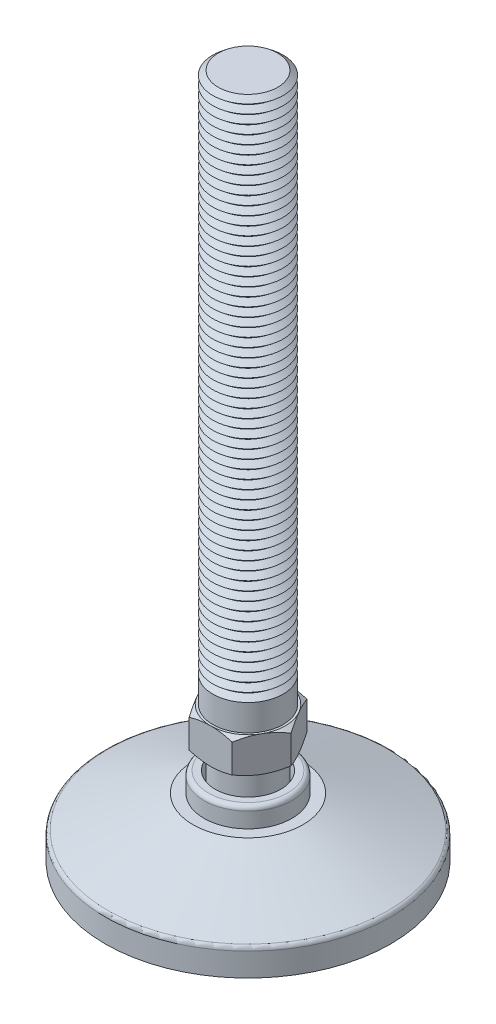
ISO-10303-21;
HEADER;
FILE_DESCRIPTION(('STEP AP214'),'2;1');
FILE_NAME('part.step','',(''),(''),'','','');
FILE_SCHEMA(('AUTOMOTIVE_DESIGN { 1 0 10303 214 1 1 1 1 }'));
ENDSEC;
DATA;
#1=APPLICATION_CONTEXT('core data for automotive mechanical design processes');
#2=APPLICATION_PROTOCOL_DEFINITION('international standard','automotive_design',2000,#1);
#3=PRODUCT_CONTEXT('',#1,'mechanical');
#4=PRODUCT('Part','Part','',(#3));
#5=PRODUCT_RELATED_PRODUCT_CATEGORY('part','',(#4));
#6=PRODUCT_DEFINITION_FORMATION('','',#4);
#7=PRODUCT_DEFINITION_CONTEXT('part definition',#1,'design');
#8=PRODUCT_DEFINITION('design','',#6,#7);
#9=PRODUCT_DEFINITION_SHAPE('','',#8);
#10=(LENGTH_UNIT() NAMED_UNIT(*) SI_UNIT(.MILLI.,.METRE.));
#11=(NAMED_UNIT(*) PLANE_ANGLE_UNIT() SI_UNIT($,.RADIAN.));
#12=(NAMED_UNIT(*) SI_UNIT($,.STERADIAN.) SOLID_ANGLE_UNIT());
#13=UNCERTAINTY_MEASURE_WITH_UNIT(LENGTH_MEASURE(1.E-05),#10,'distance_accuracy_value','');
#14=(GEOMETRIC_REPRESENTATION_CONTEXT(3) GLOBAL_UNCERTAINTY_ASSIGNED_CONTEXT((#13)) GLOBAL_UNIT_ASSIGNED_CONTEXT((#10,
#11,#12)) REPRESENTATION_CONTEXT('',''));
#15=CARTESIAN_POINT('',(0.,0.,0.));
#16=DIRECTION('',(0.,0.,1.));
#17=DIRECTION('',(1.,0.,0.));
#18=AXIS2_PLACEMENT_3D('',#15,#16,#17);
#19=CARTESIAN_POINT('',(0.,3.,0.));
#20=DIRECTION('',(0.,-1.,0.));
#21=DIRECTION('',(0.,0.,-1.));
#22=AXIS2_PLACEMENT_3D('',#19,#20,#21);
#23=CYLINDRICAL_SURFACE('',#22,29.5);
#24=CARTESIAN_POINT('',(0.,3.,0.));
#25=DIRECTION('',(0.,1.,0.));
#26=DIRECTION('',(0.,0.,1.));
#27=AXIS2_PLACEMENT_3D('',#24,#25,#26);
#28=CIRCLE('',#27,29.5);
#29=CARTESIAN_POINT('',(0.,3.,29.5));
#30=VERTEX_POINT('',#29);
#31=EDGE_CURVE('P0_E10',#30,#30,#28,.T.);
#32=ORIENTED_EDGE('',*,*,#31,.F.);
#33=EDGE_LOOP('',(#32));
#34=FACE_BOUND('',#33,.T.);
#35=CARTESIAN_POINT('',(0.,0.,0.));
#36=DIRECTION('',(0.,1.,0.));
#37=DIRECTION('',(0.,0.,1.));
#38=AXIS2_PLACEMENT_3D('',#35,#36,#37);
#39=CIRCLE('',#38,29.5);
#40=CARTESIAN_POINT('',(0.,0.,29.5));
#41=VERTEX_POINT('',#40);
#42=EDGE_CURVE('P0_E17',#41,#41,#39,.T.);
#43=ORIENTED_EDGE('',*,*,#42,.T.);
#44=EDGE_LOOP('',(#43));
#45=FACE_BOUND('',#44,.T.);
#46=ADVANCED_FACE('P0_F14',(#34,#45),#23,.T.);
#47=CARTESIAN_POINT('',(0.,3.,0.));
#48=DIRECTION('',(0.,1.,0.));
#49=DIRECTION('',(0.,0.,1.));
#50=AXIS2_PLACEMENT_3D('',#47,#48,#49);
#51=PLANE('',#50);
#52=CARTESIAN_POINT('',(0.,3.,0.));
#53=DIRECTION('',(0.,1.,0.));
#54=DIRECTION('',(0.,0.,1.));
#55=AXIS2_PLACEMENT_3D('',#52,#53,#54);
#56=CIRCLE('',#55,9.83333333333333);
#57=CARTESIAN_POINT('',(0.,3.,9.83333333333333));
#58=VERTEX_POINT('',#57);
#59=EDGE_CURVE('P0_E26',#58,#58,#56,.T.);
#60=ORIENTED_EDGE('',*,*,#59,.F.);
#61=EDGE_LOOP('',(#60));
#62=FACE_BOUND('',#61,.T.);
#63=ORIENTED_EDGE('',*,*,#31,.T.);
#64=EDGE_LOOP('',(#63));
#65=FACE_BOUND('',#64,.T.);
#66=ADVANCED_FACE('P0_F41',(#62,#65),#51,.T.);
#67=CARTESIAN_POINT('',(0.,0.,0.));
#68=DIRECTION('',(0.,1.,0.));
#69=DIRECTION('',(0.,0.,1.));
#70=AXIS2_PLACEMENT_3D('',#67,#68,#69);
#71=PLANE('',#70);
#72=ORIENTED_EDGE('',*,*,#42,.F.);
#73=EDGE_LOOP('',(#72));
#74=FACE_BOUND('',#73,.T.);
#75=ADVANCED_FACE('P0_F37',(#74),#71,.F.);
#76=CARTESIAN_POINT('',(0.,2.,0.));
#77=DIRECTION('',(0.,1.,0.));
#78=DIRECTION('',(0.,0.,1.));
#79=AXIS2_PLACEMENT_3D('',#76,#77,#78);
#80=CYLINDRICAL_SURFACE('',#79,9.83333333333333);
#81=CARTESIAN_POINT('',(0.,2.,0.));
#82=DIRECTION('',(0.,1.,0.));
#83=DIRECTION('',(0.,0.,1.));
#84=AXIS2_PLACEMENT_3D('',#81,#82,#83);
#85=CIRCLE('',#84,9.83333333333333);
#86=CARTESIAN_POINT('',(0.,2.,9.83333333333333));
#87=VERTEX_POINT('',#86);
#88=EDGE_CURVE('P0_E24',#87,#87,#85,.T.);
#89=ORIENTED_EDGE('',*,*,#88,.F.);
#90=EDGE_LOOP('',(#89));
#91=FACE_BOUND('',#90,.T.);
#92=ORIENTED_EDGE('',*,*,#59,.T.);
#93=EDGE_LOOP('',(#92));
#94=FACE_BOUND('',#93,.T.);
#95=ADVANCED_FACE('P0_F34',(#91,#94),#80,.F.);
#96=CARTESIAN_POINT('',(0.,2.,0.));
#97=DIRECTION('',(0.,1.,0.));
#98=DIRECTION('',(0.,0.,1.));
#99=AXIS2_PLACEMENT_3D('',#96,#97,#98);
#100=PLANE('',#99);
#101=ORIENTED_EDGE('',*,*,#88,.T.);
#102=EDGE_LOOP('',(#101));
#103=FACE_BOUND('',#102,.T.);
#104=ADVANCED_FACE('P0_F32',(#103),#100,.T.);
#105=CLOSED_SHELL('',(#46,#66,#75,#95,#104));
#106=MANIFOLD_SOLID_BREP('P0_B1',#105);
#107=CARTESIAN_POINT('',(0.,150.,0.));
#108=DIRECTION('',(0.,-1.,0.));
#109=DIRECTION('',(0.,0.,-1.));
#110=AXIS2_PLACEMENT_3D('',#107,#108,#109);
#111=CONICAL_SURFACE('',#110,6.75100040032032,0.895664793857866);
#112=CARTESIAN_POINT('',(0.,149.,0.));
#113=DIRECTION('',(0.,-1.,0.));
#114=DIRECTION('',(0.,0.,-1.));
#115=AXIS2_PLACEMENT_3D('',#112,#113,#114);
#116=CIRCLE('',#115,8.);
#117=CARTESIAN_POINT('',(0.,149.,-8.));
#118=VERTEX_POINT('',#117);
#119=EDGE_CURVE('P1_E2029',#118,#118,#116,.T.);
#120=ORIENTED_EDGE('',*,*,#119,.F.);
#121=EDGE_LOOP('',(#120));
#122=FACE_BOUND('',#121,.T.);
#123=CARTESIAN_POINT('',(0.,150.,0.));
#124=DIRECTION('',(0.,-1.,0.));
#125=DIRECTION('',(0.,0.,-1.));
#126=AXIS2_PLACEMENT_3D('',#123,#124,#125);
#127=CIRCLE('',#126,6.75100040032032);
#128=CARTESIAN_POINT('',(0.,150.,-6.75100040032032));
#129=VERTEX_POINT('',#128);
#130=EDGE_CURVE('P1_E2038',#129,#129,#127,.T.);
#131=ORIENTED_EDGE('',*,*,#130,.T.);
#132=EDGE_LOOP('',(#131));
#133=FACE_BOUND('',#132,.T.);
#134=ADVANCED_FACE('P1_F16',(#122,#133),#111,.T.);
#135=CARTESIAN_POINT('',(0.,151.,0.));
#136=DIRECTION('',(0.,1.,0.));
#137=DIRECTION('',(0.,0.,1.));
#138=AXIS2_PLACEMENT_3D('',#135,#136,#137);
#139=CONICAL_SURFACE('',#138,8.,0.895664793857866);
#140=ORIENTED_EDGE('',*,*,#130,.F.);
#141=EDGE_LOOP('',(#140));
#142=FACE_BOUND('',#141,.T.);
#143=CARTESIAN_POINT('',(0.,151.,0.));
#144=DIRECTION('',(0.,-1.,0.));
#145=DIRECTION('',(0.,0.,-1.));
#146=AXIS2_PLACEMENT_3D('',#143,#144,#145);
#147=CIRCLE('',#146,8.);
#148=CARTESIAN_POINT('',(0.,151.,-8.));
#149=VERTEX_POINT('',#148);
#150=EDGE_CURVE('P1_E2035',#149,#149,#147,.T.);
#151=ORIENTED_EDGE('',*,*,#150,.T.);
#152=EDGE_LOOP('',(#151));
#153=FACE_BOUND('',#152,.T.);
#154=ADVANCED_FACE('P1_F308',(#142,#153),#139,.T.);
#155=CARTESIAN_POINT('',(0.,158.,0.));
#156=DIRECTION('',(0.,1.,0.));
#157=DIRECTION('',(0.,0.,1.));
#158=AXIS2_PLACEMENT_3D('',#155,#156,#157);
#159=PLANE('',#158);
#160=CARTESIAN_POINT('',(0.,158.,0.));
#161=DIRECTION('',(0.,-1.,0.));
#162=DIRECTION('',(0.,0.,-1.));
#163=AXIS2_PLACEMENT_3D('',#160,#161,#162);
#164=CIRCLE('',#163,6.75100040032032);
#165=CARTESIAN_POINT('',(0.,158.,-6.75100040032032));
#166=VERTEX_POINT('',#165);
#167=EDGE_CURVE('P1_E143',#166,#166,#164,.T.);
#168=ORIENTED_EDGE('',*,*,#167,.F.);
#169=EDGE_LOOP('',(#168));
#170=FACE_BOUND('',#169,.T.);
#171=ADVANCED_FACE('P1_F314',(#170),#159,.T.);
#172=CARTESIAN_POINT('',(0.,158.,0.));
#173=DIRECTION('',(0.,-1.,0.));
#174=DIRECTION('',(0.,0.,-1.));
#175=AXIS2_PLACEMENT_3D('',#172,#173,#174);
#176=CONICAL_SURFACE('',#175,6.75100040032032,0.895664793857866);
#177=CARTESIAN_POINT('',(0.,157.,0.));
#178=DIRECTION('',(0.,-1.,0.));
#179=DIRECTION('',(0.,0.,-1.));
#180=AXIS2_PLACEMENT_3D('',#177,#178,#179);
#181=CIRCLE('',#180,8.);
#182=CARTESIAN_POINT('',(0.,157.,-8.));
#183=VERTEX_POINT('',#182);
#184=EDGE_CURVE('P1_E353',#183,#183,#181,.T.);
#185=ORIENTED_EDGE('',*,*,#184,.F.);
#186=EDGE_LOOP('',(#185));
#187=FACE_BOUND('',#186,.T.);
#188=ORIENTED_EDGE('',*,*,#167,.T.);
#189=EDGE_LOOP('',(#188));
#190=FACE_BOUND('',#189,.T.);
#191=ADVANCED_FACE('P1_F211',(#187,#190),#176,.T.);
#192=CARTESIAN_POINT('',(0.,157.,0.));
#193=DIRECTION('',(0.,1.,0.));
#194=DIRECTION('',(0.,0.,1.));
#195=AXIS2_PLACEMENT_3D('',#192,#193,#194);
#196=CONICAL_SURFACE('',#195,8.,0.895664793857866);
#197=CARTESIAN_POINT('',(0.,156.,0.));
#198=DIRECTION('',(0.,-1.,0.));
#199=DIRECTION('',(0.,0.,-1.));
#200=AXIS2_PLACEMENT_3D('',#197,#198,#199);
#201=CIRCLE('',#200,6.75100040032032);
#202=CARTESIAN_POINT('',(0.,156.,-6.75100040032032));
#203=VERTEX_POINT('',#202);
#204=EDGE_CURVE('P1_E352',#203,#203,#201,.T.);
#205=ORIENTED_EDGE('',*,*,#204,.F.);
#206=EDGE_LOOP('',(#205));
#207=FACE_BOUND('',#206,.T.);
#208=ORIENTED_EDGE('',*,*,#184,.T.);
#209=EDGE_LOOP('',(#208));
#210=FACE_BOUND('',#209,.T.);
#211=ADVANCED_FACE('P1_F339',(#207,#210),#196,.T.);
#212=CARTESIAN_POINT('',(0.,156.,0.));
#213=DIRECTION('',(0.,-1.,0.));
#214=DIRECTION('',(0.,0.,-1.));
#215=AXIS2_PLACEMENT_3D('',#212,#213,#214);
#216=CONICAL_SURFACE('',#215,6.75100040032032,0.895664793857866);
#217=CARTESIAN_POINT('',(0.,155.,0.));
#218=DIRECTION('',(0.,-1.,0.));
#219=DIRECTION('',(0.,0.,-1.));
#220=AXIS2_PLACEMENT_3D('',#217,#218,#219);
#221=CIRCLE('',#220,8.);
#222=CARTESIAN_POINT('',(0.,155.,-8.));
#223=VERTEX_POINT('',#222);
#224=EDGE_CURVE('P1_E349',#223,#223,#221,.T.);
#225=ORIENTED_EDGE('',*,*,#224,.F.);
#226=EDGE_LOOP('',(#225));
#227=FACE_BOUND('',#226,.T.);
#228=ORIENTED_EDGE('',*,*,#204,.T.);
#229=EDGE_LOOP('',(#228));
#230=FACE_BOUND('',#229,.T.);
#231=ADVANCED_FACE('P1_F334',(#227,#230),#216,.T.);
#232=CARTESIAN_POINT('',(0.,155.,0.));
#233=DIRECTION('',(0.,1.,0.));
#234=DIRECTION('',(0.,0.,1.));
#235=AXIS2_PLACEMENT_3D('',#232,#233,#234);
#236=CONICAL_SURFACE('',#235,8.,0.895664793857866);
#237=CARTESIAN_POINT('',(0.,154.,0.));
#238=DIRECTION('',(0.,-1.,0.));
#239=DIRECTION('',(0.,0.,-1.));
#240=AXIS2_PLACEMENT_3D('',#237,#238,#239);
#241=CIRCLE('',#240,6.75100040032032);
#242=CARTESIAN_POINT('',(0.,154.,-6.75100040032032));
#243=VERTEX_POINT('',#242);
#244=EDGE_CURVE('P1_E358',#243,#243,#241,.T.);
#245=ORIENTED_EDGE('',*,*,#244,.F.);
#246=EDGE_LOOP('',(#245));
#247=FACE_BOUND('',#246,.T.);
#248=ORIENTED_EDGE('',*,*,#224,.T.);
#249=EDGE_LOOP('',(#248));
#250=FACE_BOUND('',#249,.T.);
#251=ADVANCED_FACE('P1_F331',(#247,#250),#236,.T.);
#252=CARTESIAN_POINT('',(0.,154.,0.));
#253=DIRECTION('',(0.,-1.,0.));
#254=DIRECTION('',(0.,0.,-1.));
#255=AXIS2_PLACEMENT_3D('',#252,#253,#254);
#256=CONICAL_SURFACE('',#255,6.75100040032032,0.895664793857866);
#257=CARTESIAN_POINT('',(0.,153.,0.));
#258=DIRECTION('',(0.,-1.,0.));
#259=DIRECTION('',(0.,0.,-1.));
#260=AXIS2_PLACEMENT_3D('',#257,#258,#259);
#261=CIRCLE('',#260,8.);
#262=CARTESIAN_POINT('',(0.,153.,-8.));
#263=VERTEX_POINT('',#262);
#264=EDGE_CURVE('P1_E2041',#263,#263,#261,.T.);
#265=ORIENTED_EDGE('',*,*,#264,.F.);
#266=EDGE_LOOP('',(#265));
#267=FACE_BOUND('',#266,.T.);
#268=ORIENTED_EDGE('',*,*,#244,.T.);
#269=EDGE_LOOP('',(#268));
#270=FACE_BOUND('',#269,.T.);
#271=ADVANCED_FACE('P1_F325',(#267,#270),#256,.T.);
#272=CARTESIAN_POINT('',(0.,153.,0.));
#273=DIRECTION('',(0.,1.,0.));
#274=DIRECTION('',(0.,0.,1.));
#275=AXIS2_PLACEMENT_3D('',#272,#273,#274);
#276=CONICAL_SURFACE('',#275,8.,0.895664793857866);
#277=CARTESIAN_POINT('',(0.,152.,0.));
#278=DIRECTION('',(0.,-1.,0.));
#279=DIRECTION('',(0.,0.,-1.));
#280=AXIS2_PLACEMENT_3D('',#277,#278,#279);
#281=CIRCLE('',#280,6.75100040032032);
#282=CARTESIAN_POINT('',(0.,152.,-6.75100040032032));
#283=VERTEX_POINT('',#282);
#284=EDGE_CURVE('P1_E2044',#283,#283,#281,.T.);
#285=ORIENTED_EDGE('',*,*,#284,.F.);
#286=EDGE_LOOP('',(#285));
#287=FACE_BOUND('',#286,.T.);
#288=ORIENTED_EDGE('',*,*,#264,.T.);
#289=EDGE_LOOP('',(#288));
#290=FACE_BOUND('',#289,.T.);
#291=ADVANCED_FACE('P1_F321',(#287,#290),#276,.T.);
#292=CARTESIAN_POINT('',(0.,152.,0.));
#293=DIRECTION('',(0.,-1.,0.));
#294=DIRECTION('',(0.,0.,-1.));
#295=AXIS2_PLACEMENT_3D('',#292,#293,#294);
#296=CONICAL_SURFACE('',#295,6.75100040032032,0.895664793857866);
#297=ORIENTED_EDGE('',*,*,#150,.F.);
#298=EDGE_LOOP('',(#297));
#299=FACE_BOUND('',#298,.T.);
#300=ORIENTED_EDGE('',*,*,#284,.T.);
#301=EDGE_LOOP('',(#300));
#302=FACE_BOUND('',#301,.T.);
#303=ADVANCED_FACE('P1_F324',(#299,#302),#296,.T.);
#304=CARTESIAN_POINT('',(0.,148.,0.));
#305=DIRECTION('',(0.,-1.,0.));
#306=DIRECTION('',(0.,0.,-1.));
#307=AXIS2_PLACEMENT_3D('',#304,#305,#306);
#308=CONICAL_SURFACE('',#307,6.75100040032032,0.895664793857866);
#309=CARTESIAN_POINT('',(0.,147.,0.));
#310=DIRECTION('',(0.,-1.,0.));
#311=DIRECTION('',(0.,0.,-1.));
#312=AXIS2_PLACEMENT_3D('',#309,#310,#311);
#313=CIRCLE('',#312,8.);
#314=CARTESIAN_POINT('',(0.,147.,-8.));
#315=VERTEX_POINT('',#314);
#316=EDGE_CURVE('P1_E2023',#315,#315,#313,.T.);
#317=ORIENTED_EDGE('',*,*,#316,.F.);
#318=EDGE_LOOP('',(#317));
#319=FACE_BOUND('',#318,.T.);
#320=CARTESIAN_POINT('',(0.,148.,0.));
#321=DIRECTION('',(0.,-1.,0.));
#322=DIRECTION('',(0.,0.,-1.));
#323=AXIS2_PLACEMENT_3D('',#320,#321,#322);
#324=CIRCLE('',#323,6.75100040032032);
#325=CARTESIAN_POINT('',(0.,148.,-6.75100040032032));
#326=VERTEX_POINT('',#325);
#327=EDGE_CURVE('P1_E2032',#326,#326,#324,.T.);
#328=ORIENTED_EDGE('',*,*,#327,.T.);
#329=EDGE_LOOP('',(#328));
#330=FACE_BOUND('',#329,.T.);
#331=ADVANCED_FACE('P1_F329',(#319,#330),#308,.T.);
#332=CARTESIAN_POINT('',(0.,149.,0.));
#333=DIRECTION('',(0.,1.,0.));
#334=DIRECTION('',(0.,0.,1.));
#335=AXIS2_PLACEMENT_3D('',#332,#333,#334);
#336=CONICAL_SURFACE('',#335,8.,0.895664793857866);
#337=ORIENTED_EDGE('',*,*,#327,.F.);
#338=EDGE_LOOP('',(#337));
#339=FACE_BOUND('',#338,.T.);
#340=ORIENTED_EDGE('',*,*,#119,.T.);
#341=EDGE_LOOP('',(#340));
#342=FACE_BOUND('',#341,.T.);
#343=ADVANCED_FACE('P1_F1607',(#339,#342),#336,.T.);
#344=CARTESIAN_POINT('',(0.,146.,0.));
#345=DIRECTION('',(0.,-1.,0.));
#346=DIRECTION('',(0.,0.,-1.));
#347=AXIS2_PLACEMENT_3D('',#344,#345,#346);
#348=CONICAL_SURFACE('',#347,6.75100040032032,0.895664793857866);
#349=CARTESIAN_POINT('',(0.,145.,0.));
#350=DIRECTION('',(0.,-1.,0.));
#351=DIRECTION('',(0.,0.,-1.));
#352=AXIS2_PLACEMENT_3D('',#349,#350,#351);
#353=CIRCLE('',#352,8.);
#354=CARTESIAN_POINT('',(0.,145.,-8.));
#355=VERTEX_POINT('',#354);
#356=EDGE_CURVE('P1_E2017',#355,#355,#353,.T.);
#357=ORIENTED_EDGE('',*,*,#356,.F.);
#358=EDGE_LOOP('',(#357));
#359=FACE_BOUND('',#358,.T.);
#360=CARTESIAN_POINT('',(0.,146.,0.));
#361=DIRECTION('',(0.,-1.,0.));
#362=DIRECTION('',(0.,0.,-1.));
#363=AXIS2_PLACEMENT_3D('',#360,#361,#362);
#364=CIRCLE('',#363,6.75100040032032);
#365=CARTESIAN_POINT('',(0.,146.,-6.75100040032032));
#366=VERTEX_POINT('',#365);
#367=EDGE_CURVE('P1_E2026',#366,#366,#364,.T.);
#368=ORIENTED_EDGE('',*,*,#367,.T.);
#369=EDGE_LOOP('',(#368));
#370=FACE_BOUND('',#369,.T.);
#371=ADVANCED_FACE('P1_F1597',(#359,#370),#348,.T.);
#372=CARTESIAN_POINT('',(0.,147.,0.));
#373=DIRECTION('',(0.,1.,0.));
#374=DIRECTION('',(0.,0.,1.));
#375=AXIS2_PLACEMENT_3D('',#372,#373,#374);
#376=CONICAL_SURFACE('',#375,8.,0.895664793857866);
#377=ORIENTED_EDGE('',*,*,#367,.F.);
#378=EDGE_LOOP('',(#377));
#379=FACE_BOUND('',#378,.T.);
#380=ORIENTED_EDGE('',*,*,#316,.T.);
#381=EDGE_LOOP('',(#380));
#382=FACE_BOUND('',#381,.T.);
#383=ADVANCED_FACE('P1_F1587',(#379,#382),#376,.T.);
#384=CARTESIAN_POINT('',(0.,144.,0.));
#385=DIRECTION('',(0.,-1.,0.));
#386=DIRECTION('',(0.,0.,-1.));
#387=AXIS2_PLACEMENT_3D('',#384,#385,#386);
#388=CONICAL_SURFACE('',#387,6.75100040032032,0.895664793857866);
#389=CARTESIAN_POINT('',(0.,143.,0.));
#390=DIRECTION('',(0.,-1.,0.));
#391=DIRECTION('',(0.,0.,-1.));
#392=AXIS2_PLACEMENT_3D('',#389,#390,#391);
#393=CIRCLE('',#392,8.);
#394=CARTESIAN_POINT('',(0.,143.,-8.));
#395=VERTEX_POINT('',#394);
#396=EDGE_CURVE('P1_E2011',#395,#395,#393,.T.);
#397=ORIENTED_EDGE('',*,*,#396,.F.);
#398=EDGE_LOOP('',(#397));
#399=FACE_BOUND('',#398,.T.);
#400=CARTESIAN_POINT('',(0.,144.,0.));
#401=DIRECTION('',(0.,-1.,0.));
#402=DIRECTION('',(0.,0.,-1.));
#403=AXIS2_PLACEMENT_3D('',#400,#401,#402);
#404=CIRCLE('',#403,6.75100040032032);
#405=CARTESIAN_POINT('',(0.,144.,-6.75100040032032));
#406=VERTEX_POINT('',#405);
#407=EDGE_CURVE('P1_E2020',#406,#406,#404,.T.);
#408=ORIENTED_EDGE('',*,*,#407,.T.);
#409=EDGE_LOOP('',(#408));
#410=FACE_BOUND('',#409,.T.);
#411=ADVANCED_FACE('P1_F1577',(#399,#410),#388,.T.);
#412=CARTESIAN_POINT('',(0.,145.,0.));
#413=DIRECTION('',(0.,1.,0.));
#414=DIRECTION('',(0.,0.,1.));
#415=AXIS2_PLACEMENT_3D('',#412,#413,#414);
#416=CONICAL_SURFACE('',#415,8.,0.895664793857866);
#417=ORIENTED_EDGE('',*,*,#407,.F.);
#418=EDGE_LOOP('',(#417));
#419=FACE_BOUND('',#418,.T.);
#420=ORIENTED_EDGE('',*,*,#356,.T.);
#421=EDGE_LOOP('',(#420));
#422=FACE_BOUND('',#421,.T.);
#423=ADVANCED_FACE('P1_F1567',(#419,#422),#416,.T.);
#424=CARTESIAN_POINT('',(0.,142.,0.));
#425=DIRECTION('',(0.,-1.,0.));
#426=DIRECTION('',(0.,0.,-1.));
#427=AXIS2_PLACEMENT_3D('',#424,#425,#426);
#428=CONICAL_SURFACE('',#427,6.75100040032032,0.895664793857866);
#429=CARTESIAN_POINT('',(0.,141.,0.));
#430=DIRECTION('',(0.,-1.,0.));
#431=DIRECTION('',(0.,0.,-1.));
#432=AXIS2_PLACEMENT_3D('',#429,#430,#431);
#433=CIRCLE('',#432,8.);
#434=CARTESIAN_POINT('',(0.,141.,-8.));
#435=VERTEX_POINT('',#434);
#436=EDGE_CURVE('P1_E2005',#435,#435,#433,.T.);
#437=ORIENTED_EDGE('',*,*,#436,.F.);
#438=EDGE_LOOP('',(#437));
#439=FACE_BOUND('',#438,.T.);
#440=CARTESIAN_POINT('',(0.,142.,0.));
#441=DIRECTION('',(0.,-1.,0.));
#442=DIRECTION('',(0.,0.,-1.));
#443=AXIS2_PLACEMENT_3D('',#440,#441,#442);
#444=CIRCLE('',#443,6.75100040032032);
#445=CARTESIAN_POINT('',(0.,142.,-6.75100040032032));
#446=VERTEX_POINT('',#445);
#447=EDGE_CURVE('P1_E2014',#446,#446,#444,.T.);
#448=ORIENTED_EDGE('',*,*,#447,.T.);
#449=EDGE_LOOP('',(#448));
#450=FACE_BOUND('',#449,.T.);
#451=ADVANCED_FACE('P1_F1557',(#439,#450),#428,.T.);
#452=CARTESIAN_POINT('',(0.,143.,0.));
#453=DIRECTION('',(0.,1.,0.));
#454=DIRECTION('',(0.,0.,1.));
#455=AXIS2_PLACEMENT_3D('',#452,#453,#454);
#456=CONICAL_SURFACE('',#455,8.,0.895664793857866);
#457=ORIENTED_EDGE('',*,*,#447,.F.);
#458=EDGE_LOOP('',(#457));
#459=FACE_BOUND('',#458,.T.);
#460=ORIENTED_EDGE('',*,*,#396,.T.);
#461=EDGE_LOOP('',(#460));
#462=FACE_BOUND('',#461,.T.);
#463=ADVANCED_FACE('P1_F1547',(#459,#462),#456,.T.);
#464=CARTESIAN_POINT('',(0.,140.,0.));
#465=DIRECTION('',(0.,-1.,0.));
#466=DIRECTION('',(0.,0.,-1.));
#467=AXIS2_PLACEMENT_3D('',#464,#465,#466);
#468=CONICAL_SURFACE('',#467,6.75100040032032,0.895664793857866);
#469=CARTESIAN_POINT('',(0.,139.,0.));
#470=DIRECTION('',(0.,-1.,0.));
#471=DIRECTION('',(0.,0.,-1.));
#472=AXIS2_PLACEMENT_3D('',#469,#470,#471);
#473=CIRCLE('',#472,8.);
#474=CARTESIAN_POINT('',(0.,139.,-8.));
#475=VERTEX_POINT('',#474);
#476=EDGE_CURVE('P1_E1999',#475,#475,#473,.T.);
#477=ORIENTED_EDGE('',*,*,#476,.F.);
#478=EDGE_LOOP('',(#477));
#479=FACE_BOUND('',#478,.T.);
#480=CARTESIAN_POINT('',(0.,140.,0.));
#481=DIRECTION('',(0.,-1.,0.));
#482=DIRECTION('',(0.,0.,-1.));
#483=AXIS2_PLACEMENT_3D('',#480,#481,#482);
#484=CIRCLE('',#483,6.75100040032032);
#485=CARTESIAN_POINT('',(0.,140.,-6.75100040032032));
#486=VERTEX_POINT('',#485);
#487=EDGE_CURVE('P1_E2008',#486,#486,#484,.T.);
#488=ORIENTED_EDGE('',*,*,#487,.T.);
#489=EDGE_LOOP('',(#488));
#490=FACE_BOUND('',#489,.T.);
#491=ADVANCED_FACE('P1_F1537',(#479,#490),#468,.T.);
#492=CARTESIAN_POINT('',(0.,141.,0.));
#493=DIRECTION('',(0.,1.,0.));
#494=DIRECTION('',(0.,0.,1.));
#495=AXIS2_PLACEMENT_3D('',#492,#493,#494);
#496=CONICAL_SURFACE('',#495,8.,0.895664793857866);
#497=ORIENTED_EDGE('',*,*,#487,.F.);
#498=EDGE_LOOP('',(#497));
#499=FACE_BOUND('',#498,.T.);
#500=ORIENTED_EDGE('',*,*,#436,.T.);
#501=EDGE_LOOP('',(#500));
#502=FACE_BOUND('',#501,.T.);
#503=ADVANCED_FACE('P1_F1527',(#499,#502),#496,.T.);
#504=CARTESIAN_POINT('',(0.,138.,0.));
#505=DIRECTION('',(0.,-1.,0.));
#506=DIRECTION('',(0.,0.,-1.));
#507=AXIS2_PLACEMENT_3D('',#504,#505,#506);
#508=CONICAL_SURFACE('',#507,6.75100040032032,0.895664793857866);
#509=CARTESIAN_POINT('',(0.,137.,0.));
#510=DIRECTION('',(0.,-1.,0.));
#511=DIRECTION('',(0.,0.,-1.));
#512=AXIS2_PLACEMENT_3D('',#509,#510,#511);
#513=CIRCLE('',#512,8.);
#514=CARTESIAN_POINT('',(0.,137.,-8.));
#515=VERTEX_POINT('',#514);
#516=EDGE_CURVE('P1_E1993',#515,#515,#513,.T.);
#517=ORIENTED_EDGE('',*,*,#516,.F.);
#518=EDGE_LOOP('',(#517));
#519=FACE_BOUND('',#518,.T.);
#520=CARTESIAN_POINT('',(0.,138.,0.));
#521=DIRECTION('',(0.,-1.,0.));
#522=DIRECTION('',(0.,0.,-1.));
#523=AXIS2_PLACEMENT_3D('',#520,#521,#522);
#524=CIRCLE('',#523,6.75100040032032);
#525=CARTESIAN_POINT('',(0.,138.,-6.75100040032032));
#526=VERTEX_POINT('',#525);
#527=EDGE_CURVE('P1_E2002',#526,#526,#524,.T.);
#528=ORIENTED_EDGE('',*,*,#527,.T.);
#529=EDGE_LOOP('',(#528));
#530=FACE_BOUND('',#529,.T.);
#531=ADVANCED_FACE('P1_F1517',(#519,#530),#508,.T.);
#532=CARTESIAN_POINT('',(0.,139.,0.));
#533=DIRECTION('',(0.,1.,0.));
#534=DIRECTION('',(0.,0.,1.));
#535=AXIS2_PLACEMENT_3D('',#532,#533,#534);
#536=CONICAL_SURFACE('',#535,8.,0.895664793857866);
#537=ORIENTED_EDGE('',*,*,#527,.F.);
#538=EDGE_LOOP('',(#537));
#539=FACE_BOUND('',#538,.T.);
#540=ORIENTED_EDGE('',*,*,#476,.T.);
#541=EDGE_LOOP('',(#540));
#542=FACE_BOUND('',#541,.T.);
#543=ADVANCED_FACE('P1_F1507',(#539,#542),#536,.T.);
#544=CARTESIAN_POINT('',(0.,136.,0.));
#545=DIRECTION('',(0.,-1.,0.));
#546=DIRECTION('',(0.,0.,-1.));
#547=AXIS2_PLACEMENT_3D('',#544,#545,#546);
#548=CONICAL_SURFACE('',#547,6.75100040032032,0.895664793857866);
#549=CARTESIAN_POINT('',(0.,135.,0.));
#550=DIRECTION('',(0.,-1.,0.));
#551=DIRECTION('',(0.,0.,-1.));
#552=AXIS2_PLACEMENT_3D('',#549,#550,#551);
#553=CIRCLE('',#552,8.);
#554=CARTESIAN_POINT('',(0.,135.,-8.));
#555=VERTEX_POINT('',#554);
#556=EDGE_CURVE('P1_E1987',#555,#555,#553,.T.);
#557=ORIENTED_EDGE('',*,*,#556,.F.);
#558=EDGE_LOOP('',(#557));
#559=FACE_BOUND('',#558,.T.);
#560=CARTESIAN_POINT('',(0.,136.,0.));
#561=DIRECTION('',(0.,-1.,0.));
#562=DIRECTION('',(0.,0.,-1.));
#563=AXIS2_PLACEMENT_3D('',#560,#561,#562);
#564=CIRCLE('',#563,6.75100040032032);
#565=CARTESIAN_POINT('',(0.,136.,-6.75100040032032));
#566=VERTEX_POINT('',#565);
#567=EDGE_CURVE('P1_E1996',#566,#566,#564,.T.);
#568=ORIENTED_EDGE('',*,*,#567,.T.);
#569=EDGE_LOOP('',(#568));
#570=FACE_BOUND('',#569,.T.);
#571=ADVANCED_FACE('P1_F1497',(#559,#570),#548,.T.);
#572=CARTESIAN_POINT('',(0.,137.,0.));
#573=DIRECTION('',(0.,1.,0.));
#574=DIRECTION('',(0.,0.,1.));
#575=AXIS2_PLACEMENT_3D('',#572,#573,#574);
#576=CONICAL_SURFACE('',#575,8.,0.895664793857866);
#577=ORIENTED_EDGE('',*,*,#567,.F.);
#578=EDGE_LOOP('',(#577));
#579=FACE_BOUND('',#578,.T.);
#580=ORIENTED_EDGE('',*,*,#516,.T.);
#581=EDGE_LOOP('',(#580));
#582=FACE_BOUND('',#581,.T.);
#583=ADVANCED_FACE('P1_F1487',(#579,#582),#576,.T.);
#584=CARTESIAN_POINT('',(0.,134.,0.));
#585=DIRECTION('',(0.,-1.,0.));
#586=DIRECTION('',(0.,0.,-1.));
#587=AXIS2_PLACEMENT_3D('',#584,#585,#586);
#588=CONICAL_SURFACE('',#587,6.75100040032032,0.895664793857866);
#589=CARTESIAN_POINT('',(0.,133.,0.));
#590=DIRECTION('',(0.,-1.,0.));
#591=DIRECTION('',(0.,0.,-1.));
#592=AXIS2_PLACEMENT_3D('',#589,#590,#591);
#593=CIRCLE('',#592,8.);
#594=CARTESIAN_POINT('',(0.,133.,-8.));
#595=VERTEX_POINT('',#594);
#596=EDGE_CURVE('P1_E1981',#595,#595,#593,.T.);
#597=ORIENTED_EDGE('',*,*,#596,.F.);
#598=EDGE_LOOP('',(#597));
#599=FACE_BOUND('',#598,.T.);
#600=CARTESIAN_POINT('',(0.,134.,0.));
#601=DIRECTION('',(0.,-1.,0.));
#602=DIRECTION('',(0.,0.,-1.));
#603=AXIS2_PLACEMENT_3D('',#600,#601,#602);
#604=CIRCLE('',#603,6.75100040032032);
#605=CARTESIAN_POINT('',(0.,134.,-6.75100040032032));
#606=VERTEX_POINT('',#605);
#607=EDGE_CURVE('P1_E1990',#606,#606,#604,.T.);
#608=ORIENTED_EDGE('',*,*,#607,.T.);
#609=EDGE_LOOP('',(#608));
#610=FACE_BOUND('',#609,.T.);
#611=ADVANCED_FACE('P1_F1477',(#599,#610),#588,.T.);
#612=CARTESIAN_POINT('',(0.,135.,0.));
#613=DIRECTION('',(0.,1.,0.));
#614=DIRECTION('',(0.,0.,1.));
#615=AXIS2_PLACEMENT_3D('',#612,#613,#614);
#616=CONICAL_SURFACE('',#615,8.,0.895664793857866);
#617=ORIENTED_EDGE('',*,*,#607,.F.);
#618=EDGE_LOOP('',(#617));
#619=FACE_BOUND('',#618,.T.);
#620=ORIENTED_EDGE('',*,*,#556,.T.);
#621=EDGE_LOOP('',(#620));
#622=FACE_BOUND('',#621,.T.);
#623=ADVANCED_FACE('P1_F1467',(#619,#622),#616,.T.);
#624=CARTESIAN_POINT('',(0.,132.,0.));
#625=DIRECTION('',(0.,-1.,0.));
#626=DIRECTION('',(0.,0.,-1.));
#627=AXIS2_PLACEMENT_3D('',#624,#625,#626);
#628=CONICAL_SURFACE('',#627,6.75100040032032,0.895664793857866);
#629=CARTESIAN_POINT('',(0.,131.,0.));
#630=DIRECTION('',(0.,-1.,0.));
#631=DIRECTION('',(0.,0.,-1.));
#632=AXIS2_PLACEMENT_3D('',#629,#630,#631);
#633=CIRCLE('',#632,8.);
#634=CARTESIAN_POINT('',(0.,131.,-8.));
#635=VERTEX_POINT('',#634);
#636=EDGE_CURVE('P1_E1975',#635,#635,#633,.T.);
#637=ORIENTED_EDGE('',*,*,#636,.F.);
#638=EDGE_LOOP('',(#637));
#639=FACE_BOUND('',#638,.T.);
#640=CARTESIAN_POINT('',(0.,132.,0.));
#641=DIRECTION('',(0.,-1.,0.));
#642=DIRECTION('',(0.,0.,-1.));
#643=AXIS2_PLACEMENT_3D('',#640,#641,#642);
#644=CIRCLE('',#643,6.75100040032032);
#645=CARTESIAN_POINT('',(0.,132.,-6.75100040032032));
#646=VERTEX_POINT('',#645);
#647=EDGE_CURVE('P1_E1984',#646,#646,#644,.T.);
#648=ORIENTED_EDGE('',*,*,#647,.T.);
#649=EDGE_LOOP('',(#648));
#650=FACE_BOUND('',#649,.T.);
#651=ADVANCED_FACE('P1_F1457',(#639,#650),#628,.T.);
#652=CARTESIAN_POINT('',(0.,133.,0.));
#653=DIRECTION('',(0.,1.,0.));
#654=DIRECTION('',(0.,0.,1.));
#655=AXIS2_PLACEMENT_3D('',#652,#653,#654);
#656=CONICAL_SURFACE('',#655,8.,0.895664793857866);
#657=ORIENTED_EDGE('',*,*,#647,.F.);
#658=EDGE_LOOP('',(#657));
#659=FACE_BOUND('',#658,.T.);
#660=ORIENTED_EDGE('',*,*,#596,.T.);
#661=EDGE_LOOP('',(#660));
#662=FACE_BOUND('',#661,.T.);
#663=ADVANCED_FACE('P1_F1447',(#659,#662),#656,.T.);
#664=CARTESIAN_POINT('',(0.,130.,0.));
#665=DIRECTION('',(0.,-1.,0.));
#666=DIRECTION('',(0.,0.,-1.));
#667=AXIS2_PLACEMENT_3D('',#664,#665,#666);
#668=CONICAL_SURFACE('',#667,6.75100040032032,0.895664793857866);
#669=CARTESIAN_POINT('',(0.,129.,0.));
#670=DIRECTION('',(0.,-1.,0.));
#671=DIRECTION('',(0.,0.,-1.));
#672=AXIS2_PLACEMENT_3D('',#669,#670,#671);
#673=CIRCLE('',#672,8.);
#674=CARTESIAN_POINT('',(0.,129.,-8.));
#675=VERTEX_POINT('',#674);
#676=EDGE_CURVE('P1_E1969',#675,#675,#673,.T.);
#677=ORIENTED_EDGE('',*,*,#676,.F.);
#678=EDGE_LOOP('',(#677));
#679=FACE_BOUND('',#678,.T.);
#680=CARTESIAN_POINT('',(0.,130.,0.));
#681=DIRECTION('',(0.,-1.,0.));
#682=DIRECTION('',(0.,0.,-1.));
#683=AXIS2_PLACEMENT_3D('',#680,#681,#682);
#684=CIRCLE('',#683,6.75100040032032);
#685=CARTESIAN_POINT('',(0.,130.,-6.75100040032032));
#686=VERTEX_POINT('',#685);
#687=EDGE_CURVE('P1_E1978',#686,#686,#684,.T.);
#688=ORIENTED_EDGE('',*,*,#687,.T.);
#689=EDGE_LOOP('',(#688));
#690=FACE_BOUND('',#689,.T.);
#691=ADVANCED_FACE('P1_F1437',(#679,#690),#668,.T.);
#692=CARTESIAN_POINT('',(0.,131.,0.));
#693=DIRECTION('',(0.,1.,0.));
#694=DIRECTION('',(0.,0.,1.));
#695=AXIS2_PLACEMENT_3D('',#692,#693,#694);
#696=CONICAL_SURFACE('',#695,8.,0.895664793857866);
#697=ORIENTED_EDGE('',*,*,#687,.F.);
#698=EDGE_LOOP('',(#697));
#699=FACE_BOUND('',#698,.T.);
#700=ORIENTED_EDGE('',*,*,#636,.T.);
#701=EDGE_LOOP('',(#700));
#702=FACE_BOUND('',#701,.T.);
#703=ADVANCED_FACE('P1_F1427',(#699,#702),#696,.T.);
#704=CARTESIAN_POINT('',(0.,128.,0.));
#705=DIRECTION('',(0.,-1.,0.));
#706=DIRECTION('',(0.,0.,-1.));
#707=AXIS2_PLACEMENT_3D('',#704,#705,#706);
#708=CONICAL_SURFACE('',#707,6.75100040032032,0.895664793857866);
#709=CARTESIAN_POINT('',(0.,127.,0.));
#710=DIRECTION('',(0.,-1.,0.));
#711=DIRECTION('',(0.,0.,-1.));
#712=AXIS2_PLACEMENT_3D('',#709,#710,#711);
#713=CIRCLE('',#712,8.);
#714=CARTESIAN_POINT('',(0.,127.,-8.));
#715=VERTEX_POINT('',#714);
#716=EDGE_CURVE('P1_E1963',#715,#715,#713,.T.);
#717=ORIENTED_EDGE('',*,*,#716,.F.);
#718=EDGE_LOOP('',(#717));
#719=FACE_BOUND('',#718,.T.);
#720=CARTESIAN_POINT('',(0.,128.,0.));
#721=DIRECTION('',(0.,-1.,0.));
#722=DIRECTION('',(0.,0.,-1.));
#723=AXIS2_PLACEMENT_3D('',#720,#721,#722);
#724=CIRCLE('',#723,6.75100040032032);
#725=CARTESIAN_POINT('',(0.,128.,-6.75100040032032));
#726=VERTEX_POINT('',#725);
#727=EDGE_CURVE('P1_E1972',#726,#726,#724,.T.);
#728=ORIENTED_EDGE('',*,*,#727,.T.);
#729=EDGE_LOOP('',(#728));
#730=FACE_BOUND('',#729,.T.);
#731=ADVANCED_FACE('P1_F1417',(#719,#730),#708,.T.);
#732=CARTESIAN_POINT('',(0.,129.,0.));
#733=DIRECTION('',(0.,1.,0.));
#734=DIRECTION('',(0.,0.,1.));
#735=AXIS2_PLACEMENT_3D('',#732,#733,#734);
#736=CONICAL_SURFACE('',#735,8.,0.895664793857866);
#737=ORIENTED_EDGE('',*,*,#727,.F.);
#738=EDGE_LOOP('',(#737));
#739=FACE_BOUND('',#738,.T.);
#740=ORIENTED_EDGE('',*,*,#676,.T.);
#741=EDGE_LOOP('',(#740));
#742=FACE_BOUND('',#741,.T.);
#743=ADVANCED_FACE('P1_F1407',(#739,#742),#736,.T.);
#744=CARTESIAN_POINT('',(0.,126.,0.));
#745=DIRECTION('',(0.,-1.,0.));
#746=DIRECTION('',(0.,0.,-1.));
#747=AXIS2_PLACEMENT_3D('',#744,#745,#746);
#748=CONICAL_SURFACE('',#747,6.75100040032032,0.895664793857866);
#749=CARTESIAN_POINT('',(0.,125.,0.));
#750=DIRECTION('',(0.,-1.,0.));
#751=DIRECTION('',(0.,0.,-1.));
#752=AXIS2_PLACEMENT_3D('',#749,#750,#751);
#753=CIRCLE('',#752,8.);
#754=CARTESIAN_POINT('',(0.,125.,-8.));
#755=VERTEX_POINT('',#754);
#756=EDGE_CURVE('P1_E1957',#755,#755,#753,.T.);
#757=ORIENTED_EDGE('',*,*,#756,.F.);
#758=EDGE_LOOP('',(#757));
#759=FACE_BOUND('',#758,.T.);
#760=CARTESIAN_POINT('',(0.,126.,0.));
#761=DIRECTION('',(0.,-1.,0.));
#762=DIRECTION('',(0.,0.,-1.));
#763=AXIS2_PLACEMENT_3D('',#760,#761,#762);
#764=CIRCLE('',#763,6.75100040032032);
#765=CARTESIAN_POINT('',(0.,126.,-6.75100040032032));
#766=VERTEX_POINT('',#765);
#767=EDGE_CURVE('P1_E1966',#766,#766,#764,.T.);
#768=ORIENTED_EDGE('',*,*,#767,.T.);
#769=EDGE_LOOP('',(#768));
#770=FACE_BOUND('',#769,.T.);
#771=ADVANCED_FACE('P1_F1397',(#759,#770),#748,.T.);
#772=CARTESIAN_POINT('',(0.,127.,0.));
#773=DIRECTION('',(0.,1.,0.));
#774=DIRECTION('',(0.,0.,1.));
#775=AXIS2_PLACEMENT_3D('',#772,#773,#774);
#776=CONICAL_SURFACE('',#775,8.,0.895664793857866);
#777=ORIENTED_EDGE('',*,*,#767,.F.);
#778=EDGE_LOOP('',(#777));
#779=FACE_BOUND('',#778,.T.);
#780=ORIENTED_EDGE('',*,*,#716,.T.);
#781=EDGE_LOOP('',(#780));
#782=FACE_BOUND('',#781,.T.);
#783=ADVANCED_FACE('P1_F1387',(#779,#782),#776,.T.);
#784=CARTESIAN_POINT('',(0.,124.,0.));
#785=DIRECTION('',(0.,-1.,0.));
#786=DIRECTION('',(0.,0.,-1.));
#787=AXIS2_PLACEMENT_3D('',#784,#785,#786);
#788=CONICAL_SURFACE('',#787,6.75100040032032,0.895664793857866);
#789=CARTESIAN_POINT('',(0.,123.,0.));
#790=DIRECTION('',(0.,-1.,0.));
#791=DIRECTION('',(0.,0.,-1.));
#792=AXIS2_PLACEMENT_3D('',#789,#790,#791);
#793=CIRCLE('',#792,8.);
#794=CARTESIAN_POINT('',(0.,123.,-8.));
#795=VERTEX_POINT('',#794);
#796=EDGE_CURVE('P1_E1951',#795,#795,#793,.T.);
#797=ORIENTED_EDGE('',*,*,#796,.F.);
#798=EDGE_LOOP('',(#797));
#799=FACE_BOUND('',#798,.T.);
#800=CARTESIAN_POINT('',(0.,124.,0.));
#801=DIRECTION('',(0.,-1.,0.));
#802=DIRECTION('',(0.,0.,-1.));
#803=AXIS2_PLACEMENT_3D('',#800,#801,#802);
#804=CIRCLE('',#803,6.75100040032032);
#805=CARTESIAN_POINT('',(0.,124.,-6.75100040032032));
#806=VERTEX_POINT('',#805);
#807=EDGE_CURVE('P1_E1960',#806,#806,#804,.T.);
#808=ORIENTED_EDGE('',*,*,#807,.T.);
#809=EDGE_LOOP('',(#808));
#810=FACE_BOUND('',#809,.T.);
#811=ADVANCED_FACE('P1_F1377',(#799,#810),#788,.T.);
#812=CARTESIAN_POINT('',(0.,125.,0.));
#813=DIRECTION('',(0.,1.,0.));
#814=DIRECTION('',(0.,0.,1.));
#815=AXIS2_PLACEMENT_3D('',#812,#813,#814);
#816=CONICAL_SURFACE('',#815,8.,0.895664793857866);
#817=ORIENTED_EDGE('',*,*,#807,.F.);
#818=EDGE_LOOP('',(#817));
#819=FACE_BOUND('',#818,.T.);
#820=ORIENTED_EDGE('',*,*,#756,.T.);
#821=EDGE_LOOP('',(#820));
#822=FACE_BOUND('',#821,.T.);
#823=ADVANCED_FACE('P1_F1367',(#819,#822),#816,.T.);
#824=CARTESIAN_POINT('',(0.,122.,0.));
#825=DIRECTION('',(0.,-1.,0.));
#826=DIRECTION('',(0.,0.,-1.));
#827=AXIS2_PLACEMENT_3D('',#824,#825,#826);
#828=CONICAL_SURFACE('',#827,6.75100040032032,0.895664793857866);
#829=CARTESIAN_POINT('',(0.,121.,0.));
#830=DIRECTION('',(0.,-1.,0.));
#831=DIRECTION('',(0.,0.,-1.));
#832=AXIS2_PLACEMENT_3D('',#829,#830,#831);
#833=CIRCLE('',#832,8.);
#834=CARTESIAN_POINT('',(0.,121.,-8.));
#835=VERTEX_POINT('',#834);
#836=EDGE_CURVE('P1_E1945',#835,#835,#833,.T.);
#837=ORIENTED_EDGE('',*,*,#836,.F.);
#838=EDGE_LOOP('',(#837));
#839=FACE_BOUND('',#838,.T.);
#840=CARTESIAN_POINT('',(0.,122.,0.));
#841=DIRECTION('',(0.,-1.,0.));
#842=DIRECTION('',(0.,0.,-1.));
#843=AXIS2_PLACEMENT_3D('',#840,#841,#842);
#844=CIRCLE('',#843,6.75100040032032);
#845=CARTESIAN_POINT('',(0.,122.,-6.75100040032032));
#846=VERTEX_POINT('',#845);
#847=EDGE_CURVE('P1_E1954',#846,#846,#844,.T.);
#848=ORIENTED_EDGE('',*,*,#847,.T.);
#849=EDGE_LOOP('',(#848));
#850=FACE_BOUND('',#849,.T.);
#851=ADVANCED_FACE('P1_F1357',(#839,#850),#828,.T.);
#852=CARTESIAN_POINT('',(0.,123.,0.));
#853=DIRECTION('',(0.,1.,0.));
#854=DIRECTION('',(0.,0.,1.));
#855=AXIS2_PLACEMENT_3D('',#852,#853,#854);
#856=CONICAL_SURFACE('',#855,8.,0.895664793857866);
#857=ORIENTED_EDGE('',*,*,#847,.F.);
#858=EDGE_LOOP('',(#857));
#859=FACE_BOUND('',#858,.T.);
#860=ORIENTED_EDGE('',*,*,#796,.T.);
#861=EDGE_LOOP('',(#860));
#862=FACE_BOUND('',#861,.T.);
#863=ADVANCED_FACE('P1_F1347',(#859,#862),#856,.T.);
#864=CARTESIAN_POINT('',(0.,120.,0.));
#865=DIRECTION('',(0.,-1.,0.));
#866=DIRECTION('',(0.,0.,-1.));
#867=AXIS2_PLACEMENT_3D('',#864,#865,#866);
#868=CONICAL_SURFACE('',#867,6.75100040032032,0.895664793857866);
#869=CARTESIAN_POINT('',(0.,119.,0.));
#870=DIRECTION('',(0.,-1.,0.));
#871=DIRECTION('',(0.,0.,-1.));
#872=AXIS2_PLACEMENT_3D('',#869,#870,#871);
#873=CIRCLE('',#872,8.);
#874=CARTESIAN_POINT('',(0.,119.,-8.));
#875=VERTEX_POINT('',#874);
#876=EDGE_CURVE('P1_E1939',#875,#875,#873,.T.);
#877=ORIENTED_EDGE('',*,*,#876,.F.);
#878=EDGE_LOOP('',(#877));
#879=FACE_BOUND('',#878,.T.);
#880=CARTESIAN_POINT('',(0.,120.,0.));
#881=DIRECTION('',(0.,-1.,0.));
#882=DIRECTION('',(0.,0.,-1.));
#883=AXIS2_PLACEMENT_3D('',#880,#881,#882);
#884=CIRCLE('',#883,6.75100040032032);
#885=CARTESIAN_POINT('',(0.,120.,-6.75100040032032));
#886=VERTEX_POINT('',#885);
#887=EDGE_CURVE('P1_E1948',#886,#886,#884,.T.);
#888=ORIENTED_EDGE('',*,*,#887,.T.);
#889=EDGE_LOOP('',(#888));
#890=FACE_BOUND('',#889,.T.);
#891=ADVANCED_FACE('P1_F1337',(#879,#890),#868,.T.);
#892=CARTESIAN_POINT('',(0.,121.,0.));
#893=DIRECTION('',(0.,1.,0.));
#894=DIRECTION('',(0.,0.,1.));
#895=AXIS2_PLACEMENT_3D('',#892,#893,#894);
#896=CONICAL_SURFACE('',#895,8.,0.895664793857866);
#897=ORIENTED_EDGE('',*,*,#887,.F.);
#898=EDGE_LOOP('',(#897));
#899=FACE_BOUND('',#898,.T.);
#900=ORIENTED_EDGE('',*,*,#836,.T.);
#901=EDGE_LOOP('',(#900));
#902=FACE_BOUND('',#901,.T.);
#903=ADVANCED_FACE('P1_F1327',(#899,#902),#896,.T.);
#904=CARTESIAN_POINT('',(0.,118.,0.));
#905=DIRECTION('',(0.,-1.,0.));
#906=DIRECTION('',(0.,0.,-1.));
#907=AXIS2_PLACEMENT_3D('',#904,#905,#906);
#908=CONICAL_SURFACE('',#907,6.75100040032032,0.895664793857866);
#909=CARTESIAN_POINT('',(0.,117.,0.));
#910=DIRECTION('',(0.,-1.,0.));
#911=DIRECTION('',(0.,0.,-1.));
#912=AXIS2_PLACEMENT_3D('',#909,#910,#911);
#913=CIRCLE('',#912,8.);
#914=CARTESIAN_POINT('',(0.,117.,-8.));
#915=VERTEX_POINT('',#914);
#916=EDGE_CURVE('P1_E1933',#915,#915,#913,.T.);
#917=ORIENTED_EDGE('',*,*,#916,.F.);
#918=EDGE_LOOP('',(#917));
#919=FACE_BOUND('',#918,.T.);
#920=CARTESIAN_POINT('',(0.,118.,0.));
#921=DIRECTION('',(0.,-1.,0.));
#922=DIRECTION('',(0.,0.,-1.));
#923=AXIS2_PLACEMENT_3D('',#920,#921,#922);
#924=CIRCLE('',#923,6.75100040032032);
#925=CARTESIAN_POINT('',(0.,118.,-6.75100040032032));
#926=VERTEX_POINT('',#925);
#927=EDGE_CURVE('P1_E1942',#926,#926,#924,.T.);
#928=ORIENTED_EDGE('',*,*,#927,.T.);
#929=EDGE_LOOP('',(#928));
#930=FACE_BOUND('',#929,.T.);
#931=ADVANCED_FACE('P1_F1317',(#919,#930),#908,.T.);
#932=CARTESIAN_POINT('',(0.,119.,0.));
#933=DIRECTION('',(0.,1.,0.));
#934=DIRECTION('',(0.,0.,1.));
#935=AXIS2_PLACEMENT_3D('',#932,#933,#934);
#936=CONICAL_SURFACE('',#935,8.,0.895664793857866);
#937=ORIENTED_EDGE('',*,*,#927,.F.);
#938=EDGE_LOOP('',(#937));
#939=FACE_BOUND('',#938,.T.);
#940=ORIENTED_EDGE('',*,*,#876,.T.);
#941=EDGE_LOOP('',(#940));
#942=FACE_BOUND('',#941,.T.);
#943=ADVANCED_FACE('P1_F1307',(#939,#942),#936,.T.);
#944=CARTESIAN_POINT('',(0.,116.,0.));
#945=DIRECTION('',(0.,-1.,0.));
#946=DIRECTION('',(0.,0.,-1.));
#947=AXIS2_PLACEMENT_3D('',#944,#945,#946);
#948=CONICAL_SURFACE('',#947,6.75100040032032,0.895664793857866);
#949=CARTESIAN_POINT('',(0.,115.,0.));
#950=DIRECTION('',(0.,-1.,0.));
#951=DIRECTION('',(0.,0.,-1.));
#952=AXIS2_PLACEMENT_3D('',#949,#950,#951);
#953=CIRCLE('',#952,8.);
#954=CARTESIAN_POINT('',(0.,115.,-8.));
#955=VERTEX_POINT('',#954);
#956=EDGE_CURVE('P1_E1927',#955,#955,#953,.T.);
#957=ORIENTED_EDGE('',*,*,#956,.F.);
#958=EDGE_LOOP('',(#957));
#959=FACE_BOUND('',#958,.T.);
#960=CARTESIAN_POINT('',(0.,116.,0.));
#961=DIRECTION('',(0.,-1.,0.));
#962=DIRECTION('',(0.,0.,-1.));
#963=AXIS2_PLACEMENT_3D('',#960,#961,#962);
#964=CIRCLE('',#963,6.75100040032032);
#965=CARTESIAN_POINT('',(0.,116.,-6.75100040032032));
#966=VERTEX_POINT('',#965);
#967=EDGE_CURVE('P1_E1936',#966,#966,#964,.T.);
#968=ORIENTED_EDGE('',*,*,#967,.T.);
#969=EDGE_LOOP('',(#968));
#970=FACE_BOUND('',#969,.T.);
#971=ADVANCED_FACE('P1_F1297',(#959,#970),#948,.T.);
#972=CARTESIAN_POINT('',(0.,117.,0.));
#973=DIRECTION('',(0.,1.,0.));
#974=DIRECTION('',(0.,0.,1.));
#975=AXIS2_PLACEMENT_3D('',#972,#973,#974);
#976=CONICAL_SURFACE('',#975,8.,0.895664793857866);
#977=ORIENTED_EDGE('',*,*,#967,.F.);
#978=EDGE_LOOP('',(#977));
#979=FACE_BOUND('',#978,.T.);
#980=ORIENTED_EDGE('',*,*,#916,.T.);
#981=EDGE_LOOP('',(#980));
#982=FACE_BOUND('',#981,.T.);
#983=ADVANCED_FACE('P1_F1287',(#979,#982),#976,.T.);
#984=CARTESIAN_POINT('',(0.,114.,0.));
#985=DIRECTION('',(0.,-1.,0.));
#986=DIRECTION('',(0.,0.,-1.));
#987=AXIS2_PLACEMENT_3D('',#984,#985,#986);
#988=CONICAL_SURFACE('',#987,6.75100040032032,0.895664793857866);
#989=CARTESIAN_POINT('',(0.,113.,0.));
#990=DIRECTION('',(0.,-1.,0.));
#991=DIRECTION('',(0.,0.,-1.));
#992=AXIS2_PLACEMENT_3D('',#989,#990,#991);
#993=CIRCLE('',#992,8.);
#994=CARTESIAN_POINT('',(0.,113.,-8.));
#995=VERTEX_POINT('',#994);
#996=EDGE_CURVE('P1_E1921',#995,#995,#993,.T.);
#997=ORIENTED_EDGE('',*,*,#996,.F.);
#998=EDGE_LOOP('',(#997));
#999=FACE_BOUND('',#998,.T.);
#1000=CARTESIAN_POINT('',(0.,114.,0.));
#1001=DIRECTION('',(0.,-1.,0.));
#1002=DIRECTION('',(0.,0.,-1.));
#1003=AXIS2_PLACEMENT_3D('',#1000,#1001,#1002);
#1004=CIRCLE('',#1003,6.75100040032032);
#1005=CARTESIAN_POINT('',(0.,114.,-6.75100040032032));
#1006=VERTEX_POINT('',#1005);
#1007=EDGE_CURVE('P1_E1930',#1006,#1006,#1004,.T.);
#1008=ORIENTED_EDGE('',*,*,#1007,.T.);
#1009=EDGE_LOOP('',(#1008));
#1010=FACE_BOUND('',#1009,.T.);
#1011=ADVANCED_FACE('P1_F1277',(#999,#1010),#988,.T.);
#1012=CARTESIAN_POINT('',(0.,115.,0.));
#1013=DIRECTION('',(0.,1.,0.));
#1014=DIRECTION('',(0.,0.,1.));
#1015=AXIS2_PLACEMENT_3D('',#1012,#1013,#1014);
#1016=CONICAL_SURFACE('',#1015,8.,0.895664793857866);
#1017=ORIENTED_EDGE('',*,*,#1007,.F.);
#1018=EDGE_LOOP('',(#1017));
#1019=FACE_BOUND('',#1018,.T.);
#1020=ORIENTED_EDGE('',*,*,#956,.T.);
#1021=EDGE_LOOP('',(#1020));
#1022=FACE_BOUND('',#1021,.T.);
#1023=ADVANCED_FACE('P1_F1267',(#1019,#1022),#1016,.T.);
#1024=CARTESIAN_POINT('',(0.,112.,0.));
#1025=DIRECTION('',(0.,-1.,0.));
#1026=DIRECTION('',(0.,0.,-1.));
#1027=AXIS2_PLACEMENT_3D('',#1024,#1025,#1026);
#1028=CONICAL_SURFACE('',#1027,6.75100040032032,0.895664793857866);
#1029=CARTESIAN_POINT('',(0.,111.,0.));
#1030=DIRECTION('',(0.,-1.,0.));
#1031=DIRECTION('',(0.,0.,-1.));
#1032=AXIS2_PLACEMENT_3D('',#1029,#1030,#1031);
#1033=CIRCLE('',#1032,8.);
#1034=CARTESIAN_POINT('',(0.,111.,-8.));
#1035=VERTEX_POINT('',#1034);
#1036=EDGE_CURVE('P1_E1915',#1035,#1035,#1033,.T.);
#1037=ORIENTED_EDGE('',*,*,#1036,.F.);
#1038=EDGE_LOOP('',(#1037));
#1039=FACE_BOUND('',#1038,.T.);
#1040=CARTESIAN_POINT('',(0.,112.,0.));
#1041=DIRECTION('',(0.,-1.,0.));
#1042=DIRECTION('',(0.,0.,-1.));
#1043=AXIS2_PLACEMENT_3D('',#1040,#1041,#1042);
#1044=CIRCLE('',#1043,6.75100040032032);
#1045=CARTESIAN_POINT('',(0.,112.,-6.75100040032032));
#1046=VERTEX_POINT('',#1045);
#1047=EDGE_CURVE('P1_E1924',#1046,#1046,#1044,.T.);
#1048=ORIENTED_EDGE('',*,*,#1047,.T.);
#1049=EDGE_LOOP('',(#1048));
#1050=FACE_BOUND('',#1049,.T.);
#1051=ADVANCED_FACE('P1_F1257',(#1039,#1050),#1028,.T.);
#1052=CARTESIAN_POINT('',(0.,113.,0.));
#1053=DIRECTION('',(0.,1.,0.));
#1054=DIRECTION('',(0.,0.,1.));
#1055=AXIS2_PLACEMENT_3D('',#1052,#1053,#1054);
#1056=CONICAL_SURFACE('',#1055,8.,0.895664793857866);
#1057=ORIENTED_EDGE('',*,*,#1047,.F.);
#1058=EDGE_LOOP('',(#1057));
#1059=FACE_BOUND('',#1058,.T.);
#1060=ORIENTED_EDGE('',*,*,#996,.T.);
#1061=EDGE_LOOP('',(#1060));
#1062=FACE_BOUND('',#1061,.T.);
#1063=ADVANCED_FACE('P1_F1247',(#1059,#1062),#1056,.T.);
#1064=CARTESIAN_POINT('',(0.,110.,0.));
#1065=DIRECTION('',(0.,-1.,0.));
#1066=DIRECTION('',(0.,0.,-1.));
#1067=AXIS2_PLACEMENT_3D('',#1064,#1065,#1066);
#1068=CONICAL_SURFACE('',#1067,6.75100040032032,0.895664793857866);
#1069=CARTESIAN_POINT('',(0.,109.,0.));
#1070=DIRECTION('',(0.,-1.,0.));
#1071=DIRECTION('',(0.,0.,-1.));
#1072=AXIS2_PLACEMENT_3D('',#1069,#1070,#1071);
#1073=CIRCLE('',#1072,8.);
#1074=CARTESIAN_POINT('',(0.,109.,-8.));
#1075=VERTEX_POINT('',#1074);
#1076=EDGE_CURVE('P1_E1909',#1075,#1075,#1073,.T.);
#1077=ORIENTED_EDGE('',*,*,#1076,.F.);
#1078=EDGE_LOOP('',(#1077));
#1079=FACE_BOUND('',#1078,.T.);
#1080=CARTESIAN_POINT('',(0.,110.,0.));
#1081=DIRECTION('',(0.,-1.,0.));
#1082=DIRECTION('',(0.,0.,-1.));
#1083=AXIS2_PLACEMENT_3D('',#1080,#1081,#1082);
#1084=CIRCLE('',#1083,6.75100040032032);
#1085=CARTESIAN_POINT('',(0.,110.,-6.75100040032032));
#1086=VERTEX_POINT('',#1085);
#1087=EDGE_CURVE('P1_E1918',#1086,#1086,#1084,.T.);
#1088=ORIENTED_EDGE('',*,*,#1087,.T.);
#1089=EDGE_LOOP('',(#1088));
#1090=FACE_BOUND('',#1089,.T.);
#1091=ADVANCED_FACE('P1_F1237',(#1079,#1090),#1068,.T.);
#1092=CARTESIAN_POINT('',(0.,111.,0.));
#1093=DIRECTION('',(0.,1.,0.));
#1094=DIRECTION('',(0.,0.,1.));
#1095=AXIS2_PLACEMENT_3D('',#1092,#1093,#1094);
#1096=CONICAL_SURFACE('',#1095,8.,0.895664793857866);
#1097=ORIENTED_EDGE('',*,*,#1087,.F.);
#1098=EDGE_LOOP('',(#1097));
#1099=FACE_BOUND('',#1098,.T.);
#1100=ORIENTED_EDGE('',*,*,#1036,.T.);
#1101=EDGE_LOOP('',(#1100));
#1102=FACE_BOUND('',#1101,.T.);
#1103=ADVANCED_FACE('P1_F1227',(#1099,#1102),#1096,.T.);
#1104=CARTESIAN_POINT('',(0.,108.,0.));
#1105=DIRECTION('',(0.,-1.,0.));
#1106=DIRECTION('',(0.,0.,-1.));
#1107=AXIS2_PLACEMENT_3D('',#1104,#1105,#1106);
#1108=CONICAL_SURFACE('',#1107,6.75100040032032,0.895664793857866);
#1109=CARTESIAN_POINT('',(0.,107.,0.));
#1110=DIRECTION('',(0.,-1.,0.));
#1111=DIRECTION('',(0.,0.,-1.));
#1112=AXIS2_PLACEMENT_3D('',#1109,#1110,#1111);
#1113=CIRCLE('',#1112,8.);
#1114=CARTESIAN_POINT('',(0.,107.,-8.));
#1115=VERTEX_POINT('',#1114);
#1116=EDGE_CURVE('P1_E1903',#1115,#1115,#1113,.T.);
#1117=ORIENTED_EDGE('',*,*,#1116,.F.);
#1118=EDGE_LOOP('',(#1117));
#1119=FACE_BOUND('',#1118,.T.);
#1120=CARTESIAN_POINT('',(0.,108.,0.));
#1121=DIRECTION('',(0.,-1.,0.));
#1122=DIRECTION('',(0.,0.,-1.));
#1123=AXIS2_PLACEMENT_3D('',#1120,#1121,#1122);
#1124=CIRCLE('',#1123,6.75100040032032);
#1125=CARTESIAN_POINT('',(0.,108.,-6.75100040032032));
#1126=VERTEX_POINT('',#1125);
#1127=EDGE_CURVE('P1_E1912',#1126,#1126,#1124,.T.);
#1128=ORIENTED_EDGE('',*,*,#1127,.T.);
#1129=EDGE_LOOP('',(#1128));
#1130=FACE_BOUND('',#1129,.T.);
#1131=ADVANCED_FACE('P1_F1217',(#1119,#1130),#1108,.T.);
#1132=CARTESIAN_POINT('',(0.,109.,0.));
#1133=DIRECTION('',(0.,1.,0.));
#1134=DIRECTION('',(0.,0.,1.));
#1135=AXIS2_PLACEMENT_3D('',#1132,#1133,#1134);
#1136=CONICAL_SURFACE('',#1135,8.,0.895664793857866);
#1137=ORIENTED_EDGE('',*,*,#1127,.F.);
#1138=EDGE_LOOP('',(#1137));
#1139=FACE_BOUND('',#1138,.T.);
#1140=ORIENTED_EDGE('',*,*,#1076,.T.);
#1141=EDGE_LOOP('',(#1140));
#1142=FACE_BOUND('',#1141,.T.);
#1143=ADVANCED_FACE('P1_F1207',(#1139,#1142),#1136,.T.);
#1144=CARTESIAN_POINT('',(0.,106.,0.));
#1145=DIRECTION('',(0.,-1.,0.));
#1146=DIRECTION('',(0.,0.,-1.));
#1147=AXIS2_PLACEMENT_3D('',#1144,#1145,#1146);
#1148=CONICAL_SURFACE('',#1147,6.75100040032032,0.895664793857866);
#1149=CARTESIAN_POINT('',(0.,105.,0.));
#1150=DIRECTION('',(0.,-1.,0.));
#1151=DIRECTION('',(0.,0.,-1.));
#1152=AXIS2_PLACEMENT_3D('',#1149,#1150,#1151);
#1153=CIRCLE('',#1152,8.);
#1154=CARTESIAN_POINT('',(0.,105.,-8.));
#1155=VERTEX_POINT('',#1154);
#1156=EDGE_CURVE('P1_E1897',#1155,#1155,#1153,.T.);
#1157=ORIENTED_EDGE('',*,*,#1156,.F.);
#1158=EDGE_LOOP('',(#1157));
#1159=FACE_BOUND('',#1158,.T.);
#1160=CARTESIAN_POINT('',(0.,106.,0.));
#1161=DIRECTION('',(0.,-1.,0.));
#1162=DIRECTION('',(0.,0.,-1.));
#1163=AXIS2_PLACEMENT_3D('',#1160,#1161,#1162);
#1164=CIRCLE('',#1163,6.75100040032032);
#1165=CARTESIAN_POINT('',(0.,106.,-6.75100040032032));
#1166=VERTEX_POINT('',#1165);
#1167=EDGE_CURVE('P1_E1906',#1166,#1166,#1164,.T.);
#1168=ORIENTED_EDGE('',*,*,#1167,.T.);
#1169=EDGE_LOOP('',(#1168));
#1170=FACE_BOUND('',#1169,.T.);
#1171=ADVANCED_FACE('P1_F1197',(#1159,#1170),#1148,.T.);
#1172=CARTESIAN_POINT('',(0.,107.,0.));
#1173=DIRECTION('',(0.,1.,0.));
#1174=DIRECTION('',(0.,0.,1.));
#1175=AXIS2_PLACEMENT_3D('',#1172,#1173,#1174);
#1176=CONICAL_SURFACE('',#1175,8.,0.895664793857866);
#1177=ORIENTED_EDGE('',*,*,#1167,.F.);
#1178=EDGE_LOOP('',(#1177));
#1179=FACE_BOUND('',#1178,.T.);
#1180=ORIENTED_EDGE('',*,*,#1116,.T.);
#1181=EDGE_LOOP('',(#1180));
#1182=FACE_BOUND('',#1181,.T.);
#1183=ADVANCED_FACE('P1_F1187',(#1179,#1182),#1176,.T.);
#1184=CARTESIAN_POINT('',(0.,104.,0.));
#1185=DIRECTION('',(0.,-1.,0.));
#1186=DIRECTION('',(0.,0.,-1.));
#1187=AXIS2_PLACEMENT_3D('',#1184,#1185,#1186);
#1188=CONICAL_SURFACE('',#1187,6.75100040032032,0.895664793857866);
#1189=CARTESIAN_POINT('',(0.,103.,0.));
#1190=DIRECTION('',(0.,-1.,0.));
#1191=DIRECTION('',(0.,0.,-1.));
#1192=AXIS2_PLACEMENT_3D('',#1189,#1190,#1191);
#1193=CIRCLE('',#1192,8.);
#1194=CARTESIAN_POINT('',(0.,103.,-8.));
#1195=VERTEX_POINT('',#1194);
#1196=EDGE_CURVE('P1_E1891',#1195,#1195,#1193,.T.);
#1197=ORIENTED_EDGE('',*,*,#1196,.F.);
#1198=EDGE_LOOP('',(#1197));
#1199=FACE_BOUND('',#1198,.T.);
#1200=CARTESIAN_POINT('',(0.,104.,0.));
#1201=DIRECTION('',(0.,-1.,0.));
#1202=DIRECTION('',(0.,0.,-1.));
#1203=AXIS2_PLACEMENT_3D('',#1200,#1201,#1202);
#1204=CIRCLE('',#1203,6.75100040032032);
#1205=CARTESIAN_POINT('',(0.,104.,-6.75100040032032));
#1206=VERTEX_POINT('',#1205);
#1207=EDGE_CURVE('P1_E1900',#1206,#1206,#1204,.T.);
#1208=ORIENTED_EDGE('',*,*,#1207,.T.);
#1209=EDGE_LOOP('',(#1208));
#1210=FACE_BOUND('',#1209,.T.);
#1211=ADVANCED_FACE('P1_F1177',(#1199,#1210),#1188,.T.);
#1212=CARTESIAN_POINT('',(0.,105.,0.));
#1213=DIRECTION('',(0.,1.,0.));
#1214=DIRECTION('',(0.,0.,1.));
#1215=AXIS2_PLACEMENT_3D('',#1212,#1213,#1214);
#1216=CONICAL_SURFACE('',#1215,8.,0.895664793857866);
#1217=ORIENTED_EDGE('',*,*,#1207,.F.);
#1218=EDGE_LOOP('',(#1217));
#1219=FACE_BOUND('',#1218,.T.);
#1220=ORIENTED_EDGE('',*,*,#1156,.T.);
#1221=EDGE_LOOP('',(#1220));
#1222=FACE_BOUND('',#1221,.T.);
#1223=ADVANCED_FACE('P1_F1167',(#1219,#1222),#1216,.T.);
#1224=CARTESIAN_POINT('',(0.,102.,0.));
#1225=DIRECTION('',(0.,-1.,0.));
#1226=DIRECTION('',(0.,0.,-1.));
#1227=AXIS2_PLACEMENT_3D('',#1224,#1225,#1226);
#1228=CONICAL_SURFACE('',#1227,6.75100040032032,0.895664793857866);
#1229=CARTESIAN_POINT('',(0.,101.,0.));
#1230=DIRECTION('',(0.,-1.,0.));
#1231=DIRECTION('',(0.,0.,-1.));
#1232=AXIS2_PLACEMENT_3D('',#1229,#1230,#1231);
#1233=CIRCLE('',#1232,8.);
#1234=CARTESIAN_POINT('',(0.,101.,-8.));
#1235=VERTEX_POINT('',#1234);
#1236=EDGE_CURVE('P1_E1885',#1235,#1235,#1233,.T.);
#1237=ORIENTED_EDGE('',*,*,#1236,.F.);
#1238=EDGE_LOOP('',(#1237));
#1239=FACE_BOUND('',#1238,.T.);
#1240=CARTESIAN_POINT('',(0.,102.,0.));
#1241=DIRECTION('',(0.,-1.,0.));
#1242=DIRECTION('',(0.,0.,-1.));
#1243=AXIS2_PLACEMENT_3D('',#1240,#1241,#1242);
#1244=CIRCLE('',#1243,6.75100040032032);
#1245=CARTESIAN_POINT('',(0.,102.,-6.75100040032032));
#1246=VERTEX_POINT('',#1245);
#1247=EDGE_CURVE('P1_E1894',#1246,#1246,#1244,.T.);
#1248=ORIENTED_EDGE('',*,*,#1247,.T.);
#1249=EDGE_LOOP('',(#1248));
#1250=FACE_BOUND('',#1249,.T.);
#1251=ADVANCED_FACE('P1_F1157',(#1239,#1250),#1228,.T.);
#1252=CARTESIAN_POINT('',(0.,103.,0.));
#1253=DIRECTION('',(0.,1.,0.));
#1254=DIRECTION('',(0.,0.,1.));
#1255=AXIS2_PLACEMENT_3D('',#1252,#1253,#1254);
#1256=CONICAL_SURFACE('',#1255,8.,0.895664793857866);
#1257=ORIENTED_EDGE('',*,*,#1247,.F.);
#1258=EDGE_LOOP('',(#1257));
#1259=FACE_BOUND('',#1258,.T.);
#1260=ORIENTED_EDGE('',*,*,#1196,.T.);
#1261=EDGE_LOOP('',(#1260));
#1262=FACE_BOUND('',#1261,.T.);
#1263=ADVANCED_FACE('P1_F1147',(#1259,#1262),#1256,.T.);
#1264=CARTESIAN_POINT('',(0.,100.,0.));
#1265=DIRECTION('',(0.,-1.,0.));
#1266=DIRECTION('',(0.,0.,-1.));
#1267=AXIS2_PLACEMENT_3D('',#1264,#1265,#1266);
#1268=CONICAL_SURFACE('',#1267,6.75100040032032,0.895664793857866);
#1269=CARTESIAN_POINT('',(0.,99.,0.));
#1270=DIRECTION('',(0.,-1.,0.));
#1271=DIRECTION('',(0.,0.,-1.));
#1272=AXIS2_PLACEMENT_3D('',#1269,#1270,#1271);
#1273=CIRCLE('',#1272,8.);
#1274=CARTESIAN_POINT('',(0.,99.,-8.));
#1275=VERTEX_POINT('',#1274);
#1276=EDGE_CURVE('P1_E1879',#1275,#1275,#1273,.T.);
#1277=ORIENTED_EDGE('',*,*,#1276,.F.);
#1278=EDGE_LOOP('',(#1277));
#1279=FACE_BOUND('',#1278,.T.);
#1280=CARTESIAN_POINT('',(0.,100.,0.));
#1281=DIRECTION('',(0.,-1.,0.));
#1282=DIRECTION('',(0.,0.,-1.));
#1283=AXIS2_PLACEMENT_3D('',#1280,#1281,#1282);
#1284=CIRCLE('',#1283,6.75100040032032);
#1285=CARTESIAN_POINT('',(0.,100.,-6.75100040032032));
#1286=VERTEX_POINT('',#1285);
#1287=EDGE_CURVE('P1_E1888',#1286,#1286,#1284,.T.);
#1288=ORIENTED_EDGE('',*,*,#1287,.T.);
#1289=EDGE_LOOP('',(#1288));
#1290=FACE_BOUND('',#1289,.T.);
#1291=ADVANCED_FACE('P1_F1137',(#1279,#1290),#1268,.T.);
#1292=CARTESIAN_POINT('',(0.,101.,0.));
#1293=DIRECTION('',(0.,1.,0.));
#1294=DIRECTION('',(0.,0.,1.));
#1295=AXIS2_PLACEMENT_3D('',#1292,#1293,#1294);
#1296=CONICAL_SURFACE('',#1295,8.,0.895664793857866);
#1297=ORIENTED_EDGE('',*,*,#1287,.F.);
#1298=EDGE_LOOP('',(#1297));
#1299=FACE_BOUND('',#1298,.T.);
#1300=ORIENTED_EDGE('',*,*,#1236,.T.);
#1301=EDGE_LOOP('',(#1300));
#1302=FACE_BOUND('',#1301,.T.);
#1303=ADVANCED_FACE('P1_F1127',(#1299,#1302),#1296,.T.);
#1304=CARTESIAN_POINT('',(0.,98.,0.));
#1305=DIRECTION('',(0.,-1.,0.));
#1306=DIRECTION('',(0.,0.,-1.));
#1307=AXIS2_PLACEMENT_3D('',#1304,#1305,#1306);
#1308=CONICAL_SURFACE('',#1307,6.75100040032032,0.895664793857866);
#1309=CARTESIAN_POINT('',(0.,97.,0.));
#1310=DIRECTION('',(0.,-1.,0.));
#1311=DIRECTION('',(0.,0.,-1.));
#1312=AXIS2_PLACEMENT_3D('',#1309,#1310,#1311);
#1313=CIRCLE('',#1312,8.);
#1314=CARTESIAN_POINT('',(0.,97.,-8.));
#1315=VERTEX_POINT('',#1314);
#1316=EDGE_CURVE('P1_E1873',#1315,#1315,#1313,.T.);
#1317=ORIENTED_EDGE('',*,*,#1316,.F.);
#1318=EDGE_LOOP('',(#1317));
#1319=FACE_BOUND('',#1318,.T.);
#1320=CARTESIAN_POINT('',(0.,98.,0.));
#1321=DIRECTION('',(0.,-1.,0.));
#1322=DIRECTION('',(0.,0.,-1.));
#1323=AXIS2_PLACEMENT_3D('',#1320,#1321,#1322);
#1324=CIRCLE('',#1323,6.75100040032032);
#1325=CARTESIAN_POINT('',(0.,98.,-6.75100040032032));
#1326=VERTEX_POINT('',#1325);
#1327=EDGE_CURVE('P1_E1882',#1326,#1326,#1324,.T.);
#1328=ORIENTED_EDGE('',*,*,#1327,.T.);
#1329=EDGE_LOOP('',(#1328));
#1330=FACE_BOUND('',#1329,.T.);
#1331=ADVANCED_FACE('P1_F1117',(#1319,#1330),#1308,.T.);
#1332=CARTESIAN_POINT('',(0.,99.,0.));
#1333=DIRECTION('',(0.,1.,0.));
#1334=DIRECTION('',(0.,0.,1.));
#1335=AXIS2_PLACEMENT_3D('',#1332,#1333,#1334);
#1336=CONICAL_SURFACE('',#1335,8.,0.895664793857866);
#1337=ORIENTED_EDGE('',*,*,#1327,.F.);
#1338=EDGE_LOOP('',(#1337));
#1339=FACE_BOUND('',#1338,.T.);
#1340=ORIENTED_EDGE('',*,*,#1276,.T.);
#1341=EDGE_LOOP('',(#1340));
#1342=FACE_BOUND('',#1341,.T.);
#1343=ADVANCED_FACE('P1_F1107',(#1339,#1342),#1336,.T.);
#1344=CARTESIAN_POINT('',(0.,96.,0.));
#1345=DIRECTION('',(0.,-1.,0.));
#1346=DIRECTION('',(0.,0.,-1.));
#1347=AXIS2_PLACEMENT_3D('',#1344,#1345,#1346);
#1348=CONICAL_SURFACE('',#1347,6.75100040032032,0.895664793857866);
#1349=CARTESIAN_POINT('',(0.,95.,0.));
#1350=DIRECTION('',(0.,-1.,0.));
#1351=DIRECTION('',(0.,0.,-1.));
#1352=AXIS2_PLACEMENT_3D('',#1349,#1350,#1351);
#1353=CIRCLE('',#1352,8.);
#1354=CARTESIAN_POINT('',(0.,95.,-8.));
#1355=VERTEX_POINT('',#1354);
#1356=EDGE_CURVE('P1_E1867',#1355,#1355,#1353,.T.);
#1357=ORIENTED_EDGE('',*,*,#1356,.F.);
#1358=EDGE_LOOP('',(#1357));
#1359=FACE_BOUND('',#1358,.T.);
#1360=CARTESIAN_POINT('',(0.,96.,0.));
#1361=DIRECTION('',(0.,-1.,0.));
#1362=DIRECTION('',(0.,0.,-1.));
#1363=AXIS2_PLACEMENT_3D('',#1360,#1361,#1362);
#1364=CIRCLE('',#1363,6.75100040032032);
#1365=CARTESIAN_POINT('',(0.,96.,-6.75100040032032));
#1366=VERTEX_POINT('',#1365);
#1367=EDGE_CURVE('P1_E1876',#1366,#1366,#1364,.T.);
#1368=ORIENTED_EDGE('',*,*,#1367,.T.);
#1369=EDGE_LOOP('',(#1368));
#1370=FACE_BOUND('',#1369,.T.);
#1371=ADVANCED_FACE('P1_F1097',(#1359,#1370),#1348,.T.);
#1372=CARTESIAN_POINT('',(0.,97.,0.));
#1373=DIRECTION('',(0.,1.,0.));
#1374=DIRECTION('',(0.,0.,1.));
#1375=AXIS2_PLACEMENT_3D('',#1372,#1373,#1374);
#1376=CONICAL_SURFACE('',#1375,8.,0.895664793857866);
#1377=ORIENTED_EDGE('',*,*,#1367,.F.);
#1378=EDGE_LOOP('',(#1377));
#1379=FACE_BOUND('',#1378,.T.);
#1380=ORIENTED_EDGE('',*,*,#1316,.T.);
#1381=EDGE_LOOP('',(#1380));
#1382=FACE_BOUND('',#1381,.T.);
#1383=ADVANCED_FACE('P1_F1087',(#1379,#1382),#1376,.T.);
#1384=CARTESIAN_POINT('',(0.,94.,0.));
#1385=DIRECTION('',(0.,-1.,0.));
#1386=DIRECTION('',(0.,0.,-1.));
#1387=AXIS2_PLACEMENT_3D('',#1384,#1385,#1386);
#1388=CONICAL_SURFACE('',#1387,6.75100040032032,0.895664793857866);
#1389=CARTESIAN_POINT('',(0.,93.,0.));
#1390=DIRECTION('',(0.,-1.,0.));
#1391=DIRECTION('',(0.,0.,-1.));
#1392=AXIS2_PLACEMENT_3D('',#1389,#1390,#1391);
#1393=CIRCLE('',#1392,8.);
#1394=CARTESIAN_POINT('',(0.,93.,-8.));
#1395=VERTEX_POINT('',#1394);
#1396=EDGE_CURVE('P1_E1861',#1395,#1395,#1393,.T.);
#1397=ORIENTED_EDGE('',*,*,#1396,.F.);
#1398=EDGE_LOOP('',(#1397));
#1399=FACE_BOUND('',#1398,.T.);
#1400=CARTESIAN_POINT('',(0.,94.,0.));
#1401=DIRECTION('',(0.,-1.,0.));
#1402=DIRECTION('',(0.,0.,-1.));
#1403=AXIS2_PLACEMENT_3D('',#1400,#1401,#1402);
#1404=CIRCLE('',#1403,6.75100040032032);
#1405=CARTESIAN_POINT('',(0.,94.,-6.75100040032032));
#1406=VERTEX_POINT('',#1405);
#1407=EDGE_CURVE('P1_E1870',#1406,#1406,#1404,.T.);
#1408=ORIENTED_EDGE('',*,*,#1407,.T.);
#1409=EDGE_LOOP('',(#1408));
#1410=FACE_BOUND('',#1409,.T.);
#1411=ADVANCED_FACE('P1_F1077',(#1399,#1410),#1388,.T.);
#1412=CARTESIAN_POINT('',(0.,95.,0.));
#1413=DIRECTION('',(0.,1.,0.));
#1414=DIRECTION('',(0.,0.,1.));
#1415=AXIS2_PLACEMENT_3D('',#1412,#1413,#1414);
#1416=CONICAL_SURFACE('',#1415,8.,0.895664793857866);
#1417=ORIENTED_EDGE('',*,*,#1407,.F.);
#1418=EDGE_LOOP('',(#1417));
#1419=FACE_BOUND('',#1418,.T.);
#1420=ORIENTED_EDGE('',*,*,#1356,.T.);
#1421=EDGE_LOOP('',(#1420));
#1422=FACE_BOUND('',#1421,.T.);
#1423=ADVANCED_FACE('P1_F1067',(#1419,#1422),#1416,.T.);
#1424=CARTESIAN_POINT('',(0.,92.,0.));
#1425=DIRECTION('',(0.,-1.,0.));
#1426=DIRECTION('',(0.,0.,-1.));
#1427=AXIS2_PLACEMENT_3D('',#1424,#1425,#1426);
#1428=CONICAL_SURFACE('',#1427,6.75100040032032,0.895664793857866);
#1429=CARTESIAN_POINT('',(0.,91.,0.));
#1430=DIRECTION('',(0.,-1.,0.));
#1431=DIRECTION('',(0.,0.,-1.));
#1432=AXIS2_PLACEMENT_3D('',#1429,#1430,#1431);
#1433=CIRCLE('',#1432,8.);
#1434=CARTESIAN_POINT('',(0.,91.,-8.));
#1435=VERTEX_POINT('',#1434);
#1436=EDGE_CURVE('P1_E1855',#1435,#1435,#1433,.T.);
#1437=ORIENTED_EDGE('',*,*,#1436,.F.);
#1438=EDGE_LOOP('',(#1437));
#1439=FACE_BOUND('',#1438,.T.);
#1440=CARTESIAN_POINT('',(0.,92.,0.));
#1441=DIRECTION('',(0.,-1.,0.));
#1442=DIRECTION('',(0.,0.,-1.));
#1443=AXIS2_PLACEMENT_3D('',#1440,#1441,#1442);
#1444=CIRCLE('',#1443,6.75100040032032);
#1445=CARTESIAN_POINT('',(0.,92.,-6.75100040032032));
#1446=VERTEX_POINT('',#1445);
#1447=EDGE_CURVE('P1_E1864',#1446,#1446,#1444,.T.);
#1448=ORIENTED_EDGE('',*,*,#1447,.T.);
#1449=EDGE_LOOP('',(#1448));
#1450=FACE_BOUND('',#1449,.T.);
#1451=ADVANCED_FACE('P1_F1057',(#1439,#1450),#1428,.T.);
#1452=CARTESIAN_POINT('',(0.,93.,0.));
#1453=DIRECTION('',(0.,1.,0.));
#1454=DIRECTION('',(0.,0.,1.));
#1455=AXIS2_PLACEMENT_3D('',#1452,#1453,#1454);
#1456=CONICAL_SURFACE('',#1455,8.,0.895664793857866);
#1457=ORIENTED_EDGE('',*,*,#1447,.F.);
#1458=EDGE_LOOP('',(#1457));
#1459=FACE_BOUND('',#1458,.T.);
#1460=ORIENTED_EDGE('',*,*,#1396,.T.);
#1461=EDGE_LOOP('',(#1460));
#1462=FACE_BOUND('',#1461,.T.);
#1463=ADVANCED_FACE('P1_F1047',(#1459,#1462),#1456,.T.);
#1464=CARTESIAN_POINT('',(0.,90.,0.));
#1465=DIRECTION('',(0.,-1.,0.));
#1466=DIRECTION('',(0.,0.,-1.));
#1467=AXIS2_PLACEMENT_3D('',#1464,#1465,#1466);
#1468=CONICAL_SURFACE('',#1467,6.75100040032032,0.895664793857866);
#1469=CARTESIAN_POINT('',(0.,89.,0.));
#1470=DIRECTION('',(0.,-1.,0.));
#1471=DIRECTION('',(0.,0.,-1.));
#1472=AXIS2_PLACEMENT_3D('',#1469,#1470,#1471);
#1473=CIRCLE('',#1472,8.);
#1474=CARTESIAN_POINT('',(0.,89.,-8.));
#1475=VERTEX_POINT('',#1474);
#1476=EDGE_CURVE('P1_E1849',#1475,#1475,#1473,.T.);
#1477=ORIENTED_EDGE('',*,*,#1476,.F.);
#1478=EDGE_LOOP('',(#1477));
#1479=FACE_BOUND('',#1478,.T.);
#1480=CARTESIAN_POINT('',(0.,90.,0.));
#1481=DIRECTION('',(0.,-1.,0.));
#1482=DIRECTION('',(0.,0.,-1.));
#1483=AXIS2_PLACEMENT_3D('',#1480,#1481,#1482);
#1484=CIRCLE('',#1483,6.75100040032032);
#1485=CARTESIAN_POINT('',(0.,90.,-6.75100040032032));
#1486=VERTEX_POINT('',#1485);
#1487=EDGE_CURVE('P1_E1858',#1486,#1486,#1484,.T.);
#1488=ORIENTED_EDGE('',*,*,#1487,.T.);
#1489=EDGE_LOOP('',(#1488));
#1490=FACE_BOUND('',#1489,.T.);
#1491=ADVANCED_FACE('P1_F1037',(#1479,#1490),#1468,.T.);
#1492=CARTESIAN_POINT('',(0.,91.,0.));
#1493=DIRECTION('',(0.,1.,0.));
#1494=DIRECTION('',(0.,0.,1.));
#1495=AXIS2_PLACEMENT_3D('',#1492,#1493,#1494);
#1496=CONICAL_SURFACE('',#1495,8.,0.895664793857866);
#1497=ORIENTED_EDGE('',*,*,#1487,.F.);
#1498=EDGE_LOOP('',(#1497));
#1499=FACE_BOUND('',#1498,.T.);
#1500=ORIENTED_EDGE('',*,*,#1436,.T.);
#1501=EDGE_LOOP('',(#1500));
#1502=FACE_BOUND('',#1501,.T.);
#1503=ADVANCED_FACE('P1_F1027',(#1499,#1502),#1496,.T.);
#1504=CARTESIAN_POINT('',(0.,88.,0.));
#1505=DIRECTION('',(0.,-1.,0.));
#1506=DIRECTION('',(0.,0.,-1.));
#1507=AXIS2_PLACEMENT_3D('',#1504,#1505,#1506);
#1508=CONICAL_SURFACE('',#1507,6.75100040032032,0.895664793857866);
#1509=CARTESIAN_POINT('',(0.,87.,0.));
#1510=DIRECTION('',(0.,-1.,0.));
#1511=DIRECTION('',(0.,0.,-1.));
#1512=AXIS2_PLACEMENT_3D('',#1509,#1510,#1511);
#1513=CIRCLE('',#1512,8.);
#1514=CARTESIAN_POINT('',(0.,87.,-8.));
#1515=VERTEX_POINT('',#1514);
#1516=EDGE_CURVE('P1_E1843',#1515,#1515,#1513,.T.);
#1517=ORIENTED_EDGE('',*,*,#1516,.F.);
#1518=EDGE_LOOP('',(#1517));
#1519=FACE_BOUND('',#1518,.T.);
#1520=CARTESIAN_POINT('',(0.,88.,0.));
#1521=DIRECTION('',(0.,-1.,0.));
#1522=DIRECTION('',(0.,0.,-1.));
#1523=AXIS2_PLACEMENT_3D('',#1520,#1521,#1522);
#1524=CIRCLE('',#1523,6.75100040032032);
#1525=CARTESIAN_POINT('',(0.,88.,-6.75100040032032));
#1526=VERTEX_POINT('',#1525);
#1527=EDGE_CURVE('P1_E1852',#1526,#1526,#1524,.T.);
#1528=ORIENTED_EDGE('',*,*,#1527,.T.);
#1529=EDGE_LOOP('',(#1528));
#1530=FACE_BOUND('',#1529,.T.);
#1531=ADVANCED_FACE('P1_F1017',(#1519,#1530),#1508,.T.);
#1532=CARTESIAN_POINT('',(0.,89.,0.));
#1533=DIRECTION('',(0.,1.,0.));
#1534=DIRECTION('',(0.,0.,1.));
#1535=AXIS2_PLACEMENT_3D('',#1532,#1533,#1534);
#1536=CONICAL_SURFACE('',#1535,8.,0.895664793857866);
#1537=ORIENTED_EDGE('',*,*,#1527,.F.);
#1538=EDGE_LOOP('',(#1537));
#1539=FACE_BOUND('',#1538,.T.);
#1540=ORIENTED_EDGE('',*,*,#1476,.T.);
#1541=EDGE_LOOP('',(#1540));
#1542=FACE_BOUND('',#1541,.T.);
#1543=ADVANCED_FACE('P1_F1007',(#1539,#1542),#1536,.T.);
#1544=CARTESIAN_POINT('',(0.,86.,0.));
#1545=DIRECTION('',(0.,-1.,0.));
#1546=DIRECTION('',(0.,0.,-1.));
#1547=AXIS2_PLACEMENT_3D('',#1544,#1545,#1546);
#1548=CONICAL_SURFACE('',#1547,6.75100040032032,0.895664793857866);
#1549=CARTESIAN_POINT('',(0.,85.,0.));
#1550=DIRECTION('',(0.,-1.,0.));
#1551=DIRECTION('',(0.,0.,-1.));
#1552=AXIS2_PLACEMENT_3D('',#1549,#1550,#1551);
#1553=CIRCLE('',#1552,8.);
#1554=CARTESIAN_POINT('',(0.,85.,-8.));
#1555=VERTEX_POINT('',#1554);
#1556=EDGE_CURVE('P1_E1837',#1555,#1555,#1553,.T.);
#1557=ORIENTED_EDGE('',*,*,#1556,.F.);
#1558=EDGE_LOOP('',(#1557));
#1559=FACE_BOUND('',#1558,.T.);
#1560=CARTESIAN_POINT('',(0.,86.,0.));
#1561=DIRECTION('',(0.,-1.,0.));
#1562=DIRECTION('',(0.,0.,-1.));
#1563=AXIS2_PLACEMENT_3D('',#1560,#1561,#1562);
#1564=CIRCLE('',#1563,6.75100040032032);
#1565=CARTESIAN_POINT('',(0.,86.,-6.75100040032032));
#1566=VERTEX_POINT('',#1565);
#1567=EDGE_CURVE('P1_E1846',#1566,#1566,#1564,.T.);
#1568=ORIENTED_EDGE('',*,*,#1567,.T.);
#1569=EDGE_LOOP('',(#1568));
#1570=FACE_BOUND('',#1569,.T.);
#1571=ADVANCED_FACE('P1_F997',(#1559,#1570),#1548,.T.);
#1572=CARTESIAN_POINT('',(0.,87.,0.));
#1573=DIRECTION('',(0.,1.,0.));
#1574=DIRECTION('',(0.,0.,1.));
#1575=AXIS2_PLACEMENT_3D('',#1572,#1573,#1574);
#1576=CONICAL_SURFACE('',#1575,8.,0.895664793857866);
#1577=ORIENTED_EDGE('',*,*,#1567,.F.);
#1578=EDGE_LOOP('',(#1577));
#1579=FACE_BOUND('',#1578,.T.);
#1580=ORIENTED_EDGE('',*,*,#1516,.T.);
#1581=EDGE_LOOP('',(#1580));
#1582=FACE_BOUND('',#1581,.T.);
#1583=ADVANCED_FACE('P1_F987',(#1579,#1582),#1576,.T.);
#1584=CARTESIAN_POINT('',(0.,84.,0.));
#1585=DIRECTION('',(0.,-1.,0.));
#1586=DIRECTION('',(0.,0.,-1.));
#1587=AXIS2_PLACEMENT_3D('',#1584,#1585,#1586);
#1588=CONICAL_SURFACE('',#1587,6.75100040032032,0.895664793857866);
#1589=CARTESIAN_POINT('',(0.,83.,0.));
#1590=DIRECTION('',(0.,-1.,0.));
#1591=DIRECTION('',(0.,0.,-1.));
#1592=AXIS2_PLACEMENT_3D('',#1589,#1590,#1591);
#1593=CIRCLE('',#1592,8.);
#1594=CARTESIAN_POINT('',(0.,83.,-8.));
#1595=VERTEX_POINT('',#1594);
#1596=EDGE_CURVE('P1_E1831',#1595,#1595,#1593,.T.);
#1597=ORIENTED_EDGE('',*,*,#1596,.F.);
#1598=EDGE_LOOP('',(#1597));
#1599=FACE_BOUND('',#1598,.T.);
#1600=CARTESIAN_POINT('',(0.,84.,0.));
#1601=DIRECTION('',(0.,-1.,0.));
#1602=DIRECTION('',(0.,0.,-1.));
#1603=AXIS2_PLACEMENT_3D('',#1600,#1601,#1602);
#1604=CIRCLE('',#1603,6.75100040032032);
#1605=CARTESIAN_POINT('',(0.,84.,-6.75100040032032));
#1606=VERTEX_POINT('',#1605);
#1607=EDGE_CURVE('P1_E1840',#1606,#1606,#1604,.T.);
#1608=ORIENTED_EDGE('',*,*,#1607,.T.);
#1609=EDGE_LOOP('',(#1608));
#1610=FACE_BOUND('',#1609,.T.);
#1611=ADVANCED_FACE('P1_F977',(#1599,#1610),#1588,.T.);
#1612=CARTESIAN_POINT('',(0.,85.,0.));
#1613=DIRECTION('',(0.,1.,0.));
#1614=DIRECTION('',(0.,0.,1.));
#1615=AXIS2_PLACEMENT_3D('',#1612,#1613,#1614);
#1616=CONICAL_SURFACE('',#1615,8.,0.895664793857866);
#1617=ORIENTED_EDGE('',*,*,#1607,.F.);
#1618=EDGE_LOOP('',(#1617));
#1619=FACE_BOUND('',#1618,.T.);
#1620=ORIENTED_EDGE('',*,*,#1556,.T.);
#1621=EDGE_LOOP('',(#1620));
#1622=FACE_BOUND('',#1621,.T.);
#1623=ADVANCED_FACE('P1_F967',(#1619,#1622),#1616,.T.);
#1624=CARTESIAN_POINT('',(0.,82.,0.));
#1625=DIRECTION('',(0.,-1.,0.));
#1626=DIRECTION('',(0.,0.,-1.));
#1627=AXIS2_PLACEMENT_3D('',#1624,#1625,#1626);
#1628=CONICAL_SURFACE('',#1627,6.75100040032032,0.895664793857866);
#1629=CARTESIAN_POINT('',(0.,81.,0.));
#1630=DIRECTION('',(0.,-1.,0.));
#1631=DIRECTION('',(0.,0.,-1.));
#1632=AXIS2_PLACEMENT_3D('',#1629,#1630,#1631);
#1633=CIRCLE('',#1632,8.);
#1634=CARTESIAN_POINT('',(0.,81.,-8.));
#1635=VERTEX_POINT('',#1634);
#1636=EDGE_CURVE('P1_E1825',#1635,#1635,#1633,.T.);
#1637=ORIENTED_EDGE('',*,*,#1636,.F.);
#1638=EDGE_LOOP('',(#1637));
#1639=FACE_BOUND('',#1638,.T.);
#1640=CARTESIAN_POINT('',(0.,82.,0.));
#1641=DIRECTION('',(0.,-1.,0.));
#1642=DIRECTION('',(0.,0.,-1.));
#1643=AXIS2_PLACEMENT_3D('',#1640,#1641,#1642);
#1644=CIRCLE('',#1643,6.75100040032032);
#1645=CARTESIAN_POINT('',(0.,82.,-6.75100040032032));
#1646=VERTEX_POINT('',#1645);
#1647=EDGE_CURVE('P1_E1834',#1646,#1646,#1644,.T.);
#1648=ORIENTED_EDGE('',*,*,#1647,.T.);
#1649=EDGE_LOOP('',(#1648));
#1650=FACE_BOUND('',#1649,.T.);
#1651=ADVANCED_FACE('P1_F957',(#1639,#1650),#1628,.T.);
#1652=CARTESIAN_POINT('',(0.,83.,0.));
#1653=DIRECTION('',(0.,1.,0.));
#1654=DIRECTION('',(0.,0.,1.));
#1655=AXIS2_PLACEMENT_3D('',#1652,#1653,#1654);
#1656=CONICAL_SURFACE('',#1655,8.,0.895664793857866);
#1657=ORIENTED_EDGE('',*,*,#1647,.F.);
#1658=EDGE_LOOP('',(#1657));
#1659=FACE_BOUND('',#1658,.T.);
#1660=ORIENTED_EDGE('',*,*,#1596,.T.);
#1661=EDGE_LOOP('',(#1660));
#1662=FACE_BOUND('',#1661,.T.);
#1663=ADVANCED_FACE('P1_F947',(#1659,#1662),#1656,.T.);
#1664=CARTESIAN_POINT('',(0.,80.,0.));
#1665=DIRECTION('',(0.,-1.,0.));
#1666=DIRECTION('',(0.,0.,-1.));
#1667=AXIS2_PLACEMENT_3D('',#1664,#1665,#1666);
#1668=CONICAL_SURFACE('',#1667,6.75100040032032,0.895664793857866);
#1669=CARTESIAN_POINT('',(0.,79.,0.));
#1670=DIRECTION('',(0.,-1.,0.));
#1671=DIRECTION('',(0.,0.,-1.));
#1672=AXIS2_PLACEMENT_3D('',#1669,#1670,#1671);
#1673=CIRCLE('',#1672,8.);
#1674=CARTESIAN_POINT('',(0.,79.,-8.));
#1675=VERTEX_POINT('',#1674);
#1676=EDGE_CURVE('P1_E1819',#1675,#1675,#1673,.T.);
#1677=ORIENTED_EDGE('',*,*,#1676,.F.);
#1678=EDGE_LOOP('',(#1677));
#1679=FACE_BOUND('',#1678,.T.);
#1680=CARTESIAN_POINT('',(0.,80.,0.));
#1681=DIRECTION('',(0.,-1.,0.));
#1682=DIRECTION('',(0.,0.,-1.));
#1683=AXIS2_PLACEMENT_3D('',#1680,#1681,#1682);
#1684=CIRCLE('',#1683,6.75100040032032);
#1685=CARTESIAN_POINT('',(0.,80.,-6.75100040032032));
#1686=VERTEX_POINT('',#1685);
#1687=EDGE_CURVE('P1_E1828',#1686,#1686,#1684,.T.);
#1688=ORIENTED_EDGE('',*,*,#1687,.T.);
#1689=EDGE_LOOP('',(#1688));
#1690=FACE_BOUND('',#1689,.T.);
#1691=ADVANCED_FACE('P1_F937',(#1679,#1690),#1668,.T.);
#1692=CARTESIAN_POINT('',(0.,81.,0.));
#1693=DIRECTION('',(0.,1.,0.));
#1694=DIRECTION('',(0.,0.,1.));
#1695=AXIS2_PLACEMENT_3D('',#1692,#1693,#1694);
#1696=CONICAL_SURFACE('',#1695,8.,0.895664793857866);
#1697=ORIENTED_EDGE('',*,*,#1687,.F.);
#1698=EDGE_LOOP('',(#1697));
#1699=FACE_BOUND('',#1698,.T.);
#1700=ORIENTED_EDGE('',*,*,#1636,.T.);
#1701=EDGE_LOOP('',(#1700));
#1702=FACE_BOUND('',#1701,.T.);
#1703=ADVANCED_FACE('P1_F927',(#1699,#1702),#1696,.T.);
#1704=CARTESIAN_POINT('',(0.,78.,0.));
#1705=DIRECTION('',(0.,-1.,0.));
#1706=DIRECTION('',(0.,0.,-1.));
#1707=AXIS2_PLACEMENT_3D('',#1704,#1705,#1706);
#1708=CONICAL_SURFACE('',#1707,6.75100040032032,0.895664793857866);
#1709=CARTESIAN_POINT('',(0.,77.,0.));
#1710=DIRECTION('',(0.,-1.,0.));
#1711=DIRECTION('',(0.,0.,-1.));
#1712=AXIS2_PLACEMENT_3D('',#1709,#1710,#1711);
#1713=CIRCLE('',#1712,8.);
#1714=CARTESIAN_POINT('',(0.,77.,-8.));
#1715=VERTEX_POINT('',#1714);
#1716=EDGE_CURVE('P1_E1813',#1715,#1715,#1713,.T.);
#1717=ORIENTED_EDGE('',*,*,#1716,.F.);
#1718=EDGE_LOOP('',(#1717));
#1719=FACE_BOUND('',#1718,.T.);
#1720=CARTESIAN_POINT('',(0.,78.,0.));
#1721=DIRECTION('',(0.,-1.,0.));
#1722=DIRECTION('',(0.,0.,-1.));
#1723=AXIS2_PLACEMENT_3D('',#1720,#1721,#1722);
#1724=CIRCLE('',#1723,6.75100040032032);
#1725=CARTESIAN_POINT('',(0.,78.,-6.75100040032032));
#1726=VERTEX_POINT('',#1725);
#1727=EDGE_CURVE('P1_E1822',#1726,#1726,#1724,.T.);
#1728=ORIENTED_EDGE('',*,*,#1727,.T.);
#1729=EDGE_LOOP('',(#1728));
#1730=FACE_BOUND('',#1729,.T.);
#1731=ADVANCED_FACE('P1_F917',(#1719,#1730),#1708,.T.);
#1732=CARTESIAN_POINT('',(0.,79.,0.));
#1733=DIRECTION('',(0.,1.,0.));
#1734=DIRECTION('',(0.,0.,1.));
#1735=AXIS2_PLACEMENT_3D('',#1732,#1733,#1734);
#1736=CONICAL_SURFACE('',#1735,8.,0.895664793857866);
#1737=ORIENTED_EDGE('',*,*,#1727,.F.);
#1738=EDGE_LOOP('',(#1737));
#1739=FACE_BOUND('',#1738,.T.);
#1740=ORIENTED_EDGE('',*,*,#1676,.T.);
#1741=EDGE_LOOP('',(#1740));
#1742=FACE_BOUND('',#1741,.T.);
#1743=ADVANCED_FACE('P1_F907',(#1739,#1742),#1736,.T.);
#1744=CARTESIAN_POINT('',(0.,76.,0.));
#1745=DIRECTION('',(0.,-1.,0.));
#1746=DIRECTION('',(0.,0.,-1.));
#1747=AXIS2_PLACEMENT_3D('',#1744,#1745,#1746);
#1748=CONICAL_SURFACE('',#1747,6.75100040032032,0.895664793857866);
#1749=CARTESIAN_POINT('',(0.,75.,0.));
#1750=DIRECTION('',(0.,-1.,0.));
#1751=DIRECTION('',(0.,0.,-1.));
#1752=AXIS2_PLACEMENT_3D('',#1749,#1750,#1751);
#1753=CIRCLE('',#1752,8.);
#1754=CARTESIAN_POINT('',(0.,75.,-8.));
#1755=VERTEX_POINT('',#1754);
#1756=EDGE_CURVE('P1_E1807',#1755,#1755,#1753,.T.);
#1757=ORIENTED_EDGE('',*,*,#1756,.F.);
#1758=EDGE_LOOP('',(#1757));
#1759=FACE_BOUND('',#1758,.T.);
#1760=CARTESIAN_POINT('',(0.,76.,0.));
#1761=DIRECTION('',(0.,-1.,0.));
#1762=DIRECTION('',(0.,0.,-1.));
#1763=AXIS2_PLACEMENT_3D('',#1760,#1761,#1762);
#1764=CIRCLE('',#1763,6.75100040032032);
#1765=CARTESIAN_POINT('',(0.,76.,-6.75100040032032));
#1766=VERTEX_POINT('',#1765);
#1767=EDGE_CURVE('P1_E1816',#1766,#1766,#1764,.T.);
#1768=ORIENTED_EDGE('',*,*,#1767,.T.);
#1769=EDGE_LOOP('',(#1768));
#1770=FACE_BOUND('',#1769,.T.);
#1771=ADVANCED_FACE('P1_F897',(#1759,#1770),#1748,.T.);
#1772=CARTESIAN_POINT('',(0.,77.,0.));
#1773=DIRECTION('',(0.,1.,0.));
#1774=DIRECTION('',(0.,0.,1.));
#1775=AXIS2_PLACEMENT_3D('',#1772,#1773,#1774);
#1776=CONICAL_SURFACE('',#1775,8.,0.895664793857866);
#1777=ORIENTED_EDGE('',*,*,#1767,.F.);
#1778=EDGE_LOOP('',(#1777));
#1779=FACE_BOUND('',#1778,.T.);
#1780=ORIENTED_EDGE('',*,*,#1716,.T.);
#1781=EDGE_LOOP('',(#1780));
#1782=FACE_BOUND('',#1781,.T.);
#1783=ADVANCED_FACE('P1_F887',(#1779,#1782),#1776,.T.);
#1784=CARTESIAN_POINT('',(0.,74.,0.));
#1785=DIRECTION('',(0.,-1.,0.));
#1786=DIRECTION('',(0.,0.,-1.));
#1787=AXIS2_PLACEMENT_3D('',#1784,#1785,#1786);
#1788=CONICAL_SURFACE('',#1787,6.75100040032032,0.895664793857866);
#1789=CARTESIAN_POINT('',(0.,73.,0.));
#1790=DIRECTION('',(0.,-1.,0.));
#1791=DIRECTION('',(0.,0.,-1.));
#1792=AXIS2_PLACEMENT_3D('',#1789,#1790,#1791);
#1793=CIRCLE('',#1792,8.);
#1794=CARTESIAN_POINT('',(0.,73.,-8.));
#1795=VERTEX_POINT('',#1794);
#1796=EDGE_CURVE('P1_E1801',#1795,#1795,#1793,.T.);
#1797=ORIENTED_EDGE('',*,*,#1796,.F.);
#1798=EDGE_LOOP('',(#1797));
#1799=FACE_BOUND('',#1798,.T.);
#1800=CARTESIAN_POINT('',(0.,74.,0.));
#1801=DIRECTION('',(0.,-1.,0.));
#1802=DIRECTION('',(0.,0.,-1.));
#1803=AXIS2_PLACEMENT_3D('',#1800,#1801,#1802);
#1804=CIRCLE('',#1803,6.75100040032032);
#1805=CARTESIAN_POINT('',(0.,74.,-6.75100040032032));
#1806=VERTEX_POINT('',#1805);
#1807=EDGE_CURVE('P1_E1810',#1806,#1806,#1804,.T.);
#1808=ORIENTED_EDGE('',*,*,#1807,.T.);
#1809=EDGE_LOOP('',(#1808));
#1810=FACE_BOUND('',#1809,.T.);
#1811=ADVANCED_FACE('P1_F877',(#1799,#1810),#1788,.T.);
#1812=CARTESIAN_POINT('',(0.,75.,0.));
#1813=DIRECTION('',(0.,1.,0.));
#1814=DIRECTION('',(0.,0.,1.));
#1815=AXIS2_PLACEMENT_3D('',#1812,#1813,#1814);
#1816=CONICAL_SURFACE('',#1815,8.,0.895664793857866);
#1817=ORIENTED_EDGE('',*,*,#1807,.F.);
#1818=EDGE_LOOP('',(#1817));
#1819=FACE_BOUND('',#1818,.T.);
#1820=ORIENTED_EDGE('',*,*,#1756,.T.);
#1821=EDGE_LOOP('',(#1820));
#1822=FACE_BOUND('',#1821,.T.);
#1823=ADVANCED_FACE('P1_F867',(#1819,#1822),#1816,.T.);
#1824=CARTESIAN_POINT('',(0.,72.,0.));
#1825=DIRECTION('',(0.,-1.,0.));
#1826=DIRECTION('',(0.,0.,-1.));
#1827=AXIS2_PLACEMENT_3D('',#1824,#1825,#1826);
#1828=CONICAL_SURFACE('',#1827,6.75100040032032,0.895664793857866);
#1829=CARTESIAN_POINT('',(0.,71.,0.));
#1830=DIRECTION('',(0.,-1.,0.));
#1831=DIRECTION('',(0.,0.,-1.));
#1832=AXIS2_PLACEMENT_3D('',#1829,#1830,#1831);
#1833=CIRCLE('',#1832,8.);
#1834=CARTESIAN_POINT('',(0.,71.,-8.));
#1835=VERTEX_POINT('',#1834);
#1836=EDGE_CURVE('P1_E1795',#1835,#1835,#1833,.T.);
#1837=ORIENTED_EDGE('',*,*,#1836,.F.);
#1838=EDGE_LOOP('',(#1837));
#1839=FACE_BOUND('',#1838,.T.);
#1840=CARTESIAN_POINT('',(0.,72.,0.));
#1841=DIRECTION('',(0.,-1.,0.));
#1842=DIRECTION('',(0.,0.,-1.));
#1843=AXIS2_PLACEMENT_3D('',#1840,#1841,#1842);
#1844=CIRCLE('',#1843,6.75100040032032);
#1845=CARTESIAN_POINT('',(0.,72.,-6.75100040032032));
#1846=VERTEX_POINT('',#1845);
#1847=EDGE_CURVE('P1_E1804',#1846,#1846,#1844,.T.);
#1848=ORIENTED_EDGE('',*,*,#1847,.T.);
#1849=EDGE_LOOP('',(#1848));
#1850=FACE_BOUND('',#1849,.T.);
#1851=ADVANCED_FACE('P1_F857',(#1839,#1850),#1828,.T.);
#1852=CARTESIAN_POINT('',(0.,73.,0.));
#1853=DIRECTION('',(0.,1.,0.));
#1854=DIRECTION('',(0.,0.,1.));
#1855=AXIS2_PLACEMENT_3D('',#1852,#1853,#1854);
#1856=CONICAL_SURFACE('',#1855,8.,0.895664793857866);
#1857=ORIENTED_EDGE('',*,*,#1847,.F.);
#1858=EDGE_LOOP('',(#1857));
#1859=FACE_BOUND('',#1858,.T.);
#1860=ORIENTED_EDGE('',*,*,#1796,.T.);
#1861=EDGE_LOOP('',(#1860));
#1862=FACE_BOUND('',#1861,.T.);
#1863=ADVANCED_FACE('P1_F847',(#1859,#1862),#1856,.T.);
#1864=CARTESIAN_POINT('',(0.,70.,0.));
#1865=DIRECTION('',(0.,-1.,0.));
#1866=DIRECTION('',(0.,0.,-1.));
#1867=AXIS2_PLACEMENT_3D('',#1864,#1865,#1866);
#1868=CONICAL_SURFACE('',#1867,6.75100040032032,0.895664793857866);
#1869=CARTESIAN_POINT('',(0.,69.,0.));
#1870=DIRECTION('',(0.,-1.,0.));
#1871=DIRECTION('',(0.,0.,-1.));
#1872=AXIS2_PLACEMENT_3D('',#1869,#1870,#1871);
#1873=CIRCLE('',#1872,8.);
#1874=CARTESIAN_POINT('',(0.,69.,-8.));
#1875=VERTEX_POINT('',#1874);
#1876=EDGE_CURVE('P1_E1789',#1875,#1875,#1873,.T.);
#1877=ORIENTED_EDGE('',*,*,#1876,.F.);
#1878=EDGE_LOOP('',(#1877));
#1879=FACE_BOUND('',#1878,.T.);
#1880=CARTESIAN_POINT('',(0.,70.,0.));
#1881=DIRECTION('',(0.,-1.,0.));
#1882=DIRECTION('',(0.,0.,-1.));
#1883=AXIS2_PLACEMENT_3D('',#1880,#1881,#1882);
#1884=CIRCLE('',#1883,6.75100040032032);
#1885=CARTESIAN_POINT('',(0.,70.,-6.75100040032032));
#1886=VERTEX_POINT('',#1885);
#1887=EDGE_CURVE('P1_E1798',#1886,#1886,#1884,.T.);
#1888=ORIENTED_EDGE('',*,*,#1887,.T.);
#1889=EDGE_LOOP('',(#1888));
#1890=FACE_BOUND('',#1889,.T.);
#1891=ADVANCED_FACE('P1_F837',(#1879,#1890),#1868,.T.);
#1892=CARTESIAN_POINT('',(0.,71.,0.));
#1893=DIRECTION('',(0.,1.,0.));
#1894=DIRECTION('',(0.,0.,1.));
#1895=AXIS2_PLACEMENT_3D('',#1892,#1893,#1894);
#1896=CONICAL_SURFACE('',#1895,8.,0.895664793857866);
#1897=ORIENTED_EDGE('',*,*,#1887,.F.);
#1898=EDGE_LOOP('',(#1897));
#1899=FACE_BOUND('',#1898,.T.);
#1900=ORIENTED_EDGE('',*,*,#1836,.T.);
#1901=EDGE_LOOP('',(#1900));
#1902=FACE_BOUND('',#1901,.T.);
#1903=ADVANCED_FACE('P1_F827',(#1899,#1902),#1896,.T.);
#1904=CARTESIAN_POINT('',(0.,68.,0.));
#1905=DIRECTION('',(0.,-1.,0.));
#1906=DIRECTION('',(0.,0.,-1.));
#1907=AXIS2_PLACEMENT_3D('',#1904,#1905,#1906);
#1908=CONICAL_SURFACE('',#1907,6.75100040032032,0.895664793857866);
#1909=CARTESIAN_POINT('',(0.,67.,0.));
#1910=DIRECTION('',(0.,-1.,0.));
#1911=DIRECTION('',(0.,0.,-1.));
#1912=AXIS2_PLACEMENT_3D('',#1909,#1910,#1911);
#1913=CIRCLE('',#1912,8.);
#1914=CARTESIAN_POINT('',(0.,67.,-8.));
#1915=VERTEX_POINT('',#1914);
#1916=EDGE_CURVE('P1_E1783',#1915,#1915,#1913,.T.);
#1917=ORIENTED_EDGE('',*,*,#1916,.F.);
#1918=EDGE_LOOP('',(#1917));
#1919=FACE_BOUND('',#1918,.T.);
#1920=CARTESIAN_POINT('',(0.,68.,0.));
#1921=DIRECTION('',(0.,-1.,0.));
#1922=DIRECTION('',(0.,0.,-1.));
#1923=AXIS2_PLACEMENT_3D('',#1920,#1921,#1922);
#1924=CIRCLE('',#1923,6.75100040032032);
#1925=CARTESIAN_POINT('',(0.,68.,-6.75100040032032));
#1926=VERTEX_POINT('',#1925);
#1927=EDGE_CURVE('P1_E1792',#1926,#1926,#1924,.T.);
#1928=ORIENTED_EDGE('',*,*,#1927,.T.);
#1929=EDGE_LOOP('',(#1928));
#1930=FACE_BOUND('',#1929,.T.);
#1931=ADVANCED_FACE('P1_F817',(#1919,#1930),#1908,.T.);
#1932=CARTESIAN_POINT('',(0.,69.,0.));
#1933=DIRECTION('',(0.,1.,0.));
#1934=DIRECTION('',(0.,0.,1.));
#1935=AXIS2_PLACEMENT_3D('',#1932,#1933,#1934);
#1936=CONICAL_SURFACE('',#1935,8.,0.895664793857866);
#1937=ORIENTED_EDGE('',*,*,#1927,.F.);
#1938=EDGE_LOOP('',(#1937));
#1939=FACE_BOUND('',#1938,.T.);
#1940=ORIENTED_EDGE('',*,*,#1876,.T.);
#1941=EDGE_LOOP('',(#1940));
#1942=FACE_BOUND('',#1941,.T.);
#1943=ADVANCED_FACE('P1_F807',(#1939,#1942),#1936,.T.);
#1944=CARTESIAN_POINT('',(0.,66.,0.));
#1945=DIRECTION('',(0.,-1.,0.));
#1946=DIRECTION('',(0.,0.,-1.));
#1947=AXIS2_PLACEMENT_3D('',#1944,#1945,#1946);
#1948=CONICAL_SURFACE('',#1947,6.75100040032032,0.895664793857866);
#1949=CARTESIAN_POINT('',(0.,65.,0.));
#1950=DIRECTION('',(0.,-1.,0.));
#1951=DIRECTION('',(0.,0.,-1.));
#1952=AXIS2_PLACEMENT_3D('',#1949,#1950,#1951);
#1953=CIRCLE('',#1952,8.);
#1954=CARTESIAN_POINT('',(0.,65.,-8.));
#1955=VERTEX_POINT('',#1954);
#1956=EDGE_CURVE('P1_E1777',#1955,#1955,#1953,.T.);
#1957=ORIENTED_EDGE('',*,*,#1956,.F.);
#1958=EDGE_LOOP('',(#1957));
#1959=FACE_BOUND('',#1958,.T.);
#1960=CARTESIAN_POINT('',(0.,66.,0.));
#1961=DIRECTION('',(0.,-1.,0.));
#1962=DIRECTION('',(0.,0.,-1.));
#1963=AXIS2_PLACEMENT_3D('',#1960,#1961,#1962);
#1964=CIRCLE('',#1963,6.75100040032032);
#1965=CARTESIAN_POINT('',(0.,66.,-6.75100040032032));
#1966=VERTEX_POINT('',#1965);
#1967=EDGE_CURVE('P1_E1786',#1966,#1966,#1964,.T.);
#1968=ORIENTED_EDGE('',*,*,#1967,.T.);
#1969=EDGE_LOOP('',(#1968));
#1970=FACE_BOUND('',#1969,.T.);
#1971=ADVANCED_FACE('P1_F797',(#1959,#1970),#1948,.T.);
#1972=CARTESIAN_POINT('',(0.,67.,0.));
#1973=DIRECTION('',(0.,1.,0.));
#1974=DIRECTION('',(0.,0.,1.));
#1975=AXIS2_PLACEMENT_3D('',#1972,#1973,#1974);
#1976=CONICAL_SURFACE('',#1975,8.,0.895664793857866);
#1977=ORIENTED_EDGE('',*,*,#1967,.F.);
#1978=EDGE_LOOP('',(#1977));
#1979=FACE_BOUND('',#1978,.T.);
#1980=ORIENTED_EDGE('',*,*,#1916,.T.);
#1981=EDGE_LOOP('',(#1980));
#1982=FACE_BOUND('',#1981,.T.);
#1983=ADVANCED_FACE('P1_F787',(#1979,#1982),#1976,.T.);
#1984=CARTESIAN_POINT('',(0.,64.,0.));
#1985=DIRECTION('',(0.,-1.,0.));
#1986=DIRECTION('',(0.,0.,-1.));
#1987=AXIS2_PLACEMENT_3D('',#1984,#1985,#1986);
#1988=CONICAL_SURFACE('',#1987,6.75100040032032,0.895664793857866);
#1989=CARTESIAN_POINT('',(0.,63.,0.));
#1990=DIRECTION('',(0.,-1.,0.));
#1991=DIRECTION('',(0.,0.,-1.));
#1992=AXIS2_PLACEMENT_3D('',#1989,#1990,#1991);
#1993=CIRCLE('',#1992,8.);
#1994=CARTESIAN_POINT('',(0.,63.,-8.));
#1995=VERTEX_POINT('',#1994);
#1996=EDGE_CURVE('P1_E1771',#1995,#1995,#1993,.T.);
#1997=ORIENTED_EDGE('',*,*,#1996,.F.);
#1998=EDGE_LOOP('',(#1997));
#1999=FACE_BOUND('',#1998,.T.);
#2000=CARTESIAN_POINT('',(0.,64.,0.));
#2001=DIRECTION('',(0.,-1.,0.));
#2002=DIRECTION('',(0.,0.,-1.));
#2003=AXIS2_PLACEMENT_3D('',#2000,#2001,#2002);
#2004=CIRCLE('',#2003,6.75100040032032);
#2005=CARTESIAN_POINT('',(0.,64.,-6.75100040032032));
#2006=VERTEX_POINT('',#2005);
#2007=EDGE_CURVE('P1_E1780',#2006,#2006,#2004,.T.);
#2008=ORIENTED_EDGE('',*,*,#2007,.T.);
#2009=EDGE_LOOP('',(#2008));
#2010=FACE_BOUND('',#2009,.T.);
#2011=ADVANCED_FACE('P1_F777',(#1999,#2010),#1988,.T.);
#2012=CARTESIAN_POINT('',(0.,65.,0.));
#2013=DIRECTION('',(0.,1.,0.));
#2014=DIRECTION('',(0.,0.,1.));
#2015=AXIS2_PLACEMENT_3D('',#2012,#2013,#2014);
#2016=CONICAL_SURFACE('',#2015,8.,0.895664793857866);
#2017=ORIENTED_EDGE('',*,*,#2007,.F.);
#2018=EDGE_LOOP('',(#2017));
#2019=FACE_BOUND('',#2018,.T.);
#2020=ORIENTED_EDGE('',*,*,#1956,.T.);
#2021=EDGE_LOOP('',(#2020));
#2022=FACE_BOUND('',#2021,.T.);
#2023=ADVANCED_FACE('P1_F767',(#2019,#2022),#2016,.T.);
#2024=CARTESIAN_POINT('',(0.,62.,0.));
#2025=DIRECTION('',(0.,-1.,0.));
#2026=DIRECTION('',(0.,0.,-1.));
#2027=AXIS2_PLACEMENT_3D('',#2024,#2025,#2026);
#2028=CONICAL_SURFACE('',#2027,6.75100040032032,0.895664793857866);
#2029=CARTESIAN_POINT('',(0.,61.,0.));
#2030=DIRECTION('',(0.,-1.,0.));
#2031=DIRECTION('',(0.,0.,-1.));
#2032=AXIS2_PLACEMENT_3D('',#2029,#2030,#2031);
#2033=CIRCLE('',#2032,8.);
#2034=CARTESIAN_POINT('',(0.,61.,-8.));
#2035=VERTEX_POINT('',#2034);
#2036=EDGE_CURVE('P1_E1765',#2035,#2035,#2033,.T.);
#2037=ORIENTED_EDGE('',*,*,#2036,.F.);
#2038=EDGE_LOOP('',(#2037));
#2039=FACE_BOUND('',#2038,.T.);
#2040=CARTESIAN_POINT('',(0.,62.,0.));
#2041=DIRECTION('',(0.,-1.,0.));
#2042=DIRECTION('',(0.,0.,-1.));
#2043=AXIS2_PLACEMENT_3D('',#2040,#2041,#2042);
#2044=CIRCLE('',#2043,6.75100040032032);
#2045=CARTESIAN_POINT('',(0.,62.,-6.75100040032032));
#2046=VERTEX_POINT('',#2045);
#2047=EDGE_CURVE('P1_E1774',#2046,#2046,#2044,.T.);
#2048=ORIENTED_EDGE('',*,*,#2047,.T.);
#2049=EDGE_LOOP('',(#2048));
#2050=FACE_BOUND('',#2049,.T.);
#2051=ADVANCED_FACE('P1_F757',(#2039,#2050),#2028,.T.);
#2052=CARTESIAN_POINT('',(0.,63.,0.));
#2053=DIRECTION('',(0.,1.,0.));
#2054=DIRECTION('',(0.,0.,1.));
#2055=AXIS2_PLACEMENT_3D('',#2052,#2053,#2054);
#2056=CONICAL_SURFACE('',#2055,8.,0.895664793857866);
#2057=ORIENTED_EDGE('',*,*,#2047,.F.);
#2058=EDGE_LOOP('',(#2057));
#2059=FACE_BOUND('',#2058,.T.);
#2060=ORIENTED_EDGE('',*,*,#1996,.T.);
#2061=EDGE_LOOP('',(#2060));
#2062=FACE_BOUND('',#2061,.T.);
#2063=ADVANCED_FACE('P1_F747',(#2059,#2062),#2056,.T.);
#2064=CARTESIAN_POINT('',(0.,60.,0.));
#2065=DIRECTION('',(0.,-1.,0.));
#2066=DIRECTION('',(0.,0.,-1.));
#2067=AXIS2_PLACEMENT_3D('',#2064,#2065,#2066);
#2068=CONICAL_SURFACE('',#2067,6.75100040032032,0.895664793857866);
#2069=CARTESIAN_POINT('',(0.,59.,0.));
#2070=DIRECTION('',(0.,-1.,0.));
#2071=DIRECTION('',(0.,0.,-1.));
#2072=AXIS2_PLACEMENT_3D('',#2069,#2070,#2071);
#2073=CIRCLE('',#2072,8.);
#2074=CARTESIAN_POINT('',(0.,59.,-8.));
#2075=VERTEX_POINT('',#2074);
#2076=EDGE_CURVE('P1_E1759',#2075,#2075,#2073,.T.);
#2077=ORIENTED_EDGE('',*,*,#2076,.F.);
#2078=EDGE_LOOP('',(#2077));
#2079=FACE_BOUND('',#2078,.T.);
#2080=CARTESIAN_POINT('',(0.,60.,0.));
#2081=DIRECTION('',(0.,-1.,0.));
#2082=DIRECTION('',(0.,0.,-1.));
#2083=AXIS2_PLACEMENT_3D('',#2080,#2081,#2082);
#2084=CIRCLE('',#2083,6.75100040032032);
#2085=CARTESIAN_POINT('',(0.,60.,-6.75100040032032));
#2086=VERTEX_POINT('',#2085);
#2087=EDGE_CURVE('P1_E1768',#2086,#2086,#2084,.T.);
#2088=ORIENTED_EDGE('',*,*,#2087,.T.);
#2089=EDGE_LOOP('',(#2088));
#2090=FACE_BOUND('',#2089,.T.);
#2091=ADVANCED_FACE('P1_F737',(#2079,#2090),#2068,.T.);
#2092=CARTESIAN_POINT('',(0.,61.,0.));
#2093=DIRECTION('',(0.,1.,0.));
#2094=DIRECTION('',(0.,0.,1.));
#2095=AXIS2_PLACEMENT_3D('',#2092,#2093,#2094);
#2096=CONICAL_SURFACE('',#2095,8.,0.895664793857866);
#2097=ORIENTED_EDGE('',*,*,#2087,.F.);
#2098=EDGE_LOOP('',(#2097));
#2099=FACE_BOUND('',#2098,.T.);
#2100=ORIENTED_EDGE('',*,*,#2036,.T.);
#2101=EDGE_LOOP('',(#2100));
#2102=FACE_BOUND('',#2101,.T.);
#2103=ADVANCED_FACE('P1_F727',(#2099,#2102),#2096,.T.);
#2104=CARTESIAN_POINT('',(0.,58.,0.));
#2105=DIRECTION('',(0.,-1.,0.));
#2106=DIRECTION('',(0.,0.,-1.));
#2107=AXIS2_PLACEMENT_3D('',#2104,#2105,#2106);
#2108=CONICAL_SURFACE('',#2107,6.75100040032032,0.895664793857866);
#2109=CARTESIAN_POINT('',(0.,57.,0.));
#2110=DIRECTION('',(0.,-1.,0.));
#2111=DIRECTION('',(0.,0.,-1.));
#2112=AXIS2_PLACEMENT_3D('',#2109,#2110,#2111);
#2113=CIRCLE('',#2112,8.);
#2114=CARTESIAN_POINT('',(0.,57.,-8.));
#2115=VERTEX_POINT('',#2114);
#2116=EDGE_CURVE('P1_E1753',#2115,#2115,#2113,.T.);
#2117=ORIENTED_EDGE('',*,*,#2116,.F.);
#2118=EDGE_LOOP('',(#2117));
#2119=FACE_BOUND('',#2118,.T.);
#2120=CARTESIAN_POINT('',(0.,58.,0.));
#2121=DIRECTION('',(0.,-1.,0.));
#2122=DIRECTION('',(0.,0.,-1.));
#2123=AXIS2_PLACEMENT_3D('',#2120,#2121,#2122);
#2124=CIRCLE('',#2123,6.75100040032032);
#2125=CARTESIAN_POINT('',(0.,58.,-6.75100040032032));
#2126=VERTEX_POINT('',#2125);
#2127=EDGE_CURVE('P1_E1762',#2126,#2126,#2124,.T.);
#2128=ORIENTED_EDGE('',*,*,#2127,.T.);
#2129=EDGE_LOOP('',(#2128));
#2130=FACE_BOUND('',#2129,.T.);
#2131=ADVANCED_FACE('P1_F717',(#2119,#2130),#2108,.T.);
#2132=CARTESIAN_POINT('',(0.,59.,0.));
#2133=DIRECTION('',(0.,1.,0.));
#2134=DIRECTION('',(0.,0.,1.));
#2135=AXIS2_PLACEMENT_3D('',#2132,#2133,#2134);
#2136=CONICAL_SURFACE('',#2135,8.,0.895664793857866);
#2137=ORIENTED_EDGE('',*,*,#2127,.F.);
#2138=EDGE_LOOP('',(#2137));
#2139=FACE_BOUND('',#2138,.T.);
#2140=ORIENTED_EDGE('',*,*,#2076,.T.);
#2141=EDGE_LOOP('',(#2140));
#2142=FACE_BOUND('',#2141,.T.);
#2143=ADVANCED_FACE('P1_F707',(#2139,#2142),#2136,.T.);
#2144=CARTESIAN_POINT('',(0.,56.,0.));
#2145=DIRECTION('',(0.,-1.,0.));
#2146=DIRECTION('',(0.,0.,-1.));
#2147=AXIS2_PLACEMENT_3D('',#2144,#2145,#2146);
#2148=CONICAL_SURFACE('',#2147,6.75100040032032,0.895664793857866);
#2149=CARTESIAN_POINT('',(0.,55.,0.));
#2150=DIRECTION('',(0.,-1.,0.));
#2151=DIRECTION('',(0.,0.,-1.));
#2152=AXIS2_PLACEMENT_3D('',#2149,#2150,#2151);
#2153=CIRCLE('',#2152,8.);
#2154=CARTESIAN_POINT('',(0.,55.,-8.));
#2155=VERTEX_POINT('',#2154);
#2156=EDGE_CURVE('P1_E1747',#2155,#2155,#2153,.T.);
#2157=ORIENTED_EDGE('',*,*,#2156,.F.);
#2158=EDGE_LOOP('',(#2157));
#2159=FACE_BOUND('',#2158,.T.);
#2160=CARTESIAN_POINT('',(0.,56.,0.));
#2161=DIRECTION('',(0.,-1.,0.));
#2162=DIRECTION('',(0.,0.,-1.));
#2163=AXIS2_PLACEMENT_3D('',#2160,#2161,#2162);
#2164=CIRCLE('',#2163,6.75100040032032);
#2165=CARTESIAN_POINT('',(0.,56.,-6.75100040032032));
#2166=VERTEX_POINT('',#2165);
#2167=EDGE_CURVE('P1_E1756',#2166,#2166,#2164,.T.);
#2168=ORIENTED_EDGE('',*,*,#2167,.T.);
#2169=EDGE_LOOP('',(#2168));
#2170=FACE_BOUND('',#2169,.T.);
#2171=ADVANCED_FACE('P1_F697',(#2159,#2170),#2148,.T.);
#2172=CARTESIAN_POINT('',(0.,57.,0.));
#2173=DIRECTION('',(0.,1.,0.));
#2174=DIRECTION('',(0.,0.,1.));
#2175=AXIS2_PLACEMENT_3D('',#2172,#2173,#2174);
#2176=CONICAL_SURFACE('',#2175,8.,0.895664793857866);
#2177=ORIENTED_EDGE('',*,*,#2167,.F.);
#2178=EDGE_LOOP('',(#2177));
#2179=FACE_BOUND('',#2178,.T.);
#2180=ORIENTED_EDGE('',*,*,#2116,.T.);
#2181=EDGE_LOOP('',(#2180));
#2182=FACE_BOUND('',#2181,.T.);
#2183=ADVANCED_FACE('P1_F687',(#2179,#2182),#2176,.T.);
#2184=CARTESIAN_POINT('',(0.,54.,0.));
#2185=DIRECTION('',(0.,-1.,0.));
#2186=DIRECTION('',(0.,0.,-1.));
#2187=AXIS2_PLACEMENT_3D('',#2184,#2185,#2186);
#2188=CONICAL_SURFACE('',#2187,6.75100040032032,0.895664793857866);
#2189=CARTESIAN_POINT('',(0.,53.,0.));
#2190=DIRECTION('',(0.,-1.,0.));
#2191=DIRECTION('',(0.,0.,-1.));
#2192=AXIS2_PLACEMENT_3D('',#2189,#2190,#2191);
#2193=CIRCLE('',#2192,8.);
#2194=CARTESIAN_POINT('',(0.,53.,-8.));
#2195=VERTEX_POINT('',#2194);
#2196=EDGE_CURVE('P1_E1741',#2195,#2195,#2193,.T.);
#2197=ORIENTED_EDGE('',*,*,#2196,.F.);
#2198=EDGE_LOOP('',(#2197));
#2199=FACE_BOUND('',#2198,.T.);
#2200=CARTESIAN_POINT('',(0.,54.,0.));
#2201=DIRECTION('',(0.,-1.,0.));
#2202=DIRECTION('',(0.,0.,-1.));
#2203=AXIS2_PLACEMENT_3D('',#2200,#2201,#2202);
#2204=CIRCLE('',#2203,6.75100040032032);
#2205=CARTESIAN_POINT('',(0.,54.,-6.75100040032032));
#2206=VERTEX_POINT('',#2205);
#2207=EDGE_CURVE('P1_E1750',#2206,#2206,#2204,.T.);
#2208=ORIENTED_EDGE('',*,*,#2207,.T.);
#2209=EDGE_LOOP('',(#2208));
#2210=FACE_BOUND('',#2209,.T.);
#2211=ADVANCED_FACE('P1_F677',(#2199,#2210),#2188,.T.);
#2212=CARTESIAN_POINT('',(0.,55.,0.));
#2213=DIRECTION('',(0.,1.,0.));
#2214=DIRECTION('',(0.,0.,1.));
#2215=AXIS2_PLACEMENT_3D('',#2212,#2213,#2214);
#2216=CONICAL_SURFACE('',#2215,8.,0.895664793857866);
#2217=ORIENTED_EDGE('',*,*,#2207,.F.);
#2218=EDGE_LOOP('',(#2217));
#2219=FACE_BOUND('',#2218,.T.);
#2220=ORIENTED_EDGE('',*,*,#2156,.T.);
#2221=EDGE_LOOP('',(#2220));
#2222=FACE_BOUND('',#2221,.T.);
#2223=ADVANCED_FACE('P1_F667',(#2219,#2222),#2216,.T.);
#2224=CARTESIAN_POINT('',(0.,52.,0.));
#2225=DIRECTION('',(0.,-1.,0.));
#2226=DIRECTION('',(0.,0.,-1.));
#2227=AXIS2_PLACEMENT_3D('',#2224,#2225,#2226);
#2228=CONICAL_SURFACE('',#2227,6.75100040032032,0.895664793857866);
#2229=CARTESIAN_POINT('',(0.,51.,0.));
#2230=DIRECTION('',(0.,-1.,0.));
#2231=DIRECTION('',(0.,0.,-1.));
#2232=AXIS2_PLACEMENT_3D('',#2229,#2230,#2231);
#2233=CIRCLE('',#2232,8.);
#2234=CARTESIAN_POINT('',(0.,51.,-8.));
#2235=VERTEX_POINT('',#2234);
#2236=EDGE_CURVE('P1_E1735',#2235,#2235,#2233,.T.);
#2237=ORIENTED_EDGE('',*,*,#2236,.F.);
#2238=EDGE_LOOP('',(#2237));
#2239=FACE_BOUND('',#2238,.T.);
#2240=CARTESIAN_POINT('',(0.,52.,0.));
#2241=DIRECTION('',(0.,-1.,0.));
#2242=DIRECTION('',(0.,0.,-1.));
#2243=AXIS2_PLACEMENT_3D('',#2240,#2241,#2242);
#2244=CIRCLE('',#2243,6.75100040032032);
#2245=CARTESIAN_POINT('',(0.,52.,-6.75100040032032));
#2246=VERTEX_POINT('',#2245);
#2247=EDGE_CURVE('P1_E1744',#2246,#2246,#2244,.T.);
#2248=ORIENTED_EDGE('',*,*,#2247,.T.);
#2249=EDGE_LOOP('',(#2248));
#2250=FACE_BOUND('',#2249,.T.);
#2251=ADVANCED_FACE('P1_F657',(#2239,#2250),#2228,.T.);
#2252=CARTESIAN_POINT('',(0.,53.,0.));
#2253=DIRECTION('',(0.,1.,0.));
#2254=DIRECTION('',(0.,0.,1.));
#2255=AXIS2_PLACEMENT_3D('',#2252,#2253,#2254);
#2256=CONICAL_SURFACE('',#2255,8.,0.895664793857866);
#2257=ORIENTED_EDGE('',*,*,#2247,.F.);
#2258=EDGE_LOOP('',(#2257));
#2259=FACE_BOUND('',#2258,.T.);
#2260=ORIENTED_EDGE('',*,*,#2196,.T.);
#2261=EDGE_LOOP('',(#2260));
#2262=FACE_BOUND('',#2261,.T.);
#2263=ADVANCED_FACE('P1_F647',(#2259,#2262),#2256,.T.);
#2264=CARTESIAN_POINT('',(0.,50.,0.));
#2265=DIRECTION('',(0.,-1.,0.));
#2266=DIRECTION('',(0.,0.,-1.));
#2267=AXIS2_PLACEMENT_3D('',#2264,#2265,#2266);
#2268=CONICAL_SURFACE('',#2267,6.75100040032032,0.895664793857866);
#2269=CARTESIAN_POINT('',(0.,49.,0.));
#2270=DIRECTION('',(0.,-1.,0.));
#2271=DIRECTION('',(0.,0.,-1.));
#2272=AXIS2_PLACEMENT_3D('',#2269,#2270,#2271);
#2273=CIRCLE('',#2272,8.);
#2274=CARTESIAN_POINT('',(0.,49.,-8.));
#2275=VERTEX_POINT('',#2274);
#2276=EDGE_CURVE('P1_E1729',#2275,#2275,#2273,.T.);
#2277=ORIENTED_EDGE('',*,*,#2276,.F.);
#2278=EDGE_LOOP('',(#2277));
#2279=FACE_BOUND('',#2278,.T.);
#2280=CARTESIAN_POINT('',(0.,50.,0.));
#2281=DIRECTION('',(0.,-1.,0.));
#2282=DIRECTION('',(0.,0.,-1.));
#2283=AXIS2_PLACEMENT_3D('',#2280,#2281,#2282);
#2284=CIRCLE('',#2283,6.75100040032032);
#2285=CARTESIAN_POINT('',(0.,50.,-6.75100040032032));
#2286=VERTEX_POINT('',#2285);
#2287=EDGE_CURVE('P1_E1738',#2286,#2286,#2284,.T.);
#2288=ORIENTED_EDGE('',*,*,#2287,.T.);
#2289=EDGE_LOOP('',(#2288));
#2290=FACE_BOUND('',#2289,.T.);
#2291=ADVANCED_FACE('P1_F637',(#2279,#2290),#2268,.T.);
#2292=CARTESIAN_POINT('',(0.,51.,0.));
#2293=DIRECTION('',(0.,1.,0.));
#2294=DIRECTION('',(0.,0.,1.));
#2295=AXIS2_PLACEMENT_3D('',#2292,#2293,#2294);
#2296=CONICAL_SURFACE('',#2295,8.,0.895664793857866);
#2297=ORIENTED_EDGE('',*,*,#2287,.F.);
#2298=EDGE_LOOP('',(#2297));
#2299=FACE_BOUND('',#2298,.T.);
#2300=ORIENTED_EDGE('',*,*,#2236,.T.);
#2301=EDGE_LOOP('',(#2300));
#2302=FACE_BOUND('',#2301,.T.);
#2303=ADVANCED_FACE('P1_F627',(#2299,#2302),#2296,.T.);
#2304=CARTESIAN_POINT('',(0.,48.,0.));
#2305=DIRECTION('',(0.,-1.,0.));
#2306=DIRECTION('',(0.,0.,-1.));
#2307=AXIS2_PLACEMENT_3D('',#2304,#2305,#2306);
#2308=CONICAL_SURFACE('',#2307,6.75100040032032,0.895664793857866);
#2309=CARTESIAN_POINT('',(0.,47.,0.));
#2310=DIRECTION('',(0.,-1.,0.));
#2311=DIRECTION('',(0.,0.,-1.));
#2312=AXIS2_PLACEMENT_3D('',#2309,#2310,#2311);
#2313=CIRCLE('',#2312,8.);
#2314=CARTESIAN_POINT('',(0.,47.,-8.));
#2315=VERTEX_POINT('',#2314);
#2316=EDGE_CURVE('P1_E1723',#2315,#2315,#2313,.T.);
#2317=ORIENTED_EDGE('',*,*,#2316,.F.);
#2318=EDGE_LOOP('',(#2317));
#2319=FACE_BOUND('',#2318,.T.);
#2320=CARTESIAN_POINT('',(0.,48.,0.));
#2321=DIRECTION('',(0.,-1.,0.));
#2322=DIRECTION('',(0.,0.,-1.));
#2323=AXIS2_PLACEMENT_3D('',#2320,#2321,#2322);
#2324=CIRCLE('',#2323,6.75100040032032);
#2325=CARTESIAN_POINT('',(0.,48.,-6.75100040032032));
#2326=VERTEX_POINT('',#2325);
#2327=EDGE_CURVE('P1_E1732',#2326,#2326,#2324,.T.);
#2328=ORIENTED_EDGE('',*,*,#2327,.T.);
#2329=EDGE_LOOP('',(#2328));
#2330=FACE_BOUND('',#2329,.T.);
#2331=ADVANCED_FACE('P1_F617',(#2319,#2330),#2308,.T.);
#2332=CARTESIAN_POINT('',(0.,49.,0.));
#2333=DIRECTION('',(0.,1.,0.));
#2334=DIRECTION('',(0.,0.,1.));
#2335=AXIS2_PLACEMENT_3D('',#2332,#2333,#2334);
#2336=CONICAL_SURFACE('',#2335,8.,0.895664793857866);
#2337=ORIENTED_EDGE('',*,*,#2327,.F.);
#2338=EDGE_LOOP('',(#2337));
#2339=FACE_BOUND('',#2338,.T.);
#2340=ORIENTED_EDGE('',*,*,#2276,.T.);
#2341=EDGE_LOOP('',(#2340));
#2342=FACE_BOUND('',#2341,.T.);
#2343=ADVANCED_FACE('P1_F607',(#2339,#2342),#2336,.T.);
#2344=CARTESIAN_POINT('',(0.,46.,0.));
#2345=DIRECTION('',(0.,-1.,0.));
#2346=DIRECTION('',(0.,0.,-1.));
#2347=AXIS2_PLACEMENT_3D('',#2344,#2345,#2346);
#2348=CONICAL_SURFACE('',#2347,6.75100040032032,0.895664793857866);
#2349=CARTESIAN_POINT('',(0.,45.,0.));
#2350=DIRECTION('',(0.,-1.,0.));
#2351=DIRECTION('',(0.,0.,-1.));
#2352=AXIS2_PLACEMENT_3D('',#2349,#2350,#2351);
#2353=CIRCLE('',#2352,8.);
#2354=CARTESIAN_POINT('',(0.,45.,-8.));
#2355=VERTEX_POINT('',#2354);
#2356=EDGE_CURVE('P1_E1717',#2355,#2355,#2353,.T.);
#2357=ORIENTED_EDGE('',*,*,#2356,.F.);
#2358=EDGE_LOOP('',(#2357));
#2359=FACE_BOUND('',#2358,.T.);
#2360=CARTESIAN_POINT('',(0.,46.,0.));
#2361=DIRECTION('',(0.,-1.,0.));
#2362=DIRECTION('',(0.,0.,-1.));
#2363=AXIS2_PLACEMENT_3D('',#2360,#2361,#2362);
#2364=CIRCLE('',#2363,6.75100040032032);
#2365=CARTESIAN_POINT('',(0.,46.,-6.75100040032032));
#2366=VERTEX_POINT('',#2365);
#2367=EDGE_CURVE('P1_E1726',#2366,#2366,#2364,.T.);
#2368=ORIENTED_EDGE('',*,*,#2367,.T.);
#2369=EDGE_LOOP('',(#2368));
#2370=FACE_BOUND('',#2369,.T.);
#2371=ADVANCED_FACE('P1_F597',(#2359,#2370),#2348,.T.);
#2372=CARTESIAN_POINT('',(0.,47.,0.));
#2373=DIRECTION('',(0.,1.,0.));
#2374=DIRECTION('',(0.,0.,1.));
#2375=AXIS2_PLACEMENT_3D('',#2372,#2373,#2374);
#2376=CONICAL_SURFACE('',#2375,8.,0.895664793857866);
#2377=ORIENTED_EDGE('',*,*,#2367,.F.);
#2378=EDGE_LOOP('',(#2377));
#2379=FACE_BOUND('',#2378,.T.);
#2380=ORIENTED_EDGE('',*,*,#2316,.T.);
#2381=EDGE_LOOP('',(#2380));
#2382=FACE_BOUND('',#2381,.T.);
#2383=ADVANCED_FACE('P1_F587',(#2379,#2382),#2376,.T.);
#2384=CARTESIAN_POINT('',(0.,44.,0.));
#2385=DIRECTION('',(0.,-1.,0.));
#2386=DIRECTION('',(0.,0.,-1.));
#2387=AXIS2_PLACEMENT_3D('',#2384,#2385,#2386);
#2388=CONICAL_SURFACE('',#2387,6.75100040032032,0.895664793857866);
#2389=CARTESIAN_POINT('',(0.,43.,0.));
#2390=DIRECTION('',(0.,-1.,0.));
#2391=DIRECTION('',(0.,0.,-1.));
#2392=AXIS2_PLACEMENT_3D('',#2389,#2390,#2391);
#2393=CIRCLE('',#2392,8.);
#2394=CARTESIAN_POINT('',(0.,43.,-8.));
#2395=VERTEX_POINT('',#2394);
#2396=EDGE_CURVE('P1_E1711',#2395,#2395,#2393,.T.);
#2397=ORIENTED_EDGE('',*,*,#2396,.F.);
#2398=EDGE_LOOP('',(#2397));
#2399=FACE_BOUND('',#2398,.T.);
#2400=CARTESIAN_POINT('',(0.,44.,0.));
#2401=DIRECTION('',(0.,-1.,0.));
#2402=DIRECTION('',(0.,0.,-1.));
#2403=AXIS2_PLACEMENT_3D('',#2400,#2401,#2402);
#2404=CIRCLE('',#2403,6.75100040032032);
#2405=CARTESIAN_POINT('',(0.,44.,-6.75100040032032));
#2406=VERTEX_POINT('',#2405);
#2407=EDGE_CURVE('P1_E1720',#2406,#2406,#2404,.T.);
#2408=ORIENTED_EDGE('',*,*,#2407,.T.);
#2409=EDGE_LOOP('',(#2408));
#2410=FACE_BOUND('',#2409,.T.);
#2411=ADVANCED_FACE('P1_F577',(#2399,#2410),#2388,.T.);
#2412=CARTESIAN_POINT('',(0.,45.,0.));
#2413=DIRECTION('',(0.,1.,0.));
#2414=DIRECTION('',(0.,0.,1.));
#2415=AXIS2_PLACEMENT_3D('',#2412,#2413,#2414);
#2416=CONICAL_SURFACE('',#2415,8.,0.895664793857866);
#2417=ORIENTED_EDGE('',*,*,#2407,.F.);
#2418=EDGE_LOOP('',(#2417));
#2419=FACE_BOUND('',#2418,.T.);
#2420=ORIENTED_EDGE('',*,*,#2356,.T.);
#2421=EDGE_LOOP('',(#2420));
#2422=FACE_BOUND('',#2421,.T.);
#2423=ADVANCED_FACE('P1_F567',(#2419,#2422),#2416,.T.);
#2424=CARTESIAN_POINT('',(0.,42.,0.));
#2425=DIRECTION('',(0.,-1.,0.));
#2426=DIRECTION('',(0.,0.,-1.));
#2427=AXIS2_PLACEMENT_3D('',#2424,#2425,#2426);
#2428=CONICAL_SURFACE('',#2427,6.75100040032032,0.895664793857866);
#2429=CARTESIAN_POINT('',(0.,41.,0.));
#2430=DIRECTION('',(0.,-1.,0.));
#2431=DIRECTION('',(0.,0.,-1.));
#2432=AXIS2_PLACEMENT_3D('',#2429,#2430,#2431);
#2433=CIRCLE('',#2432,8.);
#2434=CARTESIAN_POINT('',(0.,41.,-8.));
#2435=VERTEX_POINT('',#2434);
#2436=EDGE_CURVE('P1_E1703',#2435,#2435,#2433,.T.);
#2437=ORIENTED_EDGE('',*,*,#2436,.F.);
#2438=EDGE_LOOP('',(#2437));
#2439=FACE_BOUND('',#2438,.T.);
#2440=CARTESIAN_POINT('',(0.,42.,0.));
#2441=DIRECTION('',(0.,-1.,0.));
#2442=DIRECTION('',(0.,0.,-1.));
#2443=AXIS2_PLACEMENT_3D('',#2440,#2441,#2442);
#2444=CIRCLE('',#2443,6.75100040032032);
#2445=CARTESIAN_POINT('',(0.,42.,-6.75100040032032));
#2446=VERTEX_POINT('',#2445);
#2447=EDGE_CURVE('P1_E1714',#2446,#2446,#2444,.T.);
#2448=ORIENTED_EDGE('',*,*,#2447,.T.);
#2449=EDGE_LOOP('',(#2448));
#2450=FACE_BOUND('',#2449,.T.);
#2451=ADVANCED_FACE('P1_F557',(#2439,#2450),#2428,.T.);
#2452=CARTESIAN_POINT('',(0.,43.,0.));
#2453=DIRECTION('',(0.,1.,0.));
#2454=DIRECTION('',(0.,0.,1.));
#2455=AXIS2_PLACEMENT_3D('',#2452,#2453,#2454);
#2456=CONICAL_SURFACE('',#2455,8.,0.895664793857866);
#2457=ORIENTED_EDGE('',*,*,#2447,.F.);
#2458=EDGE_LOOP('',(#2457));
#2459=FACE_BOUND('',#2458,.T.);
#2460=ORIENTED_EDGE('',*,*,#2396,.T.);
#2461=EDGE_LOOP('',(#2460));
#2462=FACE_BOUND('',#2461,.T.);
#2463=ADVANCED_FACE('P1_F547',(#2459,#2462),#2456,.T.);
#2464=CARTESIAN_POINT('',(0.,40.,0.));
#2465=DIRECTION('',(0.,-1.,0.));
#2466=DIRECTION('',(0.,0.,-1.));
#2467=AXIS2_PLACEMENT_3D('',#2464,#2465,#2466);
#2468=CONICAL_SURFACE('',#2467,6.75100040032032,0.895664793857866);
#2469=CARTESIAN_POINT('',(0.,39.,0.));
#2470=DIRECTION('',(0.,-1.,0.));
#2471=DIRECTION('',(0.,0.,-1.));
#2472=AXIS2_PLACEMENT_3D('',#2469,#2470,#2471);
#2473=CIRCLE('',#2472,8.);
#2474=CARTESIAN_POINT('',(0.,39.,-8.));
#2475=VERTEX_POINT('',#2474);
#2476=EDGE_CURVE('P1_E1701',#2475,#2475,#2473,.T.);
#2477=ORIENTED_EDGE('',*,*,#2476,.F.);
#2478=EDGE_LOOP('',(#2477));
#2479=FACE_BOUND('',#2478,.T.);
#2480=CARTESIAN_POINT('',(0.,40.,0.));
#2481=DIRECTION('',(0.,-1.,0.));
#2482=DIRECTION('',(0.,0.,-1.));
#2483=AXIS2_PLACEMENT_3D('',#2480,#2481,#2482);
#2484=CIRCLE('',#2483,6.75100040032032);
#2485=CARTESIAN_POINT('',(0.,40.,-6.75100040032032));
#2486=VERTEX_POINT('',#2485);
#2487=EDGE_CURVE('P1_E1706',#2486,#2486,#2484,.T.);
#2488=ORIENTED_EDGE('',*,*,#2487,.T.);
#2489=EDGE_LOOP('',(#2488));
#2490=FACE_BOUND('',#2489,.T.);
#2491=ADVANCED_FACE('P1_F304',(#2479,#2490),#2468,.T.);
#2492=CARTESIAN_POINT('',(0.,41.,0.));
#2493=DIRECTION('',(0.,1.,0.));
#2494=DIRECTION('',(0.,0.,1.));
#2495=AXIS2_PLACEMENT_3D('',#2492,#2493,#2494);
#2496=CONICAL_SURFACE('',#2495,8.,0.895664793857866);
#2497=ORIENTED_EDGE('',*,*,#2487,.F.);
#2498=EDGE_LOOP('',(#2497));
#2499=FACE_BOUND('',#2498,.T.);
#2500=ORIENTED_EDGE('',*,*,#2436,.T.);
#2501=EDGE_LOOP('',(#2500));
#2502=FACE_BOUND('',#2501,.T.);
#2503=ADVANCED_FACE('P1_F297',(#2499,#2502),#2496,.T.);
#2504=CARTESIAN_POINT('',(0.,11.,0.));
#2505=DIRECTION('',(-1.,0.,0.));
#2506=DIRECTION('',(0.,1.,0.));
#2507=AXIS2_PLACEMENT_3D('',#2504,#2505,#2506);
#2508=SPHERICAL_SURFACE('',#2507,8.);
#2509=CARTESIAN_POINT('',(0.,11.,0.));
#2510=DIRECTION('',(0.,-1.,0.));
#2511=DIRECTION('',(0.,0.,-1.));
#2512=AXIS2_PLACEMENT_3D('',#2509,#2510,#2511);
#2513=SPHERICAL_SURFACE('',#2512,8.);
#2514=CARTESIAN_POINT('',(0.,15.2938910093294,0.));
#2515=DIRECTION('',(0.,-1.,0.));
#2516=DIRECTION('',(0.,0.,-1.));
#2517=AXIS2_PLACEMENT_3D('',#2514,#2515,#2516);
#2518=CIRCLE('',#2517,6.75);
#2519=CARTESIAN_POINT('',(0.,15.2938910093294,-6.75));
#2520=VERTEX_POINT('',#2519);
#2521=EDGE_CURVE('P1_E137',#2520,#2520,#2518,.F.);
#2522=ORIENTED_EDGE('',*,*,#2521,.F.);
#2523=EDGE_LOOP('',(#2522));
#2524=FACE_BOUND('',#2523,.T.);
#2525=ADVANCED_FACE('P1_F18',(#2524),#2513,.T.);
#2526=CARTESIAN_POINT('',(0.,-499989.,0.));
#2527=DIRECTION('',(0.,1.,0.));
#2528=DIRECTION('',(0.,0.,1.));
#2529=AXIS2_PLACEMENT_3D('',#2526,#2527,#2528);
#2530=CYLINDRICAL_SURFACE('',#2529,6.75);
#2531=ORIENTED_EDGE('',*,*,#2521,.T.);
#2532=EDGE_LOOP('',(#2531));
#2533=FACE_BOUND('',#2532,.T.);
#2534=CARTESIAN_POINT('',(0.,25.00000000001,0.));
#2535=DIRECTION('',(0.,-1.,0.));
#2536=DIRECTION('',(0.,0.,-1.));
#2537=AXIS2_PLACEMENT_3D('',#2534,#2535,#2536);
#2538=CIRCLE('',#2537,6.75);
#2539=CARTESIAN_POINT('',(0.,25.00000000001,-6.75));
#2540=VERTEX_POINT('',#2539);
#2541=EDGE_CURVE('P1_E287',#2540,#2540,#2538,.T.);
#2542=ORIENTED_EDGE('',*,*,#2541,.T.);
#2543=EDGE_LOOP('',(#2542));
#2544=FACE_BOUND('',#2543,.T.);
#2545=ADVANCED_FACE('P1_F293',(#2533,#2544),#2530,.T.);
#2546=CARTESIAN_POINT('',(4.90747728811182,25.,8.5));
#2547=DIRECTION('',(0.,-1.,0.));
#2548=DIRECTION('',(0.,0.,-1.));
#2549=AXIS2_PLACEMENT_3D('',#2546,#2547,#2548);
#2550=PLANE('',#2549);
#2551=ORIENTED_EDGE('',*,*,#2541,.F.);
#2552=EDGE_LOOP('',(#2551));
#2553=FACE_BOUND('',#2552,.T.);
#2554=CARTESIAN_POINT('',(0.,25.,0.));
#2555=DIRECTION('',(0.,-1.,0.));
#2556=DIRECTION('',(0.,0.,-1.));
#2557=AXIS2_PLACEMENT_3D('',#2554,#2555,#2556);
#2558=CIRCLE('',#2557,8.5);
#2559=CARTESIAN_POINT('',(-7.36121593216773,25.,-4.25));
#2560=VERTEX_POINT('',#2559);
#2561=CARTESIAN_POINT('',(0.,25.,-8.5));
#2562=VERTEX_POINT('',#2561);
#2563=EDGE_CURVE('P1_E142',#2560,#2562,#2558,.T.);
#2564=ORIENTED_EDGE('',*,*,#2563,.T.);
#2565=CARTESIAN_POINT('',(7.36121593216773,25.,-4.25));
#2566=VERTEX_POINT('',#2565);
#2567=EDGE_CURVE('P1_E361',#2562,#2566,#2558,.T.);
#2568=ORIENTED_EDGE('',*,*,#2567,.T.);
#2569=CARTESIAN_POINT('',(7.36121593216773,25.,4.25));
#2570=VERTEX_POINT('',#2569);
#2571=EDGE_CURVE('P1_E363',#2566,#2570,#2558,.T.);
#2572=ORIENTED_EDGE('',*,*,#2571,.T.);
#2573=CARTESIAN_POINT('',(0.,25.,8.5));
#2574=VERTEX_POINT('',#2573);
#2575=EDGE_CURVE('P1_E368',#2570,#2574,#2558,.T.);
#2576=ORIENTED_EDGE('',*,*,#2575,.T.);
#2577=CARTESIAN_POINT('',(-7.36121593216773,25.,4.25));
#2578=VERTEX_POINT('',#2577);
#2579=EDGE_CURVE('P1_E36',#2574,#2578,#2558,.T.);
#2580=ORIENTED_EDGE('',*,*,#2579,.T.);
#2581=EDGE_CURVE('P1_E44',#2578,#2560,#2558,.T.);
#2582=ORIENTED_EDGE('',*,*,#2581,.T.);
#2583=EDGE_LOOP('',(#2564,#2568,#2572,#2576,#2580,#2582));
#2584=FACE_BOUND('',#2583,.T.);
#2585=ADVANCED_FACE('P1_F303',(#2553,#2584),#2550,.T.);
#2586=CARTESIAN_POINT('',(0.,25.,0.));
#2587=DIRECTION('',(0.,1.,0.));
#2588=DIRECTION('',(0.,0.,1.));
#2589=AXIS2_PLACEMENT_3D('',#2586,#2587,#2588);
#2590=CONICAL_SURFACE('',#2589,8.5,1.0471975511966);
#2591=CARTESIAN_POINT('',(9.81507004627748,25.759256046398,-0.000199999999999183));
#2592=CARTESIAN_POINT('',(9.70719836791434,25.6969861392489,0.186639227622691));
#2593=CARTESIAN_POINT('',(9.59892450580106,25.6375422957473,0.374175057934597));
#2594=CARTESIAN_POINT('',(9.3814974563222,25.5250851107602,0.750769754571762));
#2595=CARTESIAN_POINT('',(9.27234391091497,25.4720745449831,0.939829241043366));
#2596=CARTESIAN_POINT('',(8.94313560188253,25.3237333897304,1.5100347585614));
#2597=CARTESIAN_POINT('',(8.72178130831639,25.2393589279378,1.89343164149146));
#2598=CARTESIAN_POINT('',(8.39052888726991,25.1404200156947,2.46717766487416));
#2599=CARTESIAN_POINT('',(8.28162036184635,25.1122351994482,2.65581276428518));
#2600=CARTESIAN_POINT('',(8.06331079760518,25.0649740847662,3.03393602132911));
#2601=CARTESIAN_POINT('',(7.95390980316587,25.0458969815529,3.22342410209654));
#2602=CARTESIAN_POINT('',(7.73491944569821,25.0173347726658,3.6027265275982));
#2603=CARTESIAN_POINT('',(7.62533043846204,25.0078387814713,3.79254025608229));
#2604=CARTESIAN_POINT('',(7.40605119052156,24.998642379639,4.17234305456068));
#2605=CARTESIAN_POINT('',(7.29636095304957,24.9989416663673,4.36233211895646));
#2606=CARTESIAN_POINT('',(7.09129139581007,25.0086544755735,4.71752301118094));
#2607=CARTESIAN_POINT('',(6.99589760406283,25.0168831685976,4.88274990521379));
#2608=CARTESIAN_POINT('',(6.80533344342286,25.0405892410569,5.21281671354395));
#2609=CARTESIAN_POINT('',(6.71016309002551,25.0560671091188,5.37765660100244));
#2610=CARTESIAN_POINT('',(6.42502047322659,25.1130086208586,5.87153810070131));
#2611=CARTESIAN_POINT('',(6.23555293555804,25.1649730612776,6.19970550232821));
#2612=CARTESIAN_POINT('',(5.8546080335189,25.2948849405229,6.85952142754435));
#2613=CARTESIAN_POINT('',(5.66317928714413,25.373383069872,7.19108574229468));
#2614=CARTESIAN_POINT('',(5.28317649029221,25.5515413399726,7.84926989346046));
#2615=CARTESIAN_POINT('',(5.09459757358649,25.65115963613,8.17589815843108));
#2616=CARTESIAN_POINT('',(4.90736181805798,25.759256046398,8.5002));
#2617=B_SPLINE_CURVE_WITH_KNOTS('',3,(#2591,#2592,#2593,#2594,#2595,#2596,#2597,#2598,#2599,
#2600,#2601,#2602,#2603,#2604,#2605,#2606,#2607,#2608,#2609,#2610,#2611,#2612,#2613,#2614,#2615,
#2616),.UNSPECIFIED.,.F.,.F.,(4,2,2,2,2,2,2,2,2,2,2,2,4),(0.,0.673596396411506,1.34748239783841,
2.69805431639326,3.35679995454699,4.01548737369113,4.67342558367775,5.33134346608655,
5.90409556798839,6.47688628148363,7.62328361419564,8.79510569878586,9.9646274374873),.UNSPECIFIED.);
#2618=CARTESIAN_POINT('',(4.90747728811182,25.7591893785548,8.5));
#2619=VERTEX_POINT('',#2618);
#2620=EDGE_CURVE('P1_E231',#2570,#2619,#2617,.T.);
#2621=ORIENTED_EDGE('',*,*,#2620,.T.);
#2622=CARTESIAN_POINT('',(-13.1882453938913,29.1512168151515,8.5));
#2623=CARTESIAN_POINT('',(-12.8168894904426,28.9710511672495,8.5));
#2624=CARTESIAN_POINT('',(-12.4446816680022,28.7926114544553,8.5));
#2625=CARTESIAN_POINT('',(-11.6981090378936,28.4401546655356,8.5));
#2626=CARTESIAN_POINT('',(-11.3237439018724,28.2661382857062,8.5));
#2627=CARTESIAN_POINT('',(-10.5704782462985,27.9226250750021,8.5));
#2628=CARTESIAN_POINT('',(-10.1915641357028,27.753157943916,8.5));
#2629=CARTESIAN_POINT('',(-9.43072374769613,27.4211523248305,8.5));
#2630=CARTESIAN_POINT('',(-9.04879761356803,27.2586135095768,8.5));
#2631=CARTESIAN_POINT('',(-8.26908474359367,26.937248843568,8.5));
#2632=CARTESIAN_POINT('',(-7.87118050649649,26.7787065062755,8.5));
#2633=CARTESIAN_POINT('',(-7.07072042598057,26.4736059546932,8.5));
#2634=CARTESIAN_POINT('',(-6.66816406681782,26.3270490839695,8.5));
#2635=CARTESIAN_POINT('',(-5.85850534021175,26.0497619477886,8.5));
#2636=CARTESIAN_POINT('',(-5.45141403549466,25.9189997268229,8.5));
#2637=CARTESIAN_POINT('',(-4.631407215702,25.6774914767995,8.5));
#2638=CARTESIAN_POINT('',(-4.21849357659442,25.5667391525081,8.5));
#2639=CARTESIAN_POINT('',(-3.3887738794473,25.3711432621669,8.5));
#2640=CARTESIAN_POINT('',(-2.97200107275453,25.2861624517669,8.5));
#2641=CARTESIAN_POINT('',(-2.34304225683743,25.1817089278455,8.5));
#2642=CARTESIAN_POINT('',(-2.13274098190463,25.1507259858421,8.5));
#2643=CARTESIAN_POINT('',(-1.71109102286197,25.0970401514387,8.5));
#2644=CARTESIAN_POINT('',(-1.49974244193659,25.0743364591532,8.5));
#2645=CARTESIAN_POINT('',(-1.07904663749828,25.0379466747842,8.5));
#2646=CARTESIAN_POINT('',(-0.869709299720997,25.0241467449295,8.5));
#2647=CARTESIAN_POINT('',(-0.450638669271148,25.0054118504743,8.5));
#2648=CARTESIAN_POINT('',(-0.240905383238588,25.000476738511,8.5));
#2649=CARTESIAN_POINT('',(0.178583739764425,24.9995892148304,8.5));
#2650=CARTESIAN_POINT('',(0.388339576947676,25.0036368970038,8.5));
#2651=CARTESIAN_POINT('',(0.807494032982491,25.0206161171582,8.5));
#2652=CARTESIAN_POINT('',(1.01689263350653,25.0335480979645,8.5));
#2653=CARTESIAN_POINT('',(1.51985842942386,25.0750064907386,8.5));
#2654=CARTESIAN_POINT('',(1.81308678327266,25.1077322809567,8.5));
#2655=CARTESIAN_POINT('',(2.39735826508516,25.1888222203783,8.5));
#2656=CARTESIAN_POINT('',(2.68840109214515,25.2371884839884,8.5));
#2657=CARTESIAN_POINT('',(3.55791573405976,25.4031824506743,8.5));
#2658=CARTESIAN_POINT('',(4.13245640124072,25.5416757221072,8.5));
#2659=CARTESIAN_POINT('',(4.99174740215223,25.7817738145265,8.5));
#2660=CARTESIAN_POINT('',(5.28095319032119,25.8683485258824,8.5));
#2661=CARTESIAN_POINT('',(5.85655462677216,26.0504669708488,8.5));
#2662=CARTESIAN_POINT('',(6.14295025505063,26.1460107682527,8.5));
#2663=CARTESIAN_POINT('',(6.71302439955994,26.3445359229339,8.5));
#2664=CARTESIAN_POINT('',(6.99670376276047,26.4475148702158,8.5));
#2665=CARTESIAN_POINT('',(7.56171095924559,26.6597006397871,8.5));
#2666=CARTESIAN_POINT('',(7.84303883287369,26.7689073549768,8.5));
#2667=CARTESIAN_POINT('',(8.55737294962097,27.0538431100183,8.5));
#2668=CARTESIAN_POINT('',(8.98892937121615,27.233202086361,8.5));
#2669=CARTESIAN_POINT('',(9.84798793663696,27.6014104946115,8.5));
#2670=CARTESIAN_POINT('',(10.2754897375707,27.7902607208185,8.5));
#2671=CARTESIAN_POINT('',(11.1272937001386,28.1753543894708,8.5));
#2672=CARTESIAN_POINT('',(11.5515948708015,28.3716000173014,8.5));
#2673=CARTESIAN_POINT('',(12.3974686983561,28.769836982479,8.5));
#2674=CARTESIAN_POINT('',(12.8190414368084,28.9718281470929,8.5));
#2675=CARTESIAN_POINT('',(13.6605228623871,29.380654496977,8.5));
#2676=CARTESIAN_POINT('',(14.0804285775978,29.5874957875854,8.5));
#2677=CARTESIAN_POINT('',(14.918401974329,30.0048693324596,8.5));
#2678=CARTESIAN_POINT('',(15.3364696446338,30.2154016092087,8.5));
#2679=CARTESIAN_POINT('',(16.1710042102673,30.6394358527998,8.5));
#2680=CARTESIAN_POINT('',(16.5874713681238,30.8529373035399,8.5));
#2681=CARTESIAN_POINT('',(17.419125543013,31.2824204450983,8.5));
#2682=CARTESIAN_POINT('',(17.8343125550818,31.4984021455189,8.5));
#2683=CARTESIAN_POINT('',(18.9990928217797,32.1079964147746,8.5));
#2684=CARTESIAN_POINT('',(19.7474639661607,32.5039438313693,8.5));
#2685=CARTESIAN_POINT('',(21.2416092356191,33.300782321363,8.5));
#2686=CARTESIAN_POINT('',(21.9873832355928,33.7016736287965,8.5));
#2687=CARTESIAN_POINT('',(23.4747671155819,34.5060240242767,8.5));
#2688=CARTESIAN_POINT('',(24.2163828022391,34.9094723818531,8.5));
#2689=CARTESIAN_POINT('',(25.3276052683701,35.5167829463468,8.5));
#2690=CARTESIAN_POINT('',(25.6978006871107,35.7195695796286,8.5));
#2691=CARTESIAN_POINT('',(26.437839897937,36.1257823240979,8.5));
#2692=CARTESIAN_POINT('',(26.8076836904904,36.3292084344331,8.5));
#2693=CARTESIAN_POINT('',(27.1773725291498,36.5329158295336,8.5));
#2694=B_SPLINE_CURVE_WITH_KNOTS('',3,(#2622,#2623,#2624,#2625,#2626,#2627,#2628,#2629,#2630,
#2631,#2632,#2633,#2634,#2635,#2636,#2637,#2638,#2639,#2640,#2641,#2642,#2643,#2644,#2645,#2646,
#2647,#2648,#2649,#2650,#2651,#2652,#2653,#2654,#2655,#2656,#2657,#2658,#2659,#2660,#2661,#2662,
#2663,#2664,#2665,#2666,#2667,#2668,#2669,#2670,#2671,#2672,#2673,#2674,#2675,#2676,#2677,#2678,
#2679,#2680,#2681,#2682,#2683,#2684,#2685,#2686,#2687,#2688,#2689,#2690,#2691,#2692,#2693),
.UNSPECIFIED.,.F.,.F.,(4,2,2,2,2,2,2,2,2,2,2,2,2,2,2,2,2,2,2,2,2,2,2,2,2,2,2,2,2,2,2,2,2,2,2,4),
(0.,1.23827347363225,2.47674067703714,3.72193812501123,4.96707669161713,6.25190588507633,
7.53687891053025,8.81920703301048,10.1011310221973,11.376103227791,12.0136798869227,
12.6511949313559,13.2803885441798,13.9095716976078,14.5387614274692,15.167982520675,
16.0526297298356,16.9373965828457,18.7078820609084,19.6134645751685,20.519053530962,
21.4243502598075,22.3296314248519,23.7315013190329,25.1334887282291,26.5358937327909,
27.9382566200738,29.3424911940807,30.7467343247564,32.1507363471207,33.5547438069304,
36.0946962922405,38.6347694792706,41.1675219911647,42.4338167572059,43.7001098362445),.UNSPECIFIED.);
#2695=EDGE_CURVE('P1_E229',#2619,#2574,#2694,.F.);
#2696=ORIENTED_EDGE('',*,*,#2695,.T.);
#2697=ORIENTED_EDGE('',*,*,#2575,.F.);
#2698=EDGE_LOOP('',(#2621,#2696,#2697));
#2699=FACE_BOUND('',#2698,.T.);
#2700=ADVANCED_FACE('P1_F209',(#2699),#2590,.T.);
#2701=CARTESIAN_POINT('',(-4.90747728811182,25.7591893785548,8.5));
#2702=VERTEX_POINT('',#2701);
#2703=EDGE_CURVE('P1_E224',#2574,#2702,#2694,.F.);
#2704=ORIENTED_EDGE('',*,*,#2703,.T.);
#2705=CARTESIAN_POINT('',(-4.90736181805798,25.759256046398,8.5002));
#2706=CARTESIAN_POINT('',(-5.01523349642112,25.6969861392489,8.31336077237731));
#2707=CARTESIAN_POINT('',(-5.1235073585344,25.6375422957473,8.1258249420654));
#2708=CARTESIAN_POINT('',(-5.34093440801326,25.5250851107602,7.74923024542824));
#2709=CARTESIAN_POINT('',(-5.45008795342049,25.4720745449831,7.56017075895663));
#2710=CARTESIAN_POINT('',(-5.77929626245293,25.3237333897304,6.9899652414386));
#2711=CARTESIAN_POINT('',(-6.00065055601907,25.2393589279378,6.60656835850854));
#2712=CARTESIAN_POINT('',(-6.33190297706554,25.1404200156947,6.03282233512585));
#2713=CARTESIAN_POINT('',(-6.44081150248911,25.1122351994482,5.84418723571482));
#2714=CARTESIAN_POINT('',(-6.65912106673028,25.0649740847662,5.4660639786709));
#2715=CARTESIAN_POINT('',(-6.76852206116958,25.0458969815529,5.27657589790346));
#2716=CARTESIAN_POINT('',(-6.98751241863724,25.0173347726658,4.8972734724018));
#2717=CARTESIAN_POINT('',(-7.09710142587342,25.0078387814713,4.70745974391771));
#2718=CARTESIAN_POINT('',(-7.31638067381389,24.998642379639,4.32765694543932));
#2719=CARTESIAN_POINT('',(-7.42607091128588,24.9989416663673,4.13766788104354));
#2720=CARTESIAN_POINT('',(-7.63114046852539,25.0086544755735,3.78247698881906));
#2721=CARTESIAN_POINT('',(-7.72653426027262,25.0168831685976,3.61725009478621));
#2722=CARTESIAN_POINT('',(-7.9170984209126,25.0405892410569,3.28718328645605));
#2723=CARTESIAN_POINT('',(-8.01226877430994,25.0560671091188,3.12234339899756));
#2724=CARTESIAN_POINT('',(-8.29741139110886,25.1130086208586,2.62846189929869));
#2725=CARTESIAN_POINT('',(-8.48687892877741,25.1649730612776,2.30029449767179));
#2726=CARTESIAN_POINT('',(-8.86782383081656,25.2948849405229,1.64047857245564));
#2727=CARTESIAN_POINT('',(-9.05925257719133,25.373383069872,1.30891425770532));
#2728=CARTESIAN_POINT('',(-9.43925537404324,25.5515413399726,0.650730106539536));
#2729=CARTESIAN_POINT('',(-9.62783429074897,25.65115963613,0.32410184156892));
#2730=CARTESIAN_POINT('',(-9.81507004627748,25.759256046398,-0.000200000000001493));
#2731=B_SPLINE_CURVE_WITH_KNOTS('',3,(#2705,#2706,#2707,#2708,#2709,#2710,#2711,#2712,#2713,
#2714,#2715,#2716,#2717,#2718,#2719,#2720,#2721,#2722,#2723,#2724,#2725,#2726,#2727,#2728,#2729,
#2730),.UNSPECIFIED.,.F.,.F.,(4,2,2,2,2,2,2,2,2,2,2,2,4),(0.,0.673596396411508,1.34748239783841,
2.69805431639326,3.35679995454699,4.01548737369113,4.67342558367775,5.33134346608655,
5.90409556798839,6.47688628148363,7.62328361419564,8.79510569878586,9.9646274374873),.UNSPECIFIED.);
#2732=EDGE_CURVE('P1_E230',#2702,#2578,#2731,.T.);
#2733=ORIENTED_EDGE('',*,*,#2732,.T.);
#2734=ORIENTED_EDGE('',*,*,#2579,.F.);
#2735=EDGE_LOOP('',(#2704,#2733,#2734));
#2736=FACE_BOUND('',#2735,.T.);
#2737=ADVANCED_FACE('P1_F384',(#2736),#2590,.T.);
#2738=CARTESIAN_POINT('',(-9.81495457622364,25.7591893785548,0.));
#2739=VERTEX_POINT('',#2738);
#2740=EDGE_CURVE('P1_E219',#2578,#2739,#2731,.T.);
#2741=ORIENTED_EDGE('',*,*,#2740,.T.);
#2742=CARTESIAN_POINT('',(-9.81507004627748,25.759256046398,0.00019999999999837));
#2743=CARTESIAN_POINT('',(-9.70719836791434,25.6969861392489,-0.186639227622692));
#2744=CARTESIAN_POINT('',(-9.59892450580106,25.6375422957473,-0.374175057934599));
#2745=CARTESIAN_POINT('',(-9.3814974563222,25.5250851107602,-0.750769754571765));
#2746=CARTESIAN_POINT('',(-9.27234391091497,25.4720745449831,-0.939829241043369));
#2747=CARTESIAN_POINT('',(-8.94313560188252,25.3237333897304,-1.5100347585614));
#2748=CARTESIAN_POINT('',(-8.72178130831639,25.2393589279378,-1.89343164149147));
#2749=CARTESIAN_POINT('',(-8.39052888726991,25.1404200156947,-2.46717766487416));
#2750=CARTESIAN_POINT('',(-8.28162036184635,25.1122351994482,-2.65581276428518));
#2751=CARTESIAN_POINT('',(-8.06331079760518,25.0649740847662,-3.03393602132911));
#2752=CARTESIAN_POINT('',(-7.95390980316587,25.0458969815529,-3.22342410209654));
#2753=CARTESIAN_POINT('',(-7.73491944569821,25.0173347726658,-3.6027265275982));
#2754=CARTESIAN_POINT('',(-7.62533043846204,25.0078387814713,-3.79254025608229));
#2755=CARTESIAN_POINT('',(-7.40605119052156,24.9986423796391,-4.17234305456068));
#2756=CARTESIAN_POINT('',(-7.29636095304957,24.9989416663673,-4.36233211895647));
#2757=CARTESIAN_POINT('',(-7.09129139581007,25.0086544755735,-4.71752301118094));
#2758=CARTESIAN_POINT('',(-6.99589760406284,25.0168831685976,-4.8827499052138));
#2759=CARTESIAN_POINT('',(-6.80533344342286,25.0405892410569,-5.21281671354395));
#2760=CARTESIAN_POINT('',(-6.71016309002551,25.0560671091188,-5.37765660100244));
#2761=CARTESIAN_POINT('',(-6.42502047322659,25.1130086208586,-5.87153810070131));
#2762=CARTESIAN_POINT('',(-6.23555293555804,25.1649730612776,-6.19970550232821));
#2763=CARTESIAN_POINT('',(-5.8546080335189,25.2948849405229,-6.85952142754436));
#2764=CARTESIAN_POINT('',(-5.66317928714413,25.373383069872,-7.19108574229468));
#2765=CARTESIAN_POINT('',(-5.28317649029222,25.5515413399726,-7.84926989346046));
#2766=CARTESIAN_POINT('',(-5.09459757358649,25.65115963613,-8.17589815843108));
#2767=CARTESIAN_POINT('',(-4.90736181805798,25.759256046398,-8.5002));
#2768=B_SPLINE_CURVE_WITH_KNOTS('',3,(#2742,#2743,#2744,#2745,#2746,#2747,#2748,#2749,#2750,
#2751,#2752,#2753,#2754,#2755,#2756,#2757,#2758,#2759,#2760,#2761,#2762,#2763,#2764,#2765,#2766,
#2767),.UNSPECIFIED.,.F.,.F.,(4,2,2,2,2,2,2,2,2,2,2,2,4),(0.,0.673596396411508,1.34748239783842,
2.69805431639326,3.35679995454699,4.01548737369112,4.67342558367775,5.33134346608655,
5.90409556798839,6.47688628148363,7.62328361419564,8.79510569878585,9.9646274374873),.UNSPECIFIED.);
#2769=EDGE_CURVE('P1_E386',#2739,#2560,#2768,.T.);
#2770=ORIENTED_EDGE('',*,*,#2769,.T.);
#2771=ORIENTED_EDGE('',*,*,#2581,.F.);
#2772=EDGE_LOOP('',(#2741,#2770,#2771));
#2773=FACE_BOUND('',#2772,.T.);
#2774=ADVANCED_FACE('P1_F207',(#2773),#2590,.T.);
#2775=CARTESIAN_POINT('',(9.81495457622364,25.7591893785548,0.));
#2776=VERTEX_POINT('',#2775);
#2777=EDGE_CURVE('P1_E376',#2776,#2570,#2617,.T.);
#2778=ORIENTED_EDGE('',*,*,#2777,.T.);
#2779=ORIENTED_EDGE('',*,*,#2571,.F.);
#2780=CARTESIAN_POINT('',(4.90736181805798,25.759256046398,-8.5002));
#2781=CARTESIAN_POINT('',(5.01523349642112,25.6969861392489,-8.31336077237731));
#2782=CARTESIAN_POINT('',(5.1235073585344,25.6375422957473,-8.1258249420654));
#2783=CARTESIAN_POINT('',(5.34093440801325,25.5250851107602,-7.74923024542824));
#2784=CARTESIAN_POINT('',(5.45008795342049,25.4720745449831,-7.56017075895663));
#2785=CARTESIAN_POINT('',(5.77929626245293,25.3237333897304,-6.9899652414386));
#2786=CARTESIAN_POINT('',(6.00065055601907,25.2393589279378,-6.60656835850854));
#2787=CARTESIAN_POINT('',(6.33190297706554,25.1404200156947,-6.03282233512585));
#2788=CARTESIAN_POINT('',(6.44081150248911,25.1122351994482,-5.84418723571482));
#2789=CARTESIAN_POINT('',(6.65912106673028,25.0649740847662,-5.4660639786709));
#2790=CARTESIAN_POINT('',(6.76852206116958,25.0458969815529,-5.27657589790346));
#2791=CARTESIAN_POINT('',(6.98751241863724,25.0173347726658,-4.8972734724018));
#2792=CARTESIAN_POINT('',(7.09710142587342,25.0078387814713,-4.70745974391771));
#2793=CARTESIAN_POINT('',(7.31638067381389,24.998642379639,-4.32765694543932));
#2794=CARTESIAN_POINT('',(7.42607091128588,24.9989416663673,-4.13766788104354));
#2795=CARTESIAN_POINT('',(7.63114046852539,25.0086544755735,-3.78247698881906));
#2796=CARTESIAN_POINT('',(7.72653426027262,25.0168831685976,-3.61725009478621));
#2797=CARTESIAN_POINT('',(7.9170984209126,25.0405892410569,-3.28718328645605));
#2798=CARTESIAN_POINT('',(8.01226877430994,25.0560671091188,-3.12234339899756));
#2799=CARTESIAN_POINT('',(8.29741139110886,25.1130086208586,-2.62846189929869));
#2800=CARTESIAN_POINT('',(8.48687892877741,25.1649730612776,-2.30029449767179));
#2801=CARTESIAN_POINT('',(8.86782383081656,25.2948849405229,-1.64047857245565));
#2802=CARTESIAN_POINT('',(9.05925257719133,25.373383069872,-1.30891425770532));
#2803=CARTESIAN_POINT('',(9.43925537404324,25.5515413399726,-0.650730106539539));
#2804=CARTESIAN_POINT('',(9.62783429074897,25.65115963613,-0.324101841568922));
#2805=CARTESIAN_POINT('',(9.81507004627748,25.759256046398,0.000199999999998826));
#2806=B_SPLINE_CURVE_WITH_KNOTS('',3,(#2780,#2781,#2782,#2783,#2784,#2785,#2786,#2787,#2788,
#2789,#2790,#2791,#2792,#2793,#2794,#2795,#2796,#2797,#2798,#2799,#2800,#2801,#2802,#2803,#2804,
#2805),.UNSPECIFIED.,.F.,.F.,(4,2,2,2,2,2,2,2,2,2,2,2,4),(0.,0.673596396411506,1.34748239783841,
2.69805431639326,3.35679995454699,4.01548737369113,4.67342558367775,5.33134346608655,
5.90409556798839,6.47688628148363,7.62328361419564,8.79510569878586,9.9646274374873),.UNSPECIFIED.);
#2807=EDGE_CURVE('P1_E20',#2566,#2776,#2806,.T.);
#2808=ORIENTED_EDGE('',*,*,#2807,.T.);
#2809=EDGE_LOOP('',(#2778,#2779,#2808));
#2810=FACE_BOUND('',#2809,.T.);
#2811=ADVANCED_FACE('P1_F202',(#2810),#2590,.T.);
#2812=CARTESIAN_POINT('',(-4.90747728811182,25.7591893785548,-8.5));
#2813=VERTEX_POINT('',#2812);
#2814=EDGE_CURVE('P1_E197',#2560,#2813,#2768,.T.);
#2815=ORIENTED_EDGE('',*,*,#2814,.T.);
#2816=CARTESIAN_POINT('',(-13.1882453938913,29.1512168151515,-8.5));
#2817=CARTESIAN_POINT('',(-12.8168894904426,28.9710511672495,-8.5));
#2818=CARTESIAN_POINT('',(-12.4446816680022,28.7926114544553,-8.5));
#2819=CARTESIAN_POINT('',(-11.6981090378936,28.4401546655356,-8.5));
#2820=CARTESIAN_POINT('',(-11.3237439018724,28.2661382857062,-8.5));
#2821=CARTESIAN_POINT('',(-10.5704782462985,27.9226250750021,-8.5));
#2822=CARTESIAN_POINT('',(-10.1915641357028,27.753157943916,-8.5));
#2823=CARTESIAN_POINT('',(-9.43072374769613,27.4211523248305,-8.5));
#2824=CARTESIAN_POINT('',(-9.04879761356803,27.2586135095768,-8.5));
#2825=CARTESIAN_POINT('',(-8.26908474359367,26.937248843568,-8.5));
#2826=CARTESIAN_POINT('',(-7.87118050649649,26.7787065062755,-8.5));
#2827=CARTESIAN_POINT('',(-7.07072042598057,26.4736059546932,-8.5));
#2828=CARTESIAN_POINT('',(-6.66816406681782,26.3270490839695,-8.5));
#2829=CARTESIAN_POINT('',(-5.85850534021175,26.0497619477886,-8.5));
#2830=CARTESIAN_POINT('',(-5.45141403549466,25.9189997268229,-8.5));
#2831=CARTESIAN_POINT('',(-4.631407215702,25.6774914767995,-8.5));
#2832=CARTESIAN_POINT('',(-4.21849357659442,25.5667391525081,-8.5));
#2833=CARTESIAN_POINT('',(-3.3887738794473,25.3711432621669,-8.5));
#2834=CARTESIAN_POINT('',(-2.97200107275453,25.2861624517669,-8.5));
#2835=CARTESIAN_POINT('',(-2.34304225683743,25.1817089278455,-8.5));
#2836=CARTESIAN_POINT('',(-2.13274098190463,25.1507259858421,-8.5));
#2837=CARTESIAN_POINT('',(-1.71109102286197,25.0970401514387,-8.5));
#2838=CARTESIAN_POINT('',(-1.49974244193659,25.0743364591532,-8.5));
#2839=CARTESIAN_POINT('',(-1.07904663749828,25.0379466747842,-8.5));
#2840=CARTESIAN_POINT('',(-0.869709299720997,25.0241467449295,-8.5));
#2841=CARTESIAN_POINT('',(-0.450638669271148,25.0054118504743,-8.5));
#2842=CARTESIAN_POINT('',(-0.240905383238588,25.000476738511,-8.5));
#2843=CARTESIAN_POINT('',(0.178583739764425,24.9995892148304,-8.5));
#2844=CARTESIAN_POINT('',(0.388339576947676,25.0036368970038,-8.5));
#2845=CARTESIAN_POINT('',(0.807494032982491,25.0206161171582,-8.5));
#2846=CARTESIAN_POINT('',(1.01689263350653,25.0335480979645,-8.5));
#2847=CARTESIAN_POINT('',(1.51985842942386,25.0750064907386,-8.5));
#2848=CARTESIAN_POINT('',(1.81308678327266,25.1077322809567,-8.5));
#2849=CARTESIAN_POINT('',(2.39735826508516,25.1888222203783,-8.5));
#2850=CARTESIAN_POINT('',(2.68840109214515,25.2371884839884,-8.5));
#2851=CARTESIAN_POINT('',(3.55791573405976,25.4031824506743,-8.5));
#2852=CARTESIAN_POINT('',(4.13245640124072,25.5416757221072,-8.5));
#2853=CARTESIAN_POINT('',(4.99174740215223,25.7817738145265,-8.5));
#2854=CARTESIAN_POINT('',(5.28095319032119,25.8683485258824,-8.5));
#2855=CARTESIAN_POINT('',(5.85655462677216,26.0504669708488,-8.5));
#2856=CARTESIAN_POINT('',(6.14295025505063,26.1460107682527,-8.5));
#2857=CARTESIAN_POINT('',(6.71302439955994,26.3445359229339,-8.5));
#2858=CARTESIAN_POINT('',(6.99670376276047,26.4475148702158,-8.5));
#2859=CARTESIAN_POINT('',(7.56171095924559,26.6597006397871,-8.5));
#2860=CARTESIAN_POINT('',(7.84303883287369,26.7689073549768,-8.5));
#2861=CARTESIAN_POINT('',(8.55737294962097,27.0538431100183,-8.5));
#2862=CARTESIAN_POINT('',(8.98892937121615,27.233202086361,-8.5));
#2863=CARTESIAN_POINT('',(9.84798793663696,27.6014104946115,-8.5));
#2864=CARTESIAN_POINT('',(10.2754897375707,27.7902607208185,-8.5));
#2865=CARTESIAN_POINT('',(11.1272937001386,28.1753543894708,-8.5));
#2866=CARTESIAN_POINT('',(11.5515948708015,28.3716000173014,-8.5));
#2867=CARTESIAN_POINT('',(12.3974686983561,28.769836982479,-8.5));
#2868=CARTESIAN_POINT('',(12.8190414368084,28.9718281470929,-8.5));
#2869=CARTESIAN_POINT('',(13.6605228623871,29.380654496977,-8.5));
#2870=CARTESIAN_POINT('',(14.0804285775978,29.5874957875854,-8.5));
#2871=CARTESIAN_POINT('',(14.918401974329,30.0048693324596,-8.5));
#2872=CARTESIAN_POINT('',(15.3364696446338,30.2154016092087,-8.5));
#2873=CARTESIAN_POINT('',(16.1710042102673,30.6394358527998,-8.5));
#2874=CARTESIAN_POINT('',(16.5874713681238,30.8529373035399,-8.5));
#2875=CARTESIAN_POINT('',(17.419125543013,31.2824204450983,-8.5));
#2876=CARTESIAN_POINT('',(17.8343125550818,31.4984021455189,-8.5));
#2877=CARTESIAN_POINT('',(18.9990928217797,32.1079964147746,-8.5));
#2878=CARTESIAN_POINT('',(19.7474639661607,32.5039438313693,-8.5));
#2879=CARTESIAN_POINT('',(21.2416092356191,33.300782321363,-8.5));
#2880=CARTESIAN_POINT('',(21.9873832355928,33.7016736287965,-8.5));
#2881=CARTESIAN_POINT('',(23.4747671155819,34.5060240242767,-8.5));
#2882=CARTESIAN_POINT('',(24.2163828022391,34.9094723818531,-8.5));
#2883=CARTESIAN_POINT('',(25.3276052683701,35.5167829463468,-8.5));
#2884=CARTESIAN_POINT('',(25.6978006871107,35.7195695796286,-8.5));
#2885=CARTESIAN_POINT('',(26.437839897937,36.1257823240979,-8.5));
#2886=CARTESIAN_POINT('',(26.8076836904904,36.3292084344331,-8.5));
#2887=CARTESIAN_POINT('',(27.1773725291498,36.5329158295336,-8.5));
#2888=B_SPLINE_CURVE_WITH_KNOTS('',3,(#2816,#2817,#2818,#2819,#2820,#2821,#2822,#2823,#2824,
#2825,#2826,#2827,#2828,#2829,#2830,#2831,#2832,#2833,#2834,#2835,#2836,#2837,#2838,#2839,#2840,
#2841,#2842,#2843,#2844,#2845,#2846,#2847,#2848,#2849,#2850,#2851,#2852,#2853,#2854,#2855,#2856,
#2857,#2858,#2859,#2860,#2861,#2862,#2863,#2864,#2865,#2866,#2867,#2868,#2869,#2870,#2871,#2872,
#2873,#2874,#2875,#2876,#2877,#2878,#2879,#2880,#2881,#2882,#2883,#2884,#2885,#2886,#2887),
.UNSPECIFIED.,.F.,.F.,(4,2,2,2,2,2,2,2,2,2,2,2,2,2,2,2,2,2,2,2,2,2,2,2,2,2,2,2,2,2,2,2,2,2,2,4),
(0.,1.23827347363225,2.47674067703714,3.72193812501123,4.96707669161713,6.25190588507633,
7.53687891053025,8.81920703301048,10.1011310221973,11.376103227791,12.0136798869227,
12.6511949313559,13.2803885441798,13.9095716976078,14.5387614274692,15.167982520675,
16.0526297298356,16.9373965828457,18.7078820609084,19.6134645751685,20.519053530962,
21.4243502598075,22.3296314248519,23.7315013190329,25.1334887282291,26.5358937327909,
27.9382566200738,29.3424911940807,30.7467343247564,32.1507363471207,33.5547438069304,
36.0946962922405,38.6347694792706,41.1675219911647,42.4338167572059,43.7001098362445),.UNSPECIFIED.);
#2889=EDGE_CURVE('P1_E190',#2813,#2562,#2888,.T.);
#2890=ORIENTED_EDGE('',*,*,#2889,.T.);
#2891=ORIENTED_EDGE('',*,*,#2563,.F.);
#2892=EDGE_LOOP('',(#2815,#2890,#2891));
#2893=FACE_BOUND('',#2892,.T.);
#2894=ADVANCED_FACE('P1_F206',(#2893),#2590,.T.);
#2895=CARTESIAN_POINT('',(4.90747728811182,25.7591893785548,-8.5));
#2896=VERTEX_POINT('',#2895);
#2897=EDGE_CURVE('P1_E184',#2562,#2896,#2888,.T.);
#2898=ORIENTED_EDGE('',*,*,#2897,.T.);
#2899=EDGE_CURVE('P1_E11',#2896,#2566,#2806,.T.);
#2900=ORIENTED_EDGE('',*,*,#2899,.T.);
#2901=ORIENTED_EDGE('',*,*,#2567,.F.);
#2902=EDGE_LOOP('',(#2898,#2900,#2901));
#2903=FACE_BOUND('',#2902,.T.);
#2904=ADVANCED_FACE('P1_F210',(#2903),#2590,.T.);
#2905=CARTESIAN_POINT('',(9.81495457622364,25.,0.));
#2906=DIRECTION('',(-0.866025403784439,0.,-0.5));
#2907=DIRECTION('',(-0.5,0.,0.866025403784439));
#2908=AXIS2_PLACEMENT_3D('',#2905,#2906,#2907);
#2909=PLANE('',#2908);
#2910=CARTESIAN_POINT('',(4.90736181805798,32.240743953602,8.5002));
#2911=CARTESIAN_POINT('',(5.01523349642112,32.3030138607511,8.31336077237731));
#2912=CARTESIAN_POINT('',(5.1235073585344,32.3624577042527,8.12582494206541));
#2913=CARTESIAN_POINT('',(5.34093440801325,32.4749148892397,7.74923024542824));
#2914=CARTESIAN_POINT('',(5.45008795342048,32.5279254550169,7.56017075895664));
#2915=CARTESIAN_POINT('',(5.77929626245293,32.6762666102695,6.98996524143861));
#2916=CARTESIAN_POINT('',(6.00065055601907,32.7606410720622,6.60656835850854));
#2917=CARTESIAN_POINT('',(6.33190297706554,32.8595799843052,6.03282233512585));
#2918=CARTESIAN_POINT('',(6.44081150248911,32.8877648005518,5.84418723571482));
#2919=CARTESIAN_POINT('',(6.65912106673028,32.9350259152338,5.4660639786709));
#2920=CARTESIAN_POINT('',(6.76852206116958,32.954103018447,5.27657589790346));
#2921=CARTESIAN_POINT('',(6.98751241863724,32.9826652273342,4.89727347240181));
#2922=CARTESIAN_POINT('',(7.09710142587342,32.9921612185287,4.70745974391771));
#2923=CARTESIAN_POINT('',(7.31638067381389,33.0013576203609,4.32765694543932));
#2924=CARTESIAN_POINT('',(7.42607091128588,33.0010583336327,4.13766788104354));
#2925=CARTESIAN_POINT('',(7.63114046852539,32.9913455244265,3.78247698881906));
#2926=CARTESIAN_POINT('',(7.72653426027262,32.9831168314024,3.61725009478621));
#2927=CARTESIAN_POINT('',(7.9170984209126,32.9594107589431,3.28718328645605));
#2928=CARTESIAN_POINT('',(8.01226877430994,32.9439328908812,3.12234339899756));
#2929=CARTESIAN_POINT('',(8.29741139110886,32.8869913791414,2.62846189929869));
#2930=CARTESIAN_POINT('',(8.48687892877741,32.8350269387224,2.30029449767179));
#2931=CARTESIAN_POINT('',(8.86782383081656,32.7051150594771,1.64047857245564));
#2932=CARTESIAN_POINT('',(9.05925257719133,32.626616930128,1.30891425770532));
#2933=CARTESIAN_POINT('',(9.43925537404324,32.4484586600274,0.650730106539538));
#2934=CARTESIAN_POINT('',(9.62783429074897,32.34884036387,0.324101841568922));
#2935=CARTESIAN_POINT('',(9.81507004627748,32.240743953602,-0.000199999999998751));
#2936=B_SPLINE_CURVE_WITH_KNOTS('',3,(#2910,#2911,#2912,#2913,#2914,#2915,#2916,#2917,#2918,
#2919,#2920,#2921,#2922,#2923,#2924,#2925,#2926,#2927,#2928,#2929,#2930,#2931,#2932,#2933,#2934,
#2935),.UNSPECIFIED.,.F.,.F.,(4,2,2,2,2,2,2,2,2,2,2,2,4),(0.,0.673596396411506,1.34748239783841,
2.69805431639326,3.35679995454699,4.01548737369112,4.67342558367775,5.33134346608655,
5.90409556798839,6.47688628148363,7.62328361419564,8.79510569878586,9.9646274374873),.UNSPECIFIED.);
#2937=CARTESIAN_POINT('',(4.90747728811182,32.2408106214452,8.5));
#2938=VERTEX_POINT('',#2937);
#2939=CARTESIAN_POINT('',(7.36121593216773,33.,4.25));
#2940=VERTEX_POINT('',#2939);
#2941=EDGE_CURVE('P1_E150',#2938,#2940,#2936,.T.);
#2942=ORIENTED_EDGE('',*,*,#2941,.F.);
#2943=DIRECTION('',(0.,1.,0.));
#2944=VECTOR('',#2943,1.);
#2945=CARTESIAN_POINT('',(4.90747728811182,25.,8.5));
#2946=LINE('',#2945,#2944);
#2947=EDGE_CURVE('P1_E276',#2619,#2938,#2946,.T.);
#2948=ORIENTED_EDGE('',*,*,#2947,.F.);
#2949=ORIENTED_EDGE('',*,*,#2620,.F.);
#2950=ORIENTED_EDGE('',*,*,#2777,.F.);
#2951=DIRECTION('',(0.,1.,0.));
#2952=VECTOR('',#2951,1.);
#2953=CARTESIAN_POINT('',(9.81495457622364,25.,0.));
#2954=LINE('',#2953,#2952);
#2955=CARTESIAN_POINT('',(9.81495457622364,32.2408106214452,0.));
#2956=VERTEX_POINT('',#2955);
#2957=EDGE_CURVE('P1_E381',#2776,#2956,#2954,.T.);
#2958=ORIENTED_EDGE('',*,*,#2957,.T.);
#2959=EDGE_CURVE('P1_E122',#2940,#2956,#2936,.T.);
#2960=ORIENTED_EDGE('',*,*,#2959,.F.);
#2961=EDGE_LOOP('',(#2942,#2948,#2949,#2950,#2958,#2960));
#2962=FACE_BOUND('',#2961,.T.);
#2963=ADVANCED_FACE('P1_F240',(#2962),#2909,.F.);
#2964=CARTESIAN_POINT('',(4.90747728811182,25.,8.5));
#2965=DIRECTION('',(0.,0.,-1.));
#2966=DIRECTION('',(-1.,0.,0.));
#2967=AXIS2_PLACEMENT_3D('',#2964,#2965,#2966);
#2968=PLANE('',#2967);
#2969=CARTESIAN_POINT('',(-13.1882453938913,28.8487831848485,8.5));
#2970=CARTESIAN_POINT('',(-12.8168894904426,29.0289488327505,8.5));
#2971=CARTESIAN_POINT('',(-12.4446816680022,29.2073885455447,8.5));
#2972=CARTESIAN_POINT('',(-11.6981090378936,29.5598453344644,8.5));
#2973=CARTESIAN_POINT('',(-11.3237439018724,29.7338617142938,8.5));
#2974=CARTESIAN_POINT('',(-10.5704782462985,30.0773749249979,8.5));
#2975=CARTESIAN_POINT('',(-10.1915641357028,30.246842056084,8.5));
#2976=CARTESIAN_POINT('',(-9.43072374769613,30.5788476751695,8.5));
#2977=CARTESIAN_POINT('',(-9.04879761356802,30.7413864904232,8.5));
#2978=CARTESIAN_POINT('',(-8.26908474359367,31.062751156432,8.5));
#2979=CARTESIAN_POINT('',(-7.87118050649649,31.2212934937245,8.5));
#2980=CARTESIAN_POINT('',(-7.07072042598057,31.5263940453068,8.5));
#2981=CARTESIAN_POINT('',(-6.66816406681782,31.6729509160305,8.5));
#2982=CARTESIAN_POINT('',(-5.85850534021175,31.9502380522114,8.5));
#2983=CARTESIAN_POINT('',(-5.45141403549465,32.081000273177,8.5));
#2984=CARTESIAN_POINT('',(-4.631407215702,32.3225085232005,8.5));
#2985=CARTESIAN_POINT('',(-4.21849357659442,32.4332608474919,8.5));
#2986=CARTESIAN_POINT('',(-3.3887738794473,32.6288567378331,8.5));
#2987=CARTESIAN_POINT('',(-2.97200107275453,32.7138375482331,8.5));
#2988=CARTESIAN_POINT('',(-2.34304225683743,32.8182910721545,8.5));
#2989=CARTESIAN_POINT('',(-2.13274098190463,32.8492740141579,8.5));
#2990=CARTESIAN_POINT('',(-1.71109102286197,32.9029598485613,8.5));
#2991=CARTESIAN_POINT('',(-1.49974244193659,32.9256635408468,8.5));
#2992=CARTESIAN_POINT('',(-1.07904663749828,32.9620533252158,8.5));
#2993=CARTESIAN_POINT('',(-0.869709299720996,32.9758532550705,8.5));
#2994=CARTESIAN_POINT('',(-0.450638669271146,32.9945881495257,8.5));
#2995=CARTESIAN_POINT('',(-0.240905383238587,32.999523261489,8.5));
#2996=CARTESIAN_POINT('',(0.178583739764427,33.0004107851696,8.5));
#2997=CARTESIAN_POINT('',(0.388339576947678,32.9963631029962,8.5));
#2998=CARTESIAN_POINT('',(0.807494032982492,32.9793838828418,8.5));
#2999=CARTESIAN_POINT('',(1.01689263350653,32.9664519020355,8.5));
#3000=CARTESIAN_POINT('',(1.51985842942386,32.9249935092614,8.5));
#3001=CARTESIAN_POINT('',(1.81308678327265,32.8922677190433,8.5));
#3002=CARTESIAN_POINT('',(2.39735826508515,32.8111777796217,8.5));
#3003=CARTESIAN_POINT('',(2.68840109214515,32.7628115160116,8.5));
#3004=CARTESIAN_POINT('',(3.55791573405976,32.5968175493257,8.5));
#3005=CARTESIAN_POINT('',(4.13245640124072,32.4583242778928,8.5));
#3006=CARTESIAN_POINT('',(4.99174740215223,32.2182261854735,8.5));
#3007=CARTESIAN_POINT('',(5.28095319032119,32.1316514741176,8.5));
#3008=CARTESIAN_POINT('',(5.85655462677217,31.9495330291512,8.5));
#3009=CARTESIAN_POINT('',(6.14295025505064,31.8539892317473,8.5));
#3010=CARTESIAN_POINT('',(6.71302439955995,31.6554640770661,8.5));
#3011=CARTESIAN_POINT('',(6.99670376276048,31.5524851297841,8.5));
#3012=CARTESIAN_POINT('',(7.5617109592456,31.3402993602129,8.5));
#3013=CARTESIAN_POINT('',(7.84303883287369,31.2310926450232,8.5));
#3014=CARTESIAN_POINT('',(8.55737294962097,30.9461568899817,8.5));
#3015=CARTESIAN_POINT('',(8.98892937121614,30.766797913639,8.5));
#3016=CARTESIAN_POINT('',(9.84798793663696,30.3985895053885,8.5));
#3017=CARTESIAN_POINT('',(10.2754897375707,30.2097392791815,8.5));
#3018=CARTESIAN_POINT('',(11.1272937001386,29.8246456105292,8.5));
#3019=CARTESIAN_POINT('',(11.5515948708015,29.6283999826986,8.5));
#3020=CARTESIAN_POINT('',(12.3974686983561,29.2301630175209,8.5));
#3021=CARTESIAN_POINT('',(12.8190414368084,29.0281718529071,8.5));
#3022=CARTESIAN_POINT('',(13.6605228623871,28.619345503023,8.5));
#3023=CARTESIAN_POINT('',(14.0804285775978,28.4125042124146,8.5));
#3024=CARTESIAN_POINT('',(14.918401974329,27.9951306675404,8.5));
#3025=CARTESIAN_POINT('',(15.3364696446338,27.7845983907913,8.5));
#3026=CARTESIAN_POINT('',(16.1710042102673,27.3605641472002,8.5));
#3027=CARTESIAN_POINT('',(16.5874713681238,27.1470626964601,8.5));
#3028=CARTESIAN_POINT('',(17.419125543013,26.7175795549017,8.5));
#3029=CARTESIAN_POINT('',(17.8343125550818,26.5015978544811,8.5));
#3030=CARTESIAN_POINT('',(18.9990928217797,25.8920035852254,8.5));
#3031=CARTESIAN_POINT('',(19.7474639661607,25.4960561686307,8.5));
#3032=CARTESIAN_POINT('',(21.2416092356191,24.699217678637,8.5));
#3033=CARTESIAN_POINT('',(21.9873832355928,24.2983263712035,8.5));
#3034=CARTESIAN_POINT('',(23.4747671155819,23.4939759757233,8.5));
#3035=CARTESIAN_POINT('',(24.2163828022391,23.0905276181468,8.5));
#3036=CARTESIAN_POINT('',(25.3276052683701,22.4832170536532,8.5));
#3037=CARTESIAN_POINT('',(25.6978006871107,22.2804304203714,8.5));
#3038=CARTESIAN_POINT('',(26.4378398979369,21.8742176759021,8.5));
#3039=CARTESIAN_POINT('',(26.8076836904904,21.6707915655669,8.5));
#3040=CARTESIAN_POINT('',(27.1773725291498,21.4670841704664,8.5));
#3041=B_SPLINE_CURVE_WITH_KNOTS('',3,(#2969,#2970,#2971,#2972,#2973,#2974,#2975,#2976,#2977,
#2978,#2979,#2980,#2981,#2982,#2983,#2984,#2985,#2986,#2987,#2988,#2989,#2990,#2991,#2992,#2993,
#2994,#2995,#2996,#2997,#2998,#2999,#3000,#3001,#3002,#3003,#3004,#3005,#3006,#3007,#3008,#3009,
#3010,#3011,#3012,#3013,#3014,#3015,#3016,#3017,#3018,#3019,#3020,#3021,#3022,#3023,#3024,#3025,
#3026,#3027,#3028,#3029,#3030,#3031,#3032,#3033,#3034,#3035,#3036,#3037,#3038,#3039,#3040),
.UNSPECIFIED.,.F.,.F.,(4,2,2,2,2,2,2,2,2,2,2,2,2,2,2,2,2,2,2,2,2,2,2,2,2,2,2,2,2,2,2,2,2,2,2,4),
(0.,1.23827347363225,2.47674067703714,3.72193812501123,4.96707669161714,6.25190588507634,
7.53687891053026,8.81920703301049,10.1011310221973,11.376103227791,12.0136798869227,
12.6511949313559,13.2803885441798,13.9095716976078,14.5387614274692,15.1679825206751,
16.0526297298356,16.9373965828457,18.7078820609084,19.6134645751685,20.519053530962,
21.4243502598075,22.3296314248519,23.7315013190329,25.1334887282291,26.5358937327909,
27.9382566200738,29.3424911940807,30.7467343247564,32.1507363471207,33.5547438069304,
36.0946962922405,38.6347694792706,41.1675219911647,42.4338167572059,43.7001098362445),.UNSPECIFIED.);
#3042=CARTESIAN_POINT('',(-4.90747728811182,32.2408106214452,8.5));
#3043=VERTEX_POINT('',#3042);
#3044=CARTESIAN_POINT('',(0.,33.,8.5));
#3045=VERTEX_POINT('',#3044);
#3046=EDGE_CURVE('P1_E249',#3043,#3045,#3041,.T.);
#3047=ORIENTED_EDGE('',*,*,#3046,.F.);
#3048=DIRECTION('',(0.,1.,0.));
#3049=VECTOR('',#3048,1.);
#3050=CARTESIAN_POINT('',(-4.90747728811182,25.,8.5));
#3051=LINE('',#3050,#3049);
#3052=EDGE_CURVE('P1_E273',#2702,#3043,#3051,.T.);
#3053=ORIENTED_EDGE('',*,*,#3052,.F.);
#3054=ORIENTED_EDGE('',*,*,#2703,.F.);
#3055=ORIENTED_EDGE('',*,*,#2695,.F.);
#3056=ORIENTED_EDGE('',*,*,#2947,.T.);
#3057=EDGE_CURVE('P1_E151',#3045,#2938,#3041,.T.);
#3058=ORIENTED_EDGE('',*,*,#3057,.F.);
#3059=EDGE_LOOP('',(#3047,#3053,#3054,#3055,#3056,#3058));
#3060=FACE_BOUND('',#3059,.T.);
#3061=ADVANCED_FACE('P1_F236',(#3060),#2968,.F.);
#3062=CARTESIAN_POINT('',(-4.90747728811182,25.,8.5));
#3063=DIRECTION('',(0.866025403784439,0.,-0.5));
#3064=DIRECTION('',(-0.5,0.,-0.866025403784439));
#3065=AXIS2_PLACEMENT_3D('',#3062,#3063,#3064);
#3066=PLANE('',#3065);
#3067=CARTESIAN_POINT('',(-9.81507004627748,32.240743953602,-0.00020000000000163));
#3068=CARTESIAN_POINT('',(-9.70719836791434,32.3030138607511,0.186639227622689));
#3069=CARTESIAN_POINT('',(-9.59892450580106,32.3624577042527,0.374175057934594));
#3070=CARTESIAN_POINT('',(-9.3814974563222,32.4749148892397,0.750769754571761));
#3071=CARTESIAN_POINT('',(-9.27234391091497,32.5279254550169,0.939829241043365));
#3072=CARTESIAN_POINT('',(-8.94313560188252,32.6762666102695,1.5100347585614));
#3073=CARTESIAN_POINT('',(-8.72178130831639,32.7606410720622,1.89343164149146));
#3074=CARTESIAN_POINT('',(-8.39052888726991,32.8595799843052,2.46717766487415));
#3075=CARTESIAN_POINT('',(-8.28162036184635,32.8877648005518,2.65581276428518));
#3076=CARTESIAN_POINT('',(-8.06331079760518,32.9350259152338,3.0339360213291));
#3077=CARTESIAN_POINT('',(-7.95390980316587,32.954103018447,3.22342410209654));
#3078=CARTESIAN_POINT('',(-7.73491944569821,32.9826652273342,3.6027265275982));
#3079=CARTESIAN_POINT('',(-7.62533043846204,32.9921612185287,3.79254025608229));
#3080=CARTESIAN_POINT('',(-7.40605119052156,33.0013576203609,4.17234305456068));
#3081=CARTESIAN_POINT('',(-7.29636095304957,33.0010583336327,4.36233211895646));
#3082=CARTESIAN_POINT('',(-7.09129139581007,32.9913455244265,4.71752301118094));
#3083=CARTESIAN_POINT('',(-6.99589760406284,32.9831168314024,4.88274990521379));
#3084=CARTESIAN_POINT('',(-6.80533344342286,32.9594107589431,5.21281671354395));
#3085=CARTESIAN_POINT('',(-6.71016309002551,32.9439328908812,5.37765660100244));
#3086=CARTESIAN_POINT('',(-6.42502047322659,32.8869913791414,5.87153810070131));
#3087=CARTESIAN_POINT('',(-6.23555293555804,32.8350269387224,6.19970550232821));
#3088=CARTESIAN_POINT('',(-5.8546080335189,32.7051150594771,6.85952142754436));
#3089=CARTESIAN_POINT('',(-5.66317928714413,32.626616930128,7.19108574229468));
#3090=CARTESIAN_POINT('',(-5.28317649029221,32.4484586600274,7.84926989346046));
#3091=CARTESIAN_POINT('',(-5.09459757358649,32.34884036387,8.17589815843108));
#3092=CARTESIAN_POINT('',(-4.90736181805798,32.240743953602,8.5002));
#3093=B_SPLINE_CURVE_WITH_KNOTS('',3,(#3067,#3068,#3069,#3070,#3071,#3072,#3073,#3074,#3075,
#3076,#3077,#3078,#3079,#3080,#3081,#3082,#3083,#3084,#3085,#3086,#3087,#3088,#3089,#3090,#3091,
#3092),.UNSPECIFIED.,.F.,.F.,(4,2,2,2,2,2,2,2,2,2,2,2,4),(0.,0.673596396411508,1.34748239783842,
2.69805431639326,3.35679995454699,4.01548737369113,4.67342558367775,5.33134346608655,
5.90409556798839,6.47688628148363,7.62328361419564,8.79510569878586,9.9646274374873),.UNSPECIFIED.);
#3094=CARTESIAN_POINT('',(-9.81495457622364,32.2408106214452,0.));
#3095=VERTEX_POINT('',#3094);
#3096=CARTESIAN_POINT('',(-7.36121593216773,33.,4.25));
#3097=VERTEX_POINT('',#3096);
#3098=EDGE_CURVE('P1_E191',#3095,#3097,#3093,.T.);
#3099=ORIENTED_EDGE('',*,*,#3098,.F.);
#3100=DIRECTION('',(0.,1.,0.));
#3101=VECTOR('',#3100,1.);
#3102=CARTESIAN_POINT('',(-9.81495457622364,25.,0.));
#3103=LINE('',#3102,#3101);
#3104=EDGE_CURVE('P1_E277',#2739,#3095,#3103,.T.);
#3105=ORIENTED_EDGE('',*,*,#3104,.F.);
#3106=ORIENTED_EDGE('',*,*,#2740,.F.);
#3107=ORIENTED_EDGE('',*,*,#2732,.F.);
#3108=ORIENTED_EDGE('',*,*,#3052,.T.);
#3109=EDGE_CURVE('P1_E192',#3097,#3043,#3093,.T.);
#3110=ORIENTED_EDGE('',*,*,#3109,.F.);
#3111=EDGE_LOOP('',(#3099,#3105,#3106,#3107,#3108,#3110));
#3112=FACE_BOUND('',#3111,.T.);
#3113=ADVANCED_FACE('P1_F239',(#3112),#3066,.F.);
#3114=CARTESIAN_POINT('',(-9.81495457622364,25.,0.));
#3115=DIRECTION('',(0.866025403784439,0.,0.5));
#3116=DIRECTION('',(0.5,0.,-0.866025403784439));
#3117=AXIS2_PLACEMENT_3D('',#3114,#3115,#3116);
#3118=PLANE('',#3117);
#3119=CARTESIAN_POINT('',(-4.90736181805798,32.240743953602,-8.5002));
#3120=CARTESIAN_POINT('',(-5.01523349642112,32.3030138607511,-8.31336077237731));
#3121=CARTESIAN_POINT('',(-5.1235073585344,32.3624577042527,-8.1258249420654));
#3122=CARTESIAN_POINT('',(-5.34093440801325,32.4749148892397,-7.74923024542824));
#3123=CARTESIAN_POINT('',(-5.45008795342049,32.5279254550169,-7.56017075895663));
#3124=CARTESIAN_POINT('',(-5.77929626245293,32.6762666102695,-6.9899652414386));
#3125=CARTESIAN_POINT('',(-6.00065055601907,32.7606410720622,-6.60656835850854));
#3126=CARTESIAN_POINT('',(-6.33190297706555,32.8595799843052,-6.03282233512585));
#3127=CARTESIAN_POINT('',(-6.44081150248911,32.8877648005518,-5.84418723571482));
#3128=CARTESIAN_POINT('',(-6.65912106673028,32.9350259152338,-5.4660639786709));
#3129=CARTESIAN_POINT('',(-6.76852206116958,32.954103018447,-5.27657589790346));
#3130=CARTESIAN_POINT('',(-6.98751241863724,32.9826652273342,-4.8972734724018));
#3131=CARTESIAN_POINT('',(-7.09710142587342,32.9921612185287,-4.70745974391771));
#3132=CARTESIAN_POINT('',(-7.31638067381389,33.0013576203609,-4.32765694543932));
#3133=CARTESIAN_POINT('',(-7.42607091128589,33.0010583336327,-4.13766788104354));
#3134=CARTESIAN_POINT('',(-7.63114046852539,32.9913455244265,-3.78247698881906));
#3135=CARTESIAN_POINT('',(-7.72653426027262,32.9831168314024,-3.6172500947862));
#3136=CARTESIAN_POINT('',(-7.9170984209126,32.9594107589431,-3.28718328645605));
#3137=CARTESIAN_POINT('',(-8.01226877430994,32.9439328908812,-3.12234339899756));
#3138=CARTESIAN_POINT('',(-8.29741139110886,32.8869913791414,-2.62846189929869));
#3139=CARTESIAN_POINT('',(-8.48687892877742,32.8350269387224,-2.30029449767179));
#3140=CARTESIAN_POINT('',(-8.86782383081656,32.7051150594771,-1.64047857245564));
#3141=CARTESIAN_POINT('',(-9.05925257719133,32.626616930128,-1.30891425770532));
#3142=CARTESIAN_POINT('',(-9.43925537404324,32.4484586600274,-0.650730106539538));
#3143=CARTESIAN_POINT('',(-9.62783429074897,32.34884036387,-0.324101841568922));
#3144=CARTESIAN_POINT('',(-9.81507004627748,32.240743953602,0.000199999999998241));
#3145=B_SPLINE_CURVE_WITH_KNOTS('',3,(#3119,#3120,#3121,#3122,#3123,#3124,#3125,#3126,#3127,
#3128,#3129,#3130,#3131,#3132,#3133,#3134,#3135,#3136,#3137,#3138,#3139,#3140,#3141,#3142,#3143,
#3144),.UNSPECIFIED.,.F.,.F.,(4,2,2,2,2,2,2,2,2,2,2,2,4),(0.,0.673596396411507,1.34748239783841,
2.69805431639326,3.35679995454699,4.01548737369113,4.67342558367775,5.33134346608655,
5.90409556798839,6.47688628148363,7.62328361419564,8.79510569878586,9.9646274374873),.UNSPECIFIED.);
#3146=CARTESIAN_POINT('',(-4.90747728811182,32.2408106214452,-8.5));
#3147=VERTEX_POINT('',#3146);
#3148=CARTESIAN_POINT('',(-7.36121593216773,33.,-4.25));
#3149=VERTEX_POINT('',#3148);
#3150=EDGE_CURVE('P1_E132',#3147,#3149,#3145,.T.);
#3151=ORIENTED_EDGE('',*,*,#3150,.F.);
#3152=DIRECTION('',(0.,1.,0.));
#3153=VECTOR('',#3152,1.);
#3154=CARTESIAN_POINT('',(-4.90747728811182,25.,-8.5));
#3155=LINE('',#3154,#3153);
#3156=EDGE_CURVE('P1_E149',#2813,#3147,#3155,.T.);
#3157=ORIENTED_EDGE('',*,*,#3156,.F.);
#3158=ORIENTED_EDGE('',*,*,#2814,.F.);
#3159=ORIENTED_EDGE('',*,*,#2769,.F.);
#3160=ORIENTED_EDGE('',*,*,#3104,.T.);
#3161=EDGE_CURVE('P1_E153',#3149,#3095,#3145,.T.);
#3162=ORIENTED_EDGE('',*,*,#3161,.F.);
#3163=EDGE_LOOP('',(#3151,#3157,#3158,#3159,#3160,#3162));
#3164=FACE_BOUND('',#3163,.T.);
#3165=ADVANCED_FACE('P1_F179',(#3164),#3118,.F.);
#3166=CARTESIAN_POINT('',(4.90747728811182,25.,-8.5));
#3167=DIRECTION('',(-0.866025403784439,0.,0.5));
#3168=DIRECTION('',(0.5,0.,0.866025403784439));
#3169=AXIS2_PLACEMENT_3D('',#3166,#3167,#3168);
#3170=PLANE('',#3169);
#3171=CARTESIAN_POINT('',(9.81507004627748,32.240743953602,0.000200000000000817));
#3172=CARTESIAN_POINT('',(9.70719836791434,32.3030138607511,-0.18663922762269));
#3173=CARTESIAN_POINT('',(9.59892450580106,32.3624577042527,-0.374175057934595));
#3174=CARTESIAN_POINT('',(9.3814974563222,32.4749148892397,-0.750769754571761));
#3175=CARTESIAN_POINT('',(9.27234391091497,32.5279254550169,-0.939829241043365));
#3176=CARTESIAN_POINT('',(8.94313560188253,32.6762666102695,-1.5100347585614));
#3177=CARTESIAN_POINT('',(8.72178130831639,32.7606410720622,-1.89343164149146));
#3178=CARTESIAN_POINT('',(8.39052888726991,32.8595799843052,-2.46717766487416));
#3179=CARTESIAN_POINT('',(8.28162036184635,32.8877648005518,-2.65581276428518));
#3180=CARTESIAN_POINT('',(8.06331079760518,32.9350259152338,-3.03393602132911));
#3181=CARTESIAN_POINT('',(7.95390980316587,32.954103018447,-3.22342410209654));
#3182=CARTESIAN_POINT('',(7.73491944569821,32.9826652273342,-3.6027265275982));
#3183=CARTESIAN_POINT('',(7.62533043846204,32.9921612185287,-3.79254025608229));
#3184=CARTESIAN_POINT('',(7.40605119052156,33.0013576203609,-4.17234305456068));
#3185=CARTESIAN_POINT('',(7.29636095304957,33.0010583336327,-4.36233211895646));
#3186=CARTESIAN_POINT('',(7.09129139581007,32.9913455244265,-4.71752301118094));
#3187=CARTESIAN_POINT('',(6.99589760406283,32.9831168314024,-4.8827499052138));
#3188=CARTESIAN_POINT('',(6.80533344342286,32.9594107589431,-5.21281671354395));
#3189=CARTESIAN_POINT('',(6.71016309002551,32.9439328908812,-5.37765660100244));
#3190=CARTESIAN_POINT('',(6.42502047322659,32.8869913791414,-5.87153810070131));
#3191=CARTESIAN_POINT('',(6.23555293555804,32.8350269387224,-6.19970550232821));
#3192=CARTESIAN_POINT('',(5.8546080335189,32.7051150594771,-6.85952142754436));
#3193=CARTESIAN_POINT('',(5.66317928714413,32.626616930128,-7.19108574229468));
#3194=CARTESIAN_POINT('',(5.28317649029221,32.4484586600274,-7.84926989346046));
#3195=CARTESIAN_POINT('',(5.09459757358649,32.34884036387,-8.17589815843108));
#3196=CARTESIAN_POINT('',(4.90736181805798,32.240743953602,-8.5002));
#3197=B_SPLINE_CURVE_WITH_KNOTS('',3,(#3171,#3172,#3173,#3174,#3175,#3176,#3177,#3178,#3179,
#3180,#3181,#3182,#3183,#3184,#3185,#3186,#3187,#3188,#3189,#3190,#3191,#3192,#3193,#3194,#3195,
#3196),.UNSPECIFIED.,.F.,.F.,(4,2,2,2,2,2,2,2,2,2,2,2,4),(0.,0.673596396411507,1.34748239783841,
2.69805431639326,3.35679995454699,4.01548737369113,4.67342558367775,5.33134346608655,
5.90409556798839,6.47688628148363,7.62328361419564,8.79510569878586,9.9646274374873),.UNSPECIFIED.);
#3198=CARTESIAN_POINT('',(7.36121593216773,33.,-4.25));
#3199=VERTEX_POINT('',#3198);
#3200=EDGE_CURVE('P1_E123',#2956,#3199,#3197,.T.);
#3201=ORIENTED_EDGE('',*,*,#3200,.F.);
#3202=ORIENTED_EDGE('',*,*,#2957,.F.);
#3203=ORIENTED_EDGE('',*,*,#2807,.F.);
#3204=ORIENTED_EDGE('',*,*,#2899,.F.);
#3205=DIRECTION('',(0.,1.,0.));
#3206=VECTOR('',#3205,1.);
#3207=CARTESIAN_POINT('',(4.90747728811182,25.,-8.5));
#3208=LINE('',#3207,#3206);
#3209=CARTESIAN_POINT('',(4.90747728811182,32.2408106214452,-8.5));
#3210=VERTEX_POINT('',#3209);
#3211=EDGE_CURVE('P1_E394',#2896,#3210,#3208,.T.);
#3212=ORIENTED_EDGE('',*,*,#3211,.T.);
#3213=EDGE_CURVE('P1_E117',#3199,#3210,#3197,.T.);
#3214=ORIENTED_EDGE('',*,*,#3213,.F.);
#3215=EDGE_LOOP('',(#3201,#3202,#3203,#3204,#3212,#3214));
#3216=FACE_BOUND('',#3215,.T.);
#3217=ADVANCED_FACE('P1_F176',(#3216),#3170,.F.);
#3218=CARTESIAN_POINT('',(-4.90747728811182,25.,-8.5));
#3219=DIRECTION('',(0.,0.,1.));
#3220=DIRECTION('',(1.,0.,0.));
#3221=AXIS2_PLACEMENT_3D('',#3218,#3219,#3220);
#3222=PLANE('',#3221);
#3223=CARTESIAN_POINT('',(-13.1882453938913,28.8487831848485,-8.5));
#3224=CARTESIAN_POINT('',(-12.8168894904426,29.0289488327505,-8.5));
#3225=CARTESIAN_POINT('',(-12.4446816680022,29.2073885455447,-8.5));
#3226=CARTESIAN_POINT('',(-11.6981090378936,29.5598453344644,-8.5));
#3227=CARTESIAN_POINT('',(-11.3237439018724,29.7338617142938,-8.5));
#3228=CARTESIAN_POINT('',(-10.5704782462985,30.0773749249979,-8.5));
#3229=CARTESIAN_POINT('',(-10.1915641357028,30.246842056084,-8.5));
#3230=CARTESIAN_POINT('',(-9.43072374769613,30.5788476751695,-8.5));
#3231=CARTESIAN_POINT('',(-9.04879761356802,30.7413864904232,-8.5));
#3232=CARTESIAN_POINT('',(-8.26908474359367,31.062751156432,-8.5));
#3233=CARTESIAN_POINT('',(-7.87118050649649,31.2212934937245,-8.5));
#3234=CARTESIAN_POINT('',(-7.07072042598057,31.5263940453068,-8.5));
#3235=CARTESIAN_POINT('',(-6.66816406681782,31.6729509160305,-8.5));
#3236=CARTESIAN_POINT('',(-5.85850534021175,31.9502380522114,-8.5));
#3237=CARTESIAN_POINT('',(-5.45141403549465,32.081000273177,-8.5));
#3238=CARTESIAN_POINT('',(-4.631407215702,32.3225085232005,-8.5));
#3239=CARTESIAN_POINT('',(-4.21849357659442,32.4332608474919,-8.5));
#3240=CARTESIAN_POINT('',(-3.3887738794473,32.6288567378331,-8.5));
#3241=CARTESIAN_POINT('',(-2.97200107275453,32.7138375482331,-8.5));
#3242=CARTESIAN_POINT('',(-2.34304225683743,32.8182910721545,-8.5));
#3243=CARTESIAN_POINT('',(-2.13274098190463,32.8492740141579,-8.5));
#3244=CARTESIAN_POINT('',(-1.71109102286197,32.9029598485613,-8.5));
#3245=CARTESIAN_POINT('',(-1.49974244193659,32.9256635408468,-8.5));
#3246=CARTESIAN_POINT('',(-1.07904663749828,32.9620533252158,-8.5));
#3247=CARTESIAN_POINT('',(-0.869709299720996,32.9758532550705,-8.5));
#3248=CARTESIAN_POINT('',(-0.450638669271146,32.9945881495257,-8.5));
#3249=CARTESIAN_POINT('',(-0.240905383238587,32.999523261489,-8.5));
#3250=CARTESIAN_POINT('',(0.178583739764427,33.0004107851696,-8.5));
#3251=CARTESIAN_POINT('',(0.388339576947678,32.9963631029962,-8.5));
#3252=CARTESIAN_POINT('',(0.807494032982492,32.9793838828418,-8.5));
#3253=CARTESIAN_POINT('',(1.01689263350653,32.9664519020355,-8.5));
#3254=CARTESIAN_POINT('',(1.51985842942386,32.9249935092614,-8.5));
#3255=CARTESIAN_POINT('',(1.81308678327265,32.8922677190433,-8.5));
#3256=CARTESIAN_POINT('',(2.39735826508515,32.8111777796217,-8.5));
#3257=CARTESIAN_POINT('',(2.68840109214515,32.7628115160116,-8.5));
#3258=CARTESIAN_POINT('',(3.55791573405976,32.5968175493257,-8.5));
#3259=CARTESIAN_POINT('',(4.13245640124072,32.4583242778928,-8.5));
#3260=CARTESIAN_POINT('',(4.99174740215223,32.2182261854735,-8.5));
#3261=CARTESIAN_POINT('',(5.28095319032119,32.1316514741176,-8.5));
#3262=CARTESIAN_POINT('',(5.85655462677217,31.9495330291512,-8.5));
#3263=CARTESIAN_POINT('',(6.14295025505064,31.8539892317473,-8.5));
#3264=CARTESIAN_POINT('',(6.71302439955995,31.6554640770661,-8.5));
#3265=CARTESIAN_POINT('',(6.99670376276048,31.5524851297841,-8.5));
#3266=CARTESIAN_POINT('',(7.5617109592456,31.3402993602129,-8.5));
#3267=CARTESIAN_POINT('',(7.84303883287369,31.2310926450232,-8.5));
#3268=CARTESIAN_POINT('',(8.55737294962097,30.9461568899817,-8.5));
#3269=CARTESIAN_POINT('',(8.98892937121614,30.766797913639,-8.5));
#3270=CARTESIAN_POINT('',(9.84798793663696,30.3985895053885,-8.5));
#3271=CARTESIAN_POINT('',(10.2754897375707,30.2097392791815,-8.5));
#3272=CARTESIAN_POINT('',(11.1272937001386,29.8246456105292,-8.5));
#3273=CARTESIAN_POINT('',(11.5515948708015,29.6283999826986,-8.5));
#3274=CARTESIAN_POINT('',(12.3974686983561,29.2301630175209,-8.5));
#3275=CARTESIAN_POINT('',(12.8190414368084,29.0281718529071,-8.5));
#3276=CARTESIAN_POINT('',(13.6605228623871,28.619345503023,-8.5));
#3277=CARTESIAN_POINT('',(14.0804285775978,28.4125042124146,-8.5));
#3278=CARTESIAN_POINT('',(14.918401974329,27.9951306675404,-8.5));
#3279=CARTESIAN_POINT('',(15.3364696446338,27.7845983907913,-8.5));
#3280=CARTESIAN_POINT('',(16.1710042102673,27.3605641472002,-8.5));
#3281=CARTESIAN_POINT('',(16.5874713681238,27.1470626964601,-8.5));
#3282=CARTESIAN_POINT('',(17.419125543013,26.7175795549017,-8.5));
#3283=CARTESIAN_POINT('',(17.8343125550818,26.5015978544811,-8.5));
#3284=CARTESIAN_POINT('',(18.9990928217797,25.8920035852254,-8.5));
#3285=CARTESIAN_POINT('',(19.7474639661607,25.4960561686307,-8.5));
#3286=CARTESIAN_POINT('',(21.2416092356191,24.699217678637,-8.5));
#3287=CARTESIAN_POINT('',(21.9873832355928,24.2983263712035,-8.5));
#3288=CARTESIAN_POINT('',(23.4747671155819,23.4939759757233,-8.5));
#3289=CARTESIAN_POINT('',(24.2163828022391,23.0905276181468,-8.5));
#3290=CARTESIAN_POINT('',(25.3276052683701,22.4832170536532,-8.5));
#3291=CARTESIAN_POINT('',(25.6978006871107,22.2804304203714,-8.5));
#3292=CARTESIAN_POINT('',(26.4378398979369,21.8742176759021,-8.5));
#3293=CARTESIAN_POINT('',(26.8076836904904,21.6707915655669,-8.5));
#3294=CARTESIAN_POINT('',(27.1773725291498,21.4670841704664,-8.5));
#3295=B_SPLINE_CURVE_WITH_KNOTS('',3,(#3223,#3224,#3225,#3226,#3227,#3228,#3229,#3230,#3231,
#3232,#3233,#3234,#3235,#3236,#3237,#3238,#3239,#3240,#3241,#3242,#3243,#3244,#3245,#3246,#3247,
#3248,#3249,#3250,#3251,#3252,#3253,#3254,#3255,#3256,#3257,#3258,#3259,#3260,#3261,#3262,#3263,
#3264,#3265,#3266,#3267,#3268,#3269,#3270,#3271,#3272,#3273,#3274,#3275,#3276,#3277,#3278,#3279,
#3280,#3281,#3282,#3283,#3284,#3285,#3286,#3287,#3288,#3289,#3290,#3291,#3292,#3293,#3294),
.UNSPECIFIED.,.F.,.F.,(4,2,2,2,2,2,2,2,2,2,2,2,2,2,2,2,2,2,2,2,2,2,2,2,2,2,2,2,2,2,2,2,2,2,2,4),
(0.,1.23827347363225,2.47674067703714,3.72193812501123,4.96707669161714,6.25190588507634,
7.53687891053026,8.81920703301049,10.1011310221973,11.376103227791,12.0136798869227,
12.6511949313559,13.2803885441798,13.9095716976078,14.5387614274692,15.1679825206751,
16.0526297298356,16.9373965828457,18.7078820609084,19.6134645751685,20.519053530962,
21.4243502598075,22.3296314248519,23.7315013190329,25.1334887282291,26.5358937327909,
27.9382566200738,29.3424911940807,30.7467343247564,32.1507363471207,33.5547438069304,
36.0946962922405,38.6347694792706,41.1675219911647,42.4338167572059,43.7001098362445),.UNSPECIFIED.);
#3296=CARTESIAN_POINT('',(0.,33.,-8.5));
#3297=VERTEX_POINT('',#3296);
#3298=EDGE_CURVE('P1_E110',#3210,#3297,#3295,.F.);
#3299=ORIENTED_EDGE('',*,*,#3298,.F.);
#3300=ORIENTED_EDGE('',*,*,#3211,.F.);
#3301=ORIENTED_EDGE('',*,*,#2897,.F.);
#3302=ORIENTED_EDGE('',*,*,#2889,.F.);
#3303=ORIENTED_EDGE('',*,*,#3156,.T.);
#3304=EDGE_CURVE('P1_E125',#3297,#3147,#3295,.F.);
#3305=ORIENTED_EDGE('',*,*,#3304,.F.);
#3306=EDGE_LOOP('',(#3299,#3300,#3301,#3302,#3303,#3305));
#3307=FACE_BOUND('',#3306,.T.);
#3308=ADVANCED_FACE('P1_F146',(#3307),#3222,.F.);
#3309=CARTESIAN_POINT('',(0.,29.,0.));
#3310=DIRECTION('',(0.,-1.,0.));
#3311=DIRECTION('',(0.,0.,-1.));
#3312=AXIS2_PLACEMENT_3D('',#3309,#3310,#3311);
#3313=CONICAL_SURFACE('',#3312,15.4282032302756,1.0471975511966);
#3314=ORIENTED_EDGE('',*,*,#2959,.T.);
#3315=ORIENTED_EDGE('',*,*,#3200,.T.);
#3316=CARTESIAN_POINT('',(0.,33.,0.));
#3317=DIRECTION('',(0.,-1.,0.));
#3318=DIRECTION('',(0.,0.,-1.));
#3319=AXIS2_PLACEMENT_3D('',#3316,#3317,#3318);
#3320=CIRCLE('',#3319,8.5);
#3321=EDGE_CURVE('P1_E138',#3199,#2940,#3320,.T.);
#3322=ORIENTED_EDGE('',*,*,#3321,.T.);
#3323=EDGE_LOOP('',(#3314,#3315,#3322));
#3324=FACE_BOUND('',#3323,.T.);
#3325=ADVANCED_FACE('P1_F175',(#3324),#3313,.T.);
#3326=ORIENTED_EDGE('',*,*,#3057,.T.);
#3327=ORIENTED_EDGE('',*,*,#2941,.T.);
#3328=EDGE_CURVE('P1_E269',#2940,#3045,#3320,.T.);
#3329=ORIENTED_EDGE('',*,*,#3328,.T.);
#3330=EDGE_LOOP('',(#3326,#3327,#3329));
#3331=FACE_BOUND('',#3330,.T.);
#3332=ADVANCED_FACE('P1_F397',(#3331),#3313,.T.);
#3333=ORIENTED_EDGE('',*,*,#3109,.T.);
#3334=ORIENTED_EDGE('',*,*,#3046,.T.);
#3335=EDGE_CURVE('P1_E267',#3045,#3097,#3320,.T.);
#3336=ORIENTED_EDGE('',*,*,#3335,.T.);
#3337=EDGE_LOOP('',(#3333,#3334,#3336));
#3338=FACE_BOUND('',#3337,.T.);
#3339=ADVANCED_FACE('P1_F268',(#3338),#3313,.T.);
#3340=ORIENTED_EDGE('',*,*,#3098,.T.);
#3341=EDGE_CURVE('P1_E136',#3097,#3149,#3320,.T.);
#3342=ORIENTED_EDGE('',*,*,#3341,.T.);
#3343=ORIENTED_EDGE('',*,*,#3161,.T.);
#3344=EDGE_LOOP('',(#3340,#3342,#3343));
#3345=FACE_BOUND('',#3344,.T.);
#3346=ADVANCED_FACE('P1_F169',(#3345),#3313,.T.);
#3347=ORIENTED_EDGE('',*,*,#3150,.T.);
#3348=EDGE_CURVE('P1_E129',#3149,#3297,#3320,.T.);
#3349=ORIENTED_EDGE('',*,*,#3348,.T.);
#3350=ORIENTED_EDGE('',*,*,#3304,.T.);
#3351=EDGE_LOOP('',(#3347,#3349,#3350));
#3352=FACE_BOUND('',#3351,.T.);
#3353=ADVANCED_FACE('P1_F130',(#3352),#3313,.T.);
#3354=ORIENTED_EDGE('',*,*,#3298,.T.);
#3355=CARTESIAN_POINT('',(0.,33.,0.));
#3356=DIRECTION('',(0.,-1.,0.));
#3357=DIRECTION('',(0.,0.,-1.));
#3358=AXIS2_PLACEMENT_3D('',#3355,#3356,#3357);
#3359=CIRCLE('',#3358,8.5);
#3360=EDGE_CURVE('P1_E114',#3297,#3199,#3359,.T.);
#3361=ORIENTED_EDGE('',*,*,#3360,.T.);
#3362=ORIENTED_EDGE('',*,*,#3213,.T.);
#3363=EDGE_LOOP('',(#3354,#3361,#3362));
#3364=FACE_BOUND('',#3363,.T.);
#3365=ADVANCED_FACE('P1_F112',(#3364),#3313,.T.);
#3366=CARTESIAN_POINT('',(4.90747728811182,33.,8.5));
#3367=DIRECTION('',(0.,-1.,0.));
#3368=DIRECTION('',(0.,0.,-1.));
#3369=AXIS2_PLACEMENT_3D('',#3366,#3367,#3368);
#3370=PLANE('',#3369);
#3371=CARTESIAN_POINT('',(0.,33.,0.));
#3372=DIRECTION('',(0.,-1.,0.));
#3373=DIRECTION('',(0.,0.,-1.));
#3374=AXIS2_PLACEMENT_3D('',#3371,#3372,#3373);
#3375=CIRCLE('',#3374,8.);
#3376=CARTESIAN_POINT('',(0.,33.,-8.));
#3377=VERTEX_POINT('',#3376);
#3378=EDGE_CURVE('P1_E280',#3377,#3377,#3375,.T.);
#3379=ORIENTED_EDGE('',*,*,#3378,.T.);
#3380=EDGE_LOOP('',(#3379));
#3381=FACE_BOUND('',#3380,.T.);
#3382=ORIENTED_EDGE('',*,*,#3360,.F.);
#3383=ORIENTED_EDGE('',*,*,#3348,.F.);
#3384=ORIENTED_EDGE('',*,*,#3341,.F.);
#3385=ORIENTED_EDGE('',*,*,#3335,.F.);
#3386=ORIENTED_EDGE('',*,*,#3328,.F.);
#3387=ORIENTED_EDGE('',*,*,#3321,.F.);
#3388=EDGE_LOOP('',(#3382,#3383,#3384,#3385,#3386,#3387));
#3389=FACE_BOUND('',#3388,.T.);
#3390=ADVANCED_FACE('P1_F139',(#3381,#3389),#3370,.F.);
#3391=CARTESIAN_POINT('',(0.,38.,0.));
#3392=DIRECTION('',(0.,1.,0.));
#3393=DIRECTION('',(0.,0.,1.));
#3394=AXIS2_PLACEMENT_3D('',#3391,#3392,#3393);
#3395=CYLINDRICAL_SURFACE('',#3394,8.);
#3396=ORIENTED_EDGE('',*,*,#2476,.T.);
#3397=EDGE_LOOP('',(#3396));
#3398=FACE_BOUND('',#3397,.T.);
#3399=ORIENTED_EDGE('',*,*,#3378,.F.);
#3400=EDGE_LOOP('',(#3399));
#3401=FACE_BOUND('',#3400,.T.);
#3402=ADVANCED_FACE('P1_F1691',(#3398,#3401),#3395,.T.);
#3403=CLOSED_SHELL('',(#134,#154,#171,#191,#211,#231,#251,#271,#291,#303,#331,#343,#371,#383,
#411,#423,#451,#463,#491,#503,#531,#543,#571,#583,#611,#623,#651,#663,#691,#703,#731,#743,#771,
#783,#811,#823,#851,#863,#891,#903,#931,#943,#971,#983,#1011,#1023,#1051,#1063,#1091,#1103,
#1131,#1143,#1171,#1183,#1211,#1223,#1251,#1263,#1291,#1303,#1331,#1343,#1371,#1383,#1411,#1423,
#1451,#1463,#1491,#1503,#1531,#1543,#1571,#1583,#1611,#1623,#1651,#1663,#1691,#1703,#1731,#1743,
#1771,#1783,#1811,#1823,#1851,#1863,#1891,#1903,#1931,#1943,#1971,#1983,#2011,#2023,#2051,#2063,
#2091,#2103,#2131,#2143,#2171,#2183,#2211,#2223,#2251,#2263,#2291,#2303,#2331,#2343,#2371,#2383,
#2411,#2423,#2451,#2463,#2491,#2503,#2525,#2545,#2585,#2700,#2737,#2774,#2811,#2894,#2904,#2963,
#3061,#3113,#3165,#3217,#3308,#3325,#3332,#3339,#3346,#3353,#3365,#3390,#3402));
#3404=MANIFOLD_SOLID_BREP('P1_B1',#3403);
#3405=CARTESIAN_POINT('',(0.,8.,0.));
#3406=DIRECTION('',(0.,-1.,0.));
#3407=DIRECTION('',(0.,0.,-1.));
#3408=AXIS2_PLACEMENT_3D('',#3405,#3406,#3407);
#3409=CYLINDRICAL_SURFACE('',#3408,32.5);
#3410=CARTESIAN_POINT('',(0.,7.30699953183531,0.));
#3411=DIRECTION('',(0.,-1.,0.));
#3412=DIRECTION('',(1.,0.,0.));
#3413=AXIS2_PLACEMENT_3D('',#3410,#3411,#3412);
#3414=CIRCLE('',#3413,32.5);
#3415=CARTESIAN_POINT('',(32.5,7.30699953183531,0.));
#3416=VERTEX_POINT('',#3415);
#3417=EDGE_CURVE('P2_E24',#3416,#3416,#3414,.T.);
#3418=ORIENTED_EDGE('',*,*,#3417,.T.);
#3419=EDGE_LOOP('',(#3418));
#3420=FACE_BOUND('',#3419,.T.);
#3421=CARTESIAN_POINT('',(0.,2.,0.));
#3422=DIRECTION('',(0.,1.,0.));
#3423=DIRECTION('',(0.,0.,1.));
#3424=AXIS2_PLACEMENT_3D('',#3421,#3422,#3423);
#3425=CIRCLE('',#3424,32.5);
#3426=CARTESIAN_POINT('',(0.,2.,32.5));
#3427=VERTEX_POINT('',#3426);
#3428=EDGE_CURVE('P2_E33',#3427,#3427,#3425,.T.);
#3429=ORIENTED_EDGE('',*,*,#3428,.T.);
#3430=EDGE_LOOP('',(#3429));
#3431=FACE_BOUND('',#3430,.T.);
#3432=ADVANCED_FACE('P2_F13',(#3420,#3431),#3409,.T.);
#3433=CARTESIAN_POINT('',(0.,2.,0.));
#3434=DIRECTION('',(0.,1.,0.));
#3435=DIRECTION('',(0.,0.,1.));
#3436=AXIS2_PLACEMENT_3D('',#3433,#3434,#3435);
#3437=PLANE('',#3436);
#3438=CARTESIAN_POINT('',(0.,2.,0.));
#3439=DIRECTION('',(0.,-1.,0.));
#3440=DIRECTION('',(0.,0.,-1.));
#3441=AXIS2_PLACEMENT_3D('',#3438,#3439,#3440);
#3442=CIRCLE('',#3441,29.5);
#3443=CARTESIAN_POINT('',(0.,2.,-29.5));
#3444=VERTEX_POINT('',#3443);
#3445=EDGE_CURVE('P2_E49',#3444,#3444,#3442,.T.);
#3446=ORIENTED_EDGE('',*,*,#3445,.F.);
#3447=EDGE_LOOP('',(#3446));
#3448=FACE_BOUND('',#3447,.T.);
#3449=ORIENTED_EDGE('',*,*,#3428,.F.);
#3450=EDGE_LOOP('',(#3449));
#3451=FACE_BOUND('',#3450,.T.);
#3452=ADVANCED_FACE('P2_F76',(#3448,#3451),#3437,.F.);
#3453=CARTESIAN_POINT('',(0.,15.5,0.));
#3454=DIRECTION('',(0.,-1.,0.));
#3455=DIRECTION('',(1.,0.,0.));
#3456=AXIS2_PLACEMENT_3D('',#3453,#3454,#3455);
#3457=CONICAL_SURFACE('',#3456,12.5,1.21202565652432);
#3458=CARTESIAN_POINT('',(0.,8.24332870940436,0.));
#3459=DIRECTION('',(0.,-1.,0.));
#3460=DIRECTION('',(1.,0.,0.));
#3461=AXIS2_PLACEMENT_3D('',#3458,#3459,#3460);
#3462=CIRCLE('',#3461,31.8511234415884);
#3463=CARTESIAN_POINT('',(31.8511234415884,8.24332870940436,0.));
#3464=VERTEX_POINT('',#3463);
#3465=EDGE_CURVE('P2_E28',#3464,#3464,#3462,.F.);
#3466=ORIENTED_EDGE('',*,*,#3465,.T.);
#3467=EDGE_LOOP('',(#3466));
#3468=FACE_BOUND('',#3467,.T.);
#3469=CARTESIAN_POINT('',(0.,15.5,0.));
#3470=DIRECTION('',(0.,1.,0.));
#3471=DIRECTION('',(-1.,0.,0.));
#3472=AXIS2_PLACEMENT_3D('',#3469,#3470,#3471);
#3473=CIRCLE('',#3472,12.5);
#3474=CARTESIAN_POINT('',(-12.5,15.5,0.));
#3475=VERTEX_POINT('',#3474);
#3476=EDGE_CURVE('P2_E36',#3475,#3475,#3473,.T.);
#3477=ORIENTED_EDGE('',*,*,#3476,.F.);
#3478=EDGE_LOOP('',(#3477));
#3479=FACE_BOUND('',#3478,.T.);
#3480=ADVANCED_FACE('P2_F79',(#3468,#3479),#3457,.T.);
#3481=CARTESIAN_POINT('',(-12.5,15.5,0.));
#3482=DIRECTION('',(0.,1.,0.));
#3483=DIRECTION('',(-1.,0.,0.));
#3484=AXIS2_PLACEMENT_3D('',#3481,#3482,#3483);
#3485=PLANE('',#3484);
#3486=ORIENTED_EDGE('',*,*,#3476,.T.);
#3487=EDGE_LOOP('',(#3486));
#3488=FACE_BOUND('',#3487,.T.);
#3489=CARTESIAN_POINT('',(0.,15.5,0.));
#3490=DIRECTION('',(0.,1.,0.));
#3491=DIRECTION('',(-1.,0.,0.));
#3492=AXIS2_PLACEMENT_3D('',#3489,#3490,#3491);
#3493=CIRCLE('',#3492,10.);
#3494=CARTESIAN_POINT('',(-10.,15.5,0.));
#3495=VERTEX_POINT('',#3494);
#3496=EDGE_CURVE('P2_E39',#3495,#3495,#3493,.T.);
#3497=ORIENTED_EDGE('',*,*,#3496,.F.);
#3498=EDGE_LOOP('',(#3497));
#3499=FACE_BOUND('',#3498,.T.);
#3500=ADVANCED_FACE('P2_F109',(#3488,#3499),#3485,.T.);
#3501=CARTESIAN_POINT('',(0.,20.,0.));
#3502=DIRECTION('',(0.,1.,0.));
#3503=DIRECTION('',(-1.,0.,0.));
#3504=AXIS2_PLACEMENT_3D('',#3501,#3502,#3503);
#3505=CYLINDRICAL_SURFACE('',#3504,10.);
#3506=CARTESIAN_POINT('',(0.,19.,0.));
#3507=DIRECTION('',(0.,1.,0.));
#3508=DIRECTION('',(-1.,0.,0.));
#3509=AXIS2_PLACEMENT_3D('',#3506,#3507,#3508);
#3510=CIRCLE('',#3509,10.);
#3511=CARTESIAN_POINT('',(-10.,19.,0.));
#3512=VERTEX_POINT('',#3511);
#3513=EDGE_CURVE('P2_E9',#3512,#3512,#3510,.F.);
#3514=ORIENTED_EDGE('',*,*,#3513,.T.);
#3515=EDGE_LOOP('',(#3514));
#3516=FACE_BOUND('',#3515,.T.);
#3517=ORIENTED_EDGE('',*,*,#3496,.T.);
#3518=EDGE_LOOP('',(#3517));
#3519=FACE_BOUND('',#3518,.T.);
#3520=ADVANCED_FACE('P2_F114',(#3516,#3519),#3505,.T.);
#3521=CARTESIAN_POINT('',(-10.,20.,0.));
#3522=DIRECTION('',(0.,1.,0.));
#3523=DIRECTION('',(-1.,0.,0.));
#3524=AXIS2_PLACEMENT_3D('',#3521,#3522,#3523);
#3525=PLANE('',#3524);
#3526=CARTESIAN_POINT('',(0.,20.,0.));
#3527=DIRECTION('',(0.,1.,0.));
#3528=DIRECTION('',(-1.,0.,0.));
#3529=AXIS2_PLACEMENT_3D('',#3526,#3527,#3528);
#3530=CIRCLE('',#3529,9.);
#3531=CARTESIAN_POINT('',(-9.,20.,0.));
#3532=VERTEX_POINT('',#3531);
#3533=EDGE_CURVE('P2_E20',#3532,#3532,#3530,.T.);
#3534=ORIENTED_EDGE('',*,*,#3533,.T.);
#3535=EDGE_LOOP('',(#3534));
#3536=FACE_BOUND('',#3535,.T.);
#3537=CARTESIAN_POINT('',(0.,20.,0.));
#3538=DIRECTION('',(0.,1.,0.));
#3539=DIRECTION('',(-1.,0.,0.));
#3540=AXIS2_PLACEMENT_3D('',#3537,#3538,#3539);
#3541=CIRCLE('',#3540,7.5);
#3542=CARTESIAN_POINT('',(-7.5,20.,0.));
#3543=VERTEX_POINT('',#3542);
#3544=EDGE_CURVE('P2_E42',#3543,#3543,#3541,.T.);
#3545=ORIENTED_EDGE('',*,*,#3544,.F.);
#3546=EDGE_LOOP('',(#3545));
#3547=FACE_BOUND('',#3546,.T.);
#3548=ADVANCED_FACE('P2_F119',(#3536,#3547),#3525,.T.);
#3549=CARTESIAN_POINT('',(0.,1.999,0.));
#3550=DIRECTION('',(0.,1.,0.));
#3551=DIRECTION('',(-1.,0.,0.));
#3552=AXIS2_PLACEMENT_3D('',#3549,#3550,#3551);
#3553=CYLINDRICAL_SURFACE('',#3552,7.5);
#3554=ORIENTED_EDGE('',*,*,#3544,.T.);
#3555=EDGE_LOOP('',(#3554));
#3556=FACE_BOUND('',#3555,.T.);
#3557=CARTESIAN_POINT('',(0.,13.783882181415,0.));
#3558=DIRECTION('',(0.,-1.,0.));
#3559=DIRECTION('',(1.,0.,0.));
#3560=AXIS2_PLACEMENT_3D('',#3557,#3558,#3559);
#3561=CIRCLE('',#3560,7.5);
#3562=CARTESIAN_POINT('',(7.5,13.783882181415,0.));
#3563=VERTEX_POINT('',#3562);
#3564=EDGE_CURVE('P2_E45',#3563,#3563,#3561,.T.);
#3565=ORIENTED_EDGE('',*,*,#3564,.T.);
#3566=EDGE_LOOP('',(#3565));
#3567=FACE_BOUND('',#3566,.T.);
#3568=ADVANCED_FACE('P2_F100',(#3556,#3567),#3553,.F.);
#3569=CARTESIAN_POINT('',(0.,11.,0.));
#3570=DIRECTION('',(-1.,0.,0.));
#3571=DIRECTION('',(0.,1.,0.));
#3572=AXIS2_PLACEMENT_3D('',#3569,#3570,#3571);
#3573=SPHERICAL_SURFACE('',#3572,8.);
#3574=CARTESIAN_POINT('',(0.,11.,0.));
#3575=DIRECTION('',(0.,-1.,0.));
#3576=DIRECTION('',(1.,0.,0.));
#3577=AXIS2_PLACEMENT_3D('',#3574,#3575,#3576);
#3578=SPHERICAL_SURFACE('',#3577,8.);
#3579=ORIENTED_EDGE('',*,*,#3564,.F.);
#3580=EDGE_LOOP('',(#3579));
#3581=FACE_BOUND('',#3580,.T.);
#3582=ADVANCED_FACE('P2_F93',(#3581),#3578,.F.);
#3583=CARTESIAN_POINT('',(0.,7.30699953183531,0.));
#3584=DIRECTION('',(0.,-1.,0.));
#3585=DIRECTION('',(1.,0.,0.));
#3586=AXIS2_PLACEMENT_3D('',#3583,#3584,#3585);
#3587=TOROIDAL_SURFACE('',#3586,31.5,1.);
#3588=ORIENTED_EDGE('',*,*,#3417,.F.);
#3589=EDGE_LOOP('',(#3588));
#3590=FACE_BOUND('',#3589,.T.);
#3591=ORIENTED_EDGE('',*,*,#3465,.F.);
#3592=EDGE_LOOP('',(#3591));
#3593=FACE_BOUND('',#3592,.T.);
#3594=ADVANCED_FACE('P2_F91',(#3590,#3593),#3587,.T.);
#3595=CARTESIAN_POINT('',(0.,19.,0.));
#3596=DIRECTION('',(0.,1.,0.));
#3597=DIRECTION('',(-1.,0.,0.));
#3598=AXIS2_PLACEMENT_3D('',#3595,#3596,#3597);
#3599=TOROIDAL_SURFACE('',#3598,9.,1.);
#3600=ORIENTED_EDGE('',*,*,#3513,.F.);
#3601=EDGE_LOOP('',(#3600));
#3602=FACE_BOUND('',#3601,.T.);
#3603=ORIENTED_EDGE('',*,*,#3533,.F.);
#3604=EDGE_LOOP('',(#3603));
#3605=FACE_BOUND('',#3604,.T.);
#3606=ADVANCED_FACE('P2_F15',(#3602,#3605),#3599,.T.);
#3607=CARTESIAN_POINT('',(0.,3.,0.));
#3608=DIRECTION('',(0.,-1.,0.));
#3609=DIRECTION('',(0.,0.,-1.));
#3610=AXIS2_PLACEMENT_3D('',#3607,#3608,#3609);
#3611=CYLINDRICAL_SURFACE('',#3610,29.5);
#3612=CARTESIAN_POINT('',(0.,3.,0.));
#3613=DIRECTION('',(0.,-1.,0.));
#3614=DIRECTION('',(0.,0.,-1.));
#3615=AXIS2_PLACEMENT_3D('',#3612,#3613,#3614);
#3616=CIRCLE('',#3615,29.5);
#3617=CARTESIAN_POINT('',(0.,3.,-29.5));
#3618=VERTEX_POINT('',#3617);
#3619=EDGE_CURVE('P2_E48',#3618,#3618,#3616,.T.);
#3620=ORIENTED_EDGE('',*,*,#3619,.F.);
#3621=EDGE_LOOP('',(#3620));
#3622=FACE_BOUND('',#3621,.T.);
#3623=ORIENTED_EDGE('',*,*,#3445,.T.);
#3624=EDGE_LOOP('',(#3623));
#3625=FACE_BOUND('',#3624,.T.);
#3626=ADVANCED_FACE('P2_F67',(#3622,#3625),#3611,.F.);
#3627=CARTESIAN_POINT('',(0.,3.,0.));
#3628=DIRECTION('',(0.,-1.,0.));
#3629=DIRECTION('',(0.,0.,-1.));
#3630=AXIS2_PLACEMENT_3D('',#3627,#3628,#3629);
#3631=PLANE('',#3630);
#3632=CARTESIAN_POINT('',(0.,3.,0.));
#3633=DIRECTION('',(0.,-1.,0.));
#3634=DIRECTION('',(0.,0.,-1.));
#3635=AXIS2_PLACEMENT_3D('',#3632,#3633,#3634);
#3636=CIRCLE('',#3635,9.83333333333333);
#3637=CARTESIAN_POINT('',(0.,3.,-9.83333333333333));
#3638=VERTEX_POINT('',#3637);
#3639=EDGE_CURVE('P2_E52',#3638,#3638,#3636,.T.);
#3640=ORIENTED_EDGE('',*,*,#3639,.F.);
#3641=EDGE_LOOP('',(#3640));
#3642=FACE_BOUND('',#3641,.T.);
#3643=ORIENTED_EDGE('',*,*,#3619,.T.);
#3644=EDGE_LOOP('',(#3643));
#3645=FACE_BOUND('',#3644,.T.);
#3646=ADVANCED_FACE('P2_F64',(#3642,#3645),#3631,.T.);
#3647=CARTESIAN_POINT('',(0.,3.,0.));
#3648=DIRECTION('',(0.,-1.,0.));
#3649=DIRECTION('',(0.,0.,-1.));
#3650=AXIS2_PLACEMENT_3D('',#3647,#3648,#3649);
#3651=CYLINDRICAL_SURFACE('',#3650,9.83333333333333);
#3652=ORIENTED_EDGE('',*,*,#3639,.T.);
#3653=EDGE_LOOP('',(#3652));
#3654=FACE_BOUND('',#3653,.T.);
#3655=CARTESIAN_POINT('',(0.,2.,0.));
#3656=DIRECTION('',(0.,-1.,0.));
#3657=DIRECTION('',(0.,0.,-1.));
#3658=AXIS2_PLACEMENT_3D('',#3655,#3656,#3657);
#3659=CIRCLE('',#3658,9.83333333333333);
#3660=CARTESIAN_POINT('',(0.,2.,-9.83333333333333));
#3661=VERTEX_POINT('',#3660);
#3662=EDGE_CURVE('P2_E55',#3661,#3661,#3659,.T.);
#3663=ORIENTED_EDGE('',*,*,#3662,.F.);
#3664=EDGE_LOOP('',(#3663));
#3665=FACE_BOUND('',#3664,.T.);
#3666=ADVANCED_FACE('P2_F61',(#3654,#3665),#3651,.T.);
#3667=ORIENTED_EDGE('',*,*,#3662,.T.);
#3668=EDGE_LOOP('',(#3667));
#3669=FACE_BOUND('',#3668,.T.);
#3670=ADVANCED_FACE('P2_F81',(#3669),#3437,.F.);
#3671=CLOSED_SHELL('',(#3432,#3452,#3480,#3500,#3520,#3548,#3568,#3582,#3594,#3606,#3626,#3646,
#3666,#3670));
#3672=MANIFOLD_SOLID_BREP('P2_B1',#3671);
#3673=ADVANCED_BREP_SHAPE_REPRESENTATION('',(#18,#106,#3404,#3672),#14);
#3674=SHAPE_DEFINITION_REPRESENTATION(#9,#3673);
ENDSEC;
END-ISO-10303-21;
